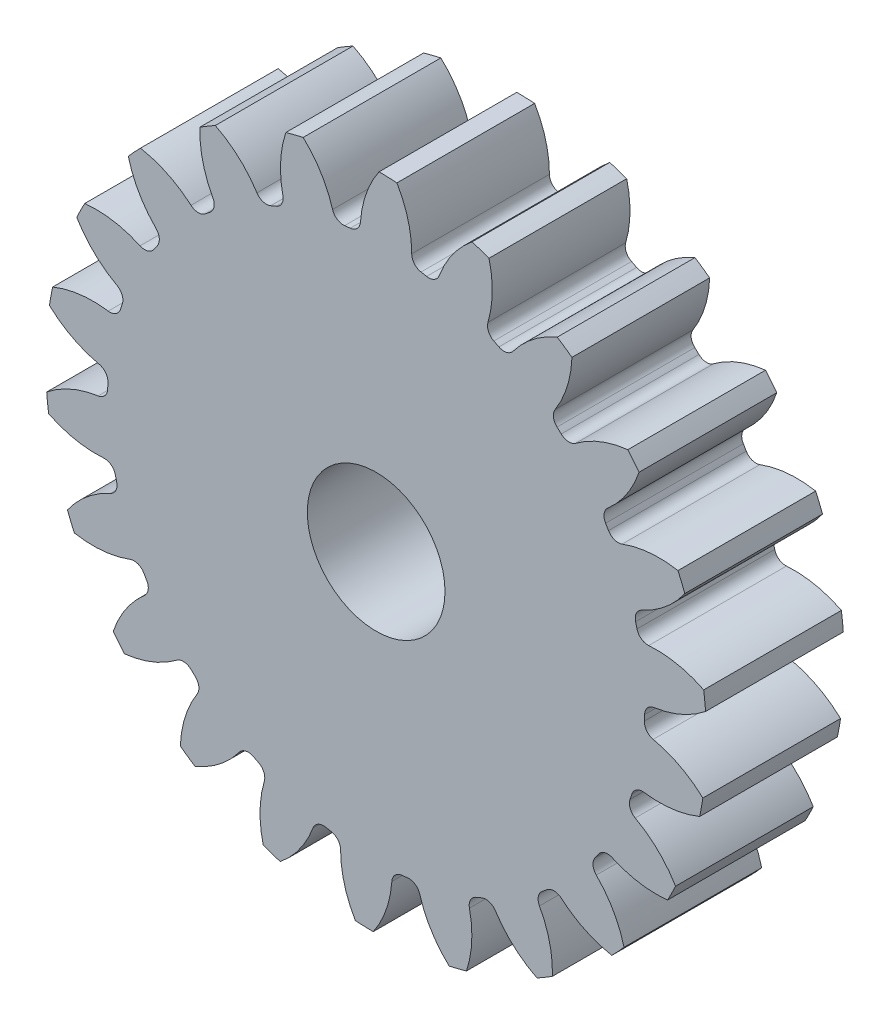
ISO-10303-21;
HEADER;
FILE_DESCRIPTION(('STEP AP214'),'2;1');
FILE_NAME('part.step','',(''),(''),'','','');
FILE_SCHEMA(('AUTOMOTIVE_DESIGN { 1 0 10303 214 1 1 1 1 }'));
ENDSEC;
DATA;
#1=APPLICATION_CONTEXT('core data for automotive mechanical design processes');
#2=APPLICATION_PROTOCOL_DEFINITION('international standard','automotive_design',2000,#1);
#3=PRODUCT_CONTEXT('',#1,'mechanical');
#4=PRODUCT('Part','Part','',(#3));
#5=PRODUCT_RELATED_PRODUCT_CATEGORY('part','',(#4));
#6=PRODUCT_DEFINITION_FORMATION('','',#4);
#7=PRODUCT_DEFINITION_CONTEXT('part definition',#1,'design');
#8=PRODUCT_DEFINITION('design','',#6,#7);
#9=PRODUCT_DEFINITION_SHAPE('','',#8);
#10=(LENGTH_UNIT() NAMED_UNIT(*) SI_UNIT(.MILLI.,.METRE.));
#11=(NAMED_UNIT(*) PLANE_ANGLE_UNIT() SI_UNIT($,.RADIAN.));
#12=(NAMED_UNIT(*) SI_UNIT($,.STERADIAN.) SOLID_ANGLE_UNIT());
#13=UNCERTAINTY_MEASURE_WITH_UNIT(LENGTH_MEASURE(1.E-05),#10,'distance_accuracy_value','');
#14=(GEOMETRIC_REPRESENTATION_CONTEXT(3) GLOBAL_UNCERTAINTY_ASSIGNED_CONTEXT((#13)) GLOBAL_UNIT_ASSIGNED_CONTEXT((#10,
#11,#12)) REPRESENTATION_CONTEXT('',''));
#15=CARTESIAN_POINT('',(0.,0.,0.));
#16=DIRECTION('',(0.,0.,1.));
#17=DIRECTION('',(1.,0.,0.));
#18=AXIS2_PLACEMENT_3D('',#15,#16,#17);
#19=CARTESIAN_POINT('',(0.,0.,101.6));
#20=DIRECTION('',(0.,0.,-1.));
#21=DIRECTION('',(-1.,0.,0.));
#22=AXIS2_PLACEMENT_3D('',#19,#20,#21);
#23=CYLINDRICAL_SURFACE('',#22,243.84);
#24=DIRECTION('',(0.,0.,-1.));
#25=VECTOR('',#24,1.);
#26=CARTESIAN_POINT('',(241.654152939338,32.5763099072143,50.8));
#27=LINE('',#26,#25);
#28=CARTESIAN_POINT('',(241.654152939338,32.5763099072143,101.6));
#29=VERTEX_POINT('',#28);
#30=CARTESIAN_POINT('',(241.654152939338,32.5763099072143,0.));
#31=VERTEX_POINT('',#30);
#32=EDGE_CURVE('E888',#29,#31,#27,.T.);
#33=ORIENTED_EDGE('',*,*,#32,.F.);
#34=CARTESIAN_POINT('',(0.,0.,101.6));
#35=DIRECTION('',(0.,0.,1.));
#36=DIRECTION('',(1.,0.,0.));
#37=AXIS2_PLACEMENT_3D('',#34,#35,#36);
#38=CIRCLE('',#37,243.84);
#39=CARTESIAN_POINT('',(243.062249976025,19.4599135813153,101.6));
#40=VERTEX_POINT('',#39);
#41=EDGE_CURVE('E1685',#40,#29,#38,.T.);
#42=ORIENTED_EDGE('',*,*,#41,.F.);
#43=DIRECTION('',(0.,0.,-1.));
#44=VECTOR('',#43,1.);
#45=CARTESIAN_POINT('',(243.062249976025,19.4599135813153,50.8));
#46=LINE('',#45,#44);
#47=CARTESIAN_POINT('',(243.062249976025,19.4599135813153,0.));
#48=VERTEX_POINT('',#47);
#49=EDGE_CURVE('E1679',#48,#40,#46,.F.);
#50=ORIENTED_EDGE('',*,*,#49,.F.);
#51=CARTESIAN_POINT('',(0.,0.,0.));
#52=DIRECTION('',(0.,0.,1.));
#53=DIRECTION('',(1.,0.,0.));
#54=AXIS2_PLACEMENT_3D('',#51,#52,#53);
#55=CIRCLE('',#54,243.84);
#56=EDGE_CURVE('E1690',#48,#31,#55,.T.);
#57=ORIENTED_EDGE('',*,*,#56,.T.);
#58=EDGE_LOOP('',(#33,#42,#50,#57));
#59=FACE_BOUND('',#58,.T.);
#60=ADVANCED_FACE('F33',(#59),#23,.T.);
#61=DIRECTION('',(0.,0.,-1.));
#62=VECTOR('',#61,1.);
#63=CARTESIAN_POINT('',(227.734029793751,87.1501995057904,50.8));
#64=LINE('',#63,#62);
#65=CARTESIAN_POINT('',(227.734029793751,87.1501995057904,0.));
#66=VERTEX_POINT('',#65);
#67=CARTESIAN_POINT('',(227.734029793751,87.1501995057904,101.6));
#68=VERTEX_POINT('',#67);
#69=EDGE_CURVE('E859',#66,#68,#64,.F.);
#70=ORIENTED_EDGE('',*,*,#69,.F.);
#71=CARTESIAN_POINT('',(222.68765470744,99.3385828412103,0.));
#72=VERTEX_POINT('',#71);
#73=EDGE_CURVE('E1693',#66,#72,#55,.T.);
#74=ORIENTED_EDGE('',*,*,#73,.T.);
#75=DIRECTION('',(0.,0.,-1.));
#76=VECTOR('',#75,1.);
#77=CARTESIAN_POINT('',(222.68765470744,99.3385828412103,50.8));
#78=LINE('',#77,#76);
#79=CARTESIAN_POINT('',(222.68765470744,99.3385828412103,101.6));
#80=VERTEX_POINT('',#79);
#81=EDGE_CURVE('E921',#80,#72,#78,.T.);
#82=ORIENTED_EDGE('',*,*,#81,.F.);
#83=EDGE_CURVE('E1688',#68,#80,#38,.T.);
#84=ORIENTED_EDGE('',*,*,#83,.F.);
#85=EDGE_LOOP('',(#70,#74,#82,#84));
#86=FACE_BOUND('',#85,.T.);
#87=ADVANCED_FACE('F1941',(#86),#23,.T.);
#88=CARTESIAN_POINT('',(0.,0.,101.6));
#89=DIRECTION('',(0.,0.,1.));
#90=DIRECTION('',(1.,0.,0.));
#91=AXIS2_PLACEMENT_3D('',#88,#89,#90);
#92=PLANE('',#91);
#93=CARTESIAN_POINT('',(0.,0.,101.599999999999));
#94=DIRECTION('',(0.,0.,1.));
#95=DIRECTION('',(1.,0.,0.));
#96=AXIS2_PLACEMENT_3D('',#93,#94,#95);
#97=CIRCLE('',#96,50.8);
#98=CARTESIAN_POINT('',(50.8,0.,101.599999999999));
#99=VERTEX_POINT('',#98);
#100=EDGE_CURVE('E876',#99,#99,#97,.T.);
#101=ORIENTED_EDGE('',*,*,#100,.F.);
#102=EDGE_LOOP('',(#101));
#103=FACE_BOUND('',#102,.T.);
#104=ORIENTED_EDGE('',*,*,#41,.T.);
#105=CARTESIAN_POINT('',(206.691211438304,-37.3575220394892,101.6));
#106=DIRECTION('',(0.,0.,-1.));
#107=DIRECTION('',(0.959492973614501,0.281732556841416,0.));
#108=AXIS2_PLACEMENT_3D('',#105,#106,#107);
#109=CIRCLE('',#108,78.1866237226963);
#110=CARTESIAN_POINT('',(201.109263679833,40.6295922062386,101.6));
#111=VERTEX_POINT('',#110);
#112=EDGE_CURVE('E868',#111,#29,#109,.T.);
#113=ORIENTED_EDGE('',*,*,#112,.F.);
#114=CARTESIAN_POINT('',(200.518829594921,48.8787289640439,101.6));
#115=DIRECTION('',(0.,0.,1.));
#116=DIRECTION('',(-0.959492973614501,-0.281732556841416,0.));
#117=AXIS2_PLACEMENT_3D('',#114,#115,#116);
#118=CIRCLE('',#117,8.27024000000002);
#119=CARTESIAN_POINT('',(192.483862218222,46.9201149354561,101.6));
#120=VERTEX_POINT('',#119);
#121=EDGE_CURVE('E866',#120,#111,#118,.T.);
#122=ORIENTED_EDGE('',*,*,#121,.F.);
#123=CARTESIAN_POINT('',(0.,0.,101.6));
#124=DIRECTION('',(0.,0.,-1.));
#125=DIRECTION('',(0.959492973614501,0.281732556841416,0.));
#126=AXIS2_PLACEMENT_3D('',#123,#124,#125);
#127=CIRCLE('',#126,198.12);
#128=CARTESIAN_POINT('',(191.441319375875,51.0074076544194,101.6));
#129=VERTEX_POINT('',#128);
#130=EDGE_CURVE('E851',#129,#120,#127,.T.);
#131=ORIENTED_EDGE('',*,*,#130,.F.);
#132=CARTESIAN_POINT('',(199.432767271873,53.1366399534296,101.6));
#133=DIRECTION('',(0.,0.,1.));
#134=DIRECTION('',(-0.959492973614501,-0.281732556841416,0.));
#135=AXIS2_PLACEMENT_3D('',#132,#133,#134);
#136=CIRCLE('',#135,8.27024000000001);
#137=CARTESIAN_POINT('',(195.999926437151,60.6607660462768,101.6));
#138=VERTEX_POINT('',#137);
#139=EDGE_CURVE('E843',#138,#129,#136,.T.);
#140=ORIENTED_EDGE('',*,*,#139,.F.);
#141=CARTESIAN_POINT('',(163.545942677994,131.79364921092,101.6));
#142=DIRECTION('',(0.,0.,-1.));
#143=DIRECTION('',(-0.959492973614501,-0.281732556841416,0.));
#144=AXIS2_PLACEMENT_3D('',#141,#142,#143);
#145=CIRCLE('',#144,78.1866237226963);
#146=EDGE_CURVE('E873',#68,#138,#145,.T.);
#147=ORIENTED_EDGE('',*,*,#146,.F.);
#148=ORIENTED_EDGE('',*,*,#83,.T.);
#149=CARTESIAN_POINT('',(208.843595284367,22.3873635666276,101.6));
#150=DIRECTION('',(0.,0.,-1.));
#151=DIRECTION('',(0.841253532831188,0.540640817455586,0.));
#152=AXIS2_PLACEMENT_3D('',#149,#150,#151);
#153=CIRCLE('',#152,78.1866237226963);
#154=CARTESIAN_POINT('',(181.516246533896,95.642835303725,101.6));
#155=VERTEX_POINT('',#154);
#156=EDGE_CURVE('E897',#155,#80,#153,.T.);
#157=ORIENTED_EDGE('',*,*,#156,.F.);
#158=CARTESIAN_POINT('',(178.62567878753,103.391479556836,101.6));
#159=DIRECTION('',(0.,0.,1.));
#160=DIRECTION('',(-0.841253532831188,-0.540640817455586,0.));
#161=AXIS2_PLACEMENT_3D('',#158,#159,#160);
#162=CIRCLE('',#161,8.27024000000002);
#163=CARTESIAN_POINT('',(171.467989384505,99.2484912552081,101.6));
#164=VERTEX_POINT('',#163);
#165=EDGE_CURVE('E895',#164,#155,#162,.T.);
#166=ORIENTED_EDGE('',*,*,#165,.F.);
#167=CARTESIAN_POINT('',(0.,0.,101.6));
#168=DIRECTION('',(0.,0.,-1.));
#169=DIRECTION('',(0.841253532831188,0.540640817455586,0.));
#170=AXIS2_PLACEMENT_3D('',#167,#168,#169);
#171=CIRCLE('',#170,198.12);
#172=CARTESIAN_POINT('',(169.316153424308,102.876501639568,101.6));
#173=VERTEX_POINT('',#172);
#174=EDGE_CURVE('E892',#173,#164,#171,.T.);
#175=ORIENTED_EDGE('',*,*,#174,.F.);
#176=CARTESIAN_POINT('',(176.384017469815,107.170936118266,101.6));
#177=DIRECTION('',(0.,0.,1.));
#178=DIRECTION('',(-0.841253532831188,-0.540640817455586,0.));
#179=AXIS2_PLACEMENT_3D('',#176,#177,#178);
#180=CIRCLE('',#179,8.27024000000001);
#181=CARTESIAN_POINT('',(170.970439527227,113.423139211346,101.6));
#182=VERTEX_POINT('',#181);
#183=EDGE_CURVE('E890',#182,#173,#180,.T.);
#184=ORIENTED_EDGE('',*,*,#183,.F.);
#185=CARTESIAN_POINT('',(119.790621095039,172.531296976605,101.6));
#186=DIRECTION('',(0.,0.,-1.));
#187=DIRECTION('',(-0.841253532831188,-0.540640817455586,0.));
#188=AXIS2_PLACEMENT_3D('',#185,#186,#187);
#189=CIRCLE('',#188,78.1866237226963);
#190=CARTESIAN_POINT('',(193.956152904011,147.780094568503,101.6));
#191=VERTEX_POINT('',#190);
#192=EDGE_CURVE('E900',#191,#182,#189,.T.);
#193=ORIENTED_EDGE('',*,*,#192,.F.);
#194=CARTESIAN_POINT('',(185.680327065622,158.053034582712,101.6));
#195=VERTEX_POINT('',#194);
#196=EDGE_CURVE('E1745',#191,#195,#38,.T.);
#197=ORIENTED_EDGE('',*,*,#196,.T.);
#198=CARTESIAN_POINT('',(194.076713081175,80.3185581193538,101.6));
#199=DIRECTION('',(0.,0.,-1.));
#200=DIRECTION('',(0.654860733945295,0.75574957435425,0.));
#201=AXIS2_PLACEMENT_3D('',#198,#199,#200);
#202=CIRCLE('',#201,78.1866237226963);
#203=CARTESIAN_POINT('',(147.217862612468,142.907664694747,101.6));
#204=VERTEX_POINT('',#203);
#205=EDGE_CURVE('E932',#204,#195,#202,.T.);
#206=ORIENTED_EDGE('',*,*,#205,.F.);
#207=CARTESIAN_POINT('',(142.26133781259,149.528067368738,101.6));
#208=DIRECTION('',(0.,0.,1.));
#209=DIRECTION('',(-0.654860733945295,-0.75574957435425,0.));
#210=AXIS2_PLACEMENT_3D('',#207,#208,#209);
#211=CIRCLE('',#210,8.27024000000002);
#212=CARTESIAN_POINT('',(136.560799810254,143.536345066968,101.6));
#213=VERTEX_POINT('',#212);
#214=EDGE_CURVE('E930',#213,#204,#211,.T.);
#215=ORIENTED_EDGE('',*,*,#214,.F.);
#216=CARTESIAN_POINT('',(0.,0.,101.6));
#217=DIRECTION('',(0.,0.,-1.));
#218=DIRECTION('',(0.654860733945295,0.75574957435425,0.));
#219=AXIS2_PLACEMENT_3D('',#216,#217,#218);
#220=CIRCLE('',#219,198.12);
#221=CARTESIAN_POINT('',(133.473999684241,146.411153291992,101.6));
#222=VERTEX_POINT('',#221);
#223=EDGE_CURVE('E927',#222,#213,#220,.T.);
#224=ORIENTED_EDGE('',*,*,#223,.F.);
#225=CARTESIAN_POINT('',(139.045683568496,152.522880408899,101.6));
#226=DIRECTION('',(0.,0.,1.));
#227=DIRECTION('',(-0.654860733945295,-0.75574957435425,0.));
#228=AXIS2_PLACEMENT_3D('',#225,#226,#227);
#229=CIRCLE('',#228,8.27024000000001);
#230=CARTESIAN_POINT('',(132.089944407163,156.996644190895,101.6));
#231=VERTEX_POINT('',#230);
#232=EDGE_CURVE('E925',#231,#222,#229,.T.);
#233=ORIENTED_EDGE('',*,*,#232,.F.);
#234=CARTESIAN_POINT('',(66.3305758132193,199.291485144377,101.6));
#235=DIRECTION('',(0.,0.,-1.));
#236=DIRECTION('',(-0.654860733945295,-0.75574957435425,0.));
#237=AXIS2_PLACEMENT_3D('',#234,#235,#236);
#238=CIRCLE('',#237,78.1866237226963);
#239=CARTESIAN_POINT('',(144.465102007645,196.437725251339,101.6));
#240=VERTEX_POINT('',#239);
#241=EDGE_CURVE('E935',#240,#231,#238,.T.);
#242=ORIENTED_EDGE('',*,*,#241,.F.);
#243=CARTESIAN_POINT('',(133.630283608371,203.962969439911,101.6));
#244=VERTEX_POINT('',#243);
#245=EDGE_CURVE('E1923',#240,#244,#38,.T.);
#246=ORIENTED_EDGE('',*,*,#245,.T.);
#247=CARTESIAN_POINT('',(163.586889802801,131.742820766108,101.6));
#248=DIRECTION('',(0.,0.,-1.));
#249=DIRECTION('',(0.415415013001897,0.909631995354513,0.));
#250=AXIS2_PLACEMENT_3D('',#247,#248,#249);
#251=CIRCLE('',#250,78.1866237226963);
#252=CARTESIAN_POINT('',(100.992763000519,178.594964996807,101.6));
#253=VERTEX_POINT('',#252);
#254=EDGE_CURVE('E970',#253,#244,#251,.T.);
#255=ORIENTED_EDGE('',*,*,#254,.F.);
#256=CARTESIAN_POINT('',(94.371829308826,183.550780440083,101.6));
#257=DIRECTION('',(0.,0.,1.));
#258=DIRECTION('',(-0.415415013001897,-0.909631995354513,0.));
#259=AXIS2_PLACEMENT_3D('',#256,#257,#258);
#260=CIRCLE('',#259,8.27024000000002);
#261=CARTESIAN_POINT('',(90.590266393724,176.195737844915,101.6));
#262=VERTEX_POINT('',#261);
#263=EDGE_CURVE('E968',#262,#253,#260,.T.);
#264=ORIENTED_EDGE('',*,*,#263,.F.);
#265=CARTESIAN_POINT('',(0.,0.,101.6));
#266=DIRECTION('',(0.,0.,-1.));
#267=DIRECTION('',(0.415415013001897,0.909631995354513,0.));
#268=AXIS2_PLACEMENT_3D('',#265,#266,#267);
#269=CIRCLE('',#268,198.12);
#270=CARTESIAN_POINT('',(86.8185762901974,178.084444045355,101.6));
#271=VERTEX_POINT('',#270);
#272=EDGE_CURVE('E965',#271,#262,#269,.T.);
#273=ORIENTED_EDGE('',*,*,#272,.F.);
#274=CARTESIAN_POINT('',(90.4426953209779,185.5183280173,101.6));
#275=DIRECTION('',(0.,0.,1.));
#276=DIRECTION('',(-0.415415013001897,-0.909631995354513,0.));
#277=AXIS2_PLACEMENT_3D('',#274,#275,#276);
#278=CIRCLE('',#277,8.27024000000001);
#279=CARTESIAN_POINT('',(82.5083075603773,187.851214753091,101.6));
#280=VERTEX_POINT('',#279);
#281=EDGE_CURVE('E963',#280,#271,#278,.T.);
#282=ORIENTED_EDGE('',*,*,#281,.F.);
#283=CARTESIAN_POINT('',(7.4968217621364,209.90626241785,101.6));
#284=DIRECTION('',(0.,0.,-1.));
#285=DIRECTION('',(-0.415415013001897,-0.909631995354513,0.));
#286=AXIS2_PLACEMENT_3D('',#283,#284,#285);
#287=CIRCLE('',#286,78.1866237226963);
#288=CARTESIAN_POINT('',(83.2703477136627,229.181139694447,101.6));
#289=VERTEX_POINT('',#288);
#290=EDGE_CURVE('E973',#289,#280,#287,.T.);
#291=ORIENTED_EDGE('',*,*,#290,.F.);
#292=CARTESIAN_POINT('',(70.7543093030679,233.349037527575,101.6));
#293=VERTEX_POINT('',#292);
#294=EDGE_CURVE('E1919',#289,#293,#38,.T.);
#295=ORIENTED_EDGE('',*,*,#294,.T.);
#296=CARTESIAN_POINT('',(119.844229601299,172.494063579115,101.6));
#297=DIRECTION('',(0.,0.,-1.));
#298=DIRECTION('',(0.142314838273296,0.989821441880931,0.));
#299=AXIS2_PLACEMENT_3D('',#296,#297,#298);
#300=CIRCLE('',#299,78.1866237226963);
#301=CARTESIAN_POINT('',(46.5858303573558,199.81356337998,101.6));
#302=VERTEX_POINT('',#301);
#303=EDGE_CURVE('E1008',#302,#293,#300,.T.);
#304=ORIENTED_EDGE('',*,*,#303,.F.);
#305=CARTESIAN_POINT('',(38.8368764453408,202.703300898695,101.6));
#306=DIRECTION('',(0.,0.,1.));
#307=DIRECTION('',(-0.142314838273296,-0.989821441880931,0.));
#308=AXIS2_PLACEMENT_3D('',#305,#306,#307);
#309=CIRCLE('',#308,8.27024000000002);
#310=CARTESIAN_POINT('',(37.2806483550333,194.580799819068,101.6));
#311=VERTEX_POINT('',#310);
#312=EDGE_CURVE('E1006',#311,#302,#309,.T.);
#313=ORIENTED_EDGE('',*,*,#312,.F.);
#314=CARTESIAN_POINT('',(0.,0.,101.6));
#315=DIRECTION('',(0.,0.,-1.));
#316=DIRECTION('',(0.142314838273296,0.989821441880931,0.));
#317=AXIS2_PLACEMENT_3D('',#314,#315,#316);
#318=CIRCLE('',#317,198.12);
#319=CARTESIAN_POINT('',(33.1296281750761,195.330392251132,101.6));
#320=VERTEX_POINT('',#319);
#321=EDGE_CURVE('E1003',#320,#311,#318,.T.);
#322=ORIENTED_EDGE('',*,*,#321,.F.);
#323=CARTESIAN_POINT('',(34.5125777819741,203.484184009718,101.6));
#324=DIRECTION('',(0.,0.,1.));
#325=DIRECTION('',(-0.142314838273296,-0.989821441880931,0.));
#326=AXIS2_PLACEMENT_3D('',#323,#324,#325);
#327=CIRCLE('',#326,8.27024000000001);
#328=CARTESIAN_POINT('',(26.242338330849,203.487197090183,101.6));
#329=VERTEX_POINT('',#328);
#330=EDGE_CURVE('E1001',#329,#320,#327,.T.);
#331=ORIENTED_EDGE('',*,*,#330,.F.);
#332=CARTESIAN_POINT('',(-51.9442802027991,203.515682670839,101.6));
#333=DIRECTION('',(0.,0.,-1.));
#334=DIRECTION('',(-0.142314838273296,-0.989821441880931,0.));
#335=AXIS2_PLACEMENT_3D('',#332,#333,#334);
#336=CIRCLE('',#335,78.1866237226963);
#337=CARTESIAN_POINT('',(15.3295250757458,243.35766119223,101.6));
#338=VERTEX_POINT('',#337);
#339=EDGE_CURVE('E1011',#338,#329,#336,.T.);
#340=ORIENTED_EDGE('',*,*,#339,.F.);
#341=CARTESIAN_POINT('',(2.14624165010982,243.830554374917,101.6));
#342=VERTEX_POINT('',#341);
#343=EDGE_CURVE('E1915',#338,#342,#38,.T.);
#344=ORIENTED_EDGE('',*,*,#343,.T.);
#345=CARTESIAN_POINT('',(66.3925026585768,199.270863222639,101.6));
#346=DIRECTION('',(0.,0.,-1.));
#347=DIRECTION('',(-0.142314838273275,0.989821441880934,0.));
#348=AXIS2_PLACEMENT_3D('',#345,#346,#347);
#349=CIRCLE('',#348,78.1866237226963);
#350=CARTESIAN_POINT('',(-11.5952092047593,204.844455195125,101.6));
#351=VERTEX_POINT('',#350);
#352=EDGE_CURVE('E1046',#351,#342,#349,.T.);
#353=ORIENTED_EDGE('',*,*,#352,.F.);
#354=CARTESIAN_POINT('',(-19.8444091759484,205.434005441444,101.6));
#355=DIRECTION('',(0.,0.,1.));
#356=DIRECTION('',(0.142314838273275,-0.989821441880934,0.));
#357=AXIS2_PLACEMENT_3D('',#354,#355,#356);
#358=CIRCLE('',#357,8.27024000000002);
#359=CARTESIAN_POINT('',(-19.0492260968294,197.202082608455,101.6));
#360=VERTEX_POINT('',#359);
#361=EDGE_CURVE('E1044',#360,#351,#358,.T.);
#362=ORIENTED_EDGE('',*,*,#361,.F.);
#363=CARTESIAN_POINT('',(0.,0.,101.6));
#364=DIRECTION('',(0.,0.,-1.));
#365=DIRECTION('',(-0.142314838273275,0.989821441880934,0.));
#366=AXIS2_PLACEMENT_3D('',#363,#364,#365);
#367=CIRCLE('',#366,198.12);
#368=CARTESIAN_POINT('',(-23.2432853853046,196.751833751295,101.6));
#369=VERTEX_POINT('',#368);
#370=EDGE_CURVE('E1041',#369,#360,#367,.T.);
#371=ORIENTED_EDGE('',*,*,#370,.F.);
#372=CARTESIAN_POINT('',(-24.213543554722,204.964961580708,101.6));
#373=DIRECTION('',(0.,0.,1.));
#374=DIRECTION('',(0.142314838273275,-0.989821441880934,0.));
#375=AXIS2_PLACEMENT_3D('',#372,#373,#374);
#376=CIRCLE('',#375,8.27024000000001);
#377=CARTESIAN_POINT('',(-32.1496290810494,202.637856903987,101.6));
#378=VERTEX_POINT('',#377);
#379=EDGE_CURVE('E1039',#378,#369,#376,.T.);
#380=ORIENTED_EDGE('',*,*,#379,.F.);
#381=CARTESIAN_POINT('',(-107.177165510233,180.637472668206,101.6));
#382=DIRECTION('',(0.,0.,-1.));
#383=DIRECTION('',(0.142314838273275,-0.989821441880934,0.));
#384=AXIS2_PLACEMENT_3D('',#381,#382,#383);
#385=CIRCLE('',#384,78.1866237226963);
#386=CARTESIAN_POINT('',(-53.8532045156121,237.818792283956,101.6));
#387=VERTEX_POINT('',#386);
#388=EDGE_CURVE('E1049',#387,#378,#385,.T.);
#389=ORIENTED_EDGE('',*,*,#388,.F.);
#390=CARTESIAN_POINT('',(-66.6357017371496,234.558369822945,101.6));
#391=VERTEX_POINT('',#390);
#392=EDGE_CURVE('E1911',#387,#391,#38,.T.);
#393=ORIENTED_EDGE('',*,*,#392,.T.);
#394=CARTESIAN_POINT('',(7.56205000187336,209.90392263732,101.6));
#395=DIRECTION('',(0.,0.,-1.));
#396=DIRECTION('',(-0.415415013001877,0.909631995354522,0.));
#397=AXIS2_PLACEMENT_3D('',#394,#395,#396);
#398=CIRCLE('',#397,78.1866237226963);
#399=CARTESIAN_POINT('',(-68.8368738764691,193.280067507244,101.6));
#400=VERTEX_POINT('',#399);
#401=EDGE_CURVE('E1084',#400,#391,#398,.T.);
#402=ORIENTED_EDGE('',*,*,#401,.F.);
#403=CARTESIAN_POINT('',(-76.9180187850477,191.5216686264,101.6));
#404=DIRECTION('',(0.,0.,1.));
#405=DIRECTION('',(0.415415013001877,-0.909631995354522,0.));
#406=AXIS2_PLACEMENT_3D('',#403,#404,#405);
#407=CIRCLE('',#406,8.27024000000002);
#408=CARTESIAN_POINT('',(-73.8358455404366,183.847225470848,101.6));
#409=VERTEX_POINT('',#408);
#410=EDGE_CURVE('E1082',#409,#400,#407,.T.);
#411=ORIENTED_EDGE('',*,*,#410,.F.);
#412=CARTESIAN_POINT('',(0.,0.,101.6));
#413=DIRECTION('',(0.,0.,-1.));
#414=DIRECTION('',(-0.415415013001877,0.909631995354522,0.));
#415=AXIS2_PLACEMENT_3D('',#412,#413,#414);
#416=CIRCLE('',#415,198.12);
#417=CARTESIAN_POINT('',(-77.7331661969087,182.233611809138,101.6));
#418=VERTEX_POINT('',#417);
#419=EDGE_CURVE('E1079',#418,#409,#416,.T.);
#420=ORIENTED_EDGE('',*,*,#419,.F.);
#421=CARTESIAN_POINT('',(-80.9780275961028,189.840696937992,101.6));
#422=DIRECTION('',(0.,0.,1.));
#423=DIRECTION('',(0.415415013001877,-0.909631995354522,0.));
#424=AXIS2_PLACEMENT_3D('',#421,#422,#423);
#425=CIRCLE('',#424,8.27024000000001);
#426=CARTESIAN_POINT('',(-87.9370247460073,185.372002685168,101.6));
#427=VERTEX_POINT('',#426);
#428=EDGE_CURVE('E1077',#427,#418,#425,.T.);
#429=ORIENTED_EDGE('',*,*,#428,.F.);
#430=CARTESIAN_POINT('',(-153.727194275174,143.125088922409,101.6));
#431=DIRECTION('',(0.,0.,-1.));
#432=DIRECTION('',(0.415415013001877,-0.909631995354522,0.));
#433=AXIS2_PLACEMENT_3D('',#430,#431,#432);
#434=CIRCLE('',#433,78.1866237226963);
#435=CARTESIAN_POINT('',(-118.673067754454,213.013259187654,101.6));
#436=VERTEX_POINT('',#435);
#437=EDGE_CURVE('E1087',#436,#427,#434,.T.);
#438=ORIENTED_EDGE('',*,*,#437,.F.);
#439=CARTESIAN_POINT('',(-130.019216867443,206.283661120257,101.6));
#440=VERTEX_POINT('',#439);
#441=EDGE_CURVE('E1907',#436,#440,#38,.T.);
#442=ORIENTED_EDGE('',*,*,#441,.T.);
#443=CARTESIAN_POINT('',(-51.8810349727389,203.53181458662,101.6));
#444=DIRECTION('',(0.,0.,-1.));
#445=DIRECTION('',(-0.654860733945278,0.755749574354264,0.));
#446=AXIS2_PLACEMENT_3D('',#443,#444,#445);
#447=CIRCLE('',#446,78.1866237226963);
#448=CARTESIAN_POINT('',(-120.50178441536,166.057278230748,101.6));
#449=VERTEX_POINT('',#448);
#450=EDGE_CURVE('E1122',#449,#440,#447,.T.);
#451=ORIENTED_EDGE('',*,*,#450,.F.);
#452=CARTESIAN_POINT('',(-127.760187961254,162.093385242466,101.6));
#453=DIRECTION('',(0.,0.,1.));
#454=DIRECTION('',(0.654860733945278,-0.755749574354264,0.));
#455=AXIS2_PLACEMENT_3D('',#452,#453,#454);
#456=CIRCLE('',#455,8.27024000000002);
#457=CARTESIAN_POINT('',(-122.640723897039,155.598159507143,101.6));
#458=VERTEX_POINT('',#457);
#459=EDGE_CURVE('E1120',#458,#449,#456,.T.);
#460=ORIENTED_EDGE('',*,*,#459,.F.);
#461=CARTESIAN_POINT('',(0.,0.,101.6));
#462=DIRECTION('',(0.,0.,-1.));
#463=DIRECTION('',(-0.654860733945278,0.755749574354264,0.));
#464=AXIS2_PLACEMENT_3D('',#461,#462,#463);
#465=CIRCLE('',#464,198.12);
#466=CARTESIAN_POINT('',(-125.925568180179,152.951906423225,101.6));
#467=VERTEX_POINT('',#466);
#468=EDGE_CURVE('E1117',#467,#458,#465,.T.);
#469=ORIENTED_EDGE('',*,*,#468,.F.);
#470=CARTESIAN_POINT('',(-131.182153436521,159.336668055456,101.6));
#471=DIRECTION('',(0.,0.,1.));
#472=DIRECTION('',(0.654860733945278,-0.755749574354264,0.));
#473=AXIS2_PLACEMENT_3D('',#470,#471,#472);
#474=CIRCLE('',#473,8.27024000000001);
#475=CARTESIAN_POINT('',(-136.600285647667,153.088411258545,101.6));
#476=VERTEX_POINT('',#475);
#477=EDGE_CURVE('E1115',#476,#467,#474,.T.);
#478=ORIENTED_EDGE('',*,*,#477,.F.);
#479=CARTESIAN_POINT('',(-187.823160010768,94.0175616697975,101.6));
#480=DIRECTION('',(0.,0.,-1.));
#481=DIRECTION('',(0.654860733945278,-0.755749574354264,0.));
#482=AXIS2_PLACEMENT_3D('',#479,#480,#481);
#483=CIRCLE('',#482,78.1866237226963);
#484=CARTESIAN_POINT('',(-173.87874481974,170.950658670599,101.6));
#485=VERTEX_POINT('',#484);
#486=EDGE_CURVE('E1125',#485,#476,#483,.T.);
#487=ORIENTED_EDGE('',*,*,#486,.F.);
#488=CARTESIAN_POINT('',(-182.869348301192,161.297077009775,101.6));
#489=VERTEX_POINT('',#488);
#490=EDGE_CURVE('E1903',#485,#489,#38,.T.);
#491=ORIENTED_EDGE('',*,*,#490,.T.);
#492=CARTESIAN_POINT('',(-107.121027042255,180.670769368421,101.6));
#493=DIRECTION('',(0.,0.,-1.));
#494=DIRECTION('',(-0.841253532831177,0.540640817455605,0.));
#495=AXIS2_PLACEMENT_3D('',#492,#493,#494);
#496=CIRCLE('',#495,78.1866237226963);
#497=CARTESIAN_POINT('',(-162.404357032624,125.381515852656,101.6));
#498=VERTEX_POINT('',#497);
#499=EDGE_CURVE('E1160',#498,#489,#496,.T.);
#500=ORIENTED_EDGE('',*,*,#499,.F.);
#501=CARTESIAN_POINT('',(-168.251986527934,119.533259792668,101.6));
#502=DIRECTION('',(0.,0.,1.));
#503=DIRECTION('',(0.841253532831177,-0.540640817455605,0.));
#504=AXIS2_PLACEMENT_3D('',#501,#502,#503);
#505=CIRCLE('',#504,8.27024000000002);
#506=CARTESIAN_POINT('',(-161.509980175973,114.743456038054,101.6));
#507=VERTEX_POINT('',#506);
#508=EDGE_CURVE('E1158',#507,#498,#505,.T.);
#509=ORIENTED_EDGE('',*,*,#508,.F.);
#510=CARTESIAN_POINT('',(0.,0.,101.6));
#511=DIRECTION('',(0.,0.,-1.));
#512=DIRECTION('',(-0.841253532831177,0.540640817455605,0.));
#513=AXIS2_PLACEMENT_3D('',#510,#511,#512);
#514=CIRCLE('',#513,198.12);
#515=CARTESIAN_POINT('',(-163.916229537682,111.278947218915,101.6));
#516=VERTEX_POINT('',#515);
#517=EDGE_CURVE('E1155',#516,#507,#514,.T.);
#518=ORIENTED_EDGE('',*,*,#517,.F.);
#519=CARTESIAN_POINT('',(-170.758681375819,115.92412993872,101.6));
#520=DIRECTION('',(0.,0.,1.));
#521=DIRECTION('',(0.841253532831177,-0.540640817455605,0.));
#522=AXIS2_PLACEMENT_3D('',#519,#520,#521);
#523=CIRCLE('',#522,8.27024000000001);
#524=CARTESIAN_POINT('',(-174.197003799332,108.402507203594,101.6));
#525=VERTEX_POINT('',#524);
#526=EDGE_CURVE('E1153',#525,#516,#523,.T.);
#527=ORIENTED_EDGE('',*,*,#526,.F.);
#528=CARTESIAN_POINT('',(-206.702810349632,37.2932907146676,101.6));
#529=DIRECTION('',(0.,0.,-1.));
#530=DIRECTION('',(0.841253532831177,-0.540640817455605,0.));
#531=AXIS2_PLACEMENT_3D('',#528,#529,#530);
#532=CIRCLE('',#531,78.1866237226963);
#533=CARTESIAN_POINT('',(-214.997800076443,115.038652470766,101.6));
#534=VERTEX_POINT('',#533);
#535=EDGE_CURVE('E1163',#534,#525,#532,.T.);
#536=ORIENTED_EDGE('',*,*,#535,.F.);
#537=CARTESIAN_POINT('',(-220.904492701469,103.243162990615,101.6));
#538=VERTEX_POINT('',#537);
#539=EDGE_CURVE('E1899',#534,#538,#38,.T.);
#540=ORIENTED_EDGE('',*,*,#539,.T.);
#541=CARTESIAN_POINT('',(-153.682710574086,143.172852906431,101.6));
#542=DIRECTION('',(0.,0.,-1.));
#543=DIRECTION('',(-0.959492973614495,0.281732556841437,0.));
#544=AXIS2_PLACEMENT_3D('',#541,#542,#543);
#545=CIRCLE('',#544,78.1866237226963);
#546=CARTESIAN_POINT('',(-191.149894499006,74.5480887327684,101.6));
#547=VERTEX_POINT('',#546);
#548=EDGE_CURVE('E1198',#547,#538,#545,.T.);
#549=ORIENTED_EDGE('',*,*,#548,.F.);
#550=CARTESIAN_POINT('',(-195.113009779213,67.289260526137,101.6));
#551=DIRECTION('',(0.,0.,1.));
#552=DIRECTION('',(0.959492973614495,-0.281732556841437,0.));
#553=AXIS2_PLACEMENT_3D('',#550,#551,#552);
#554=CIRCLE('',#553,8.27024000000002);
#555=CARTESIAN_POINT('',(-187.294658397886,64.5929201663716,101.6));
#556=VERTEX_POINT('',#555);
#557=EDGE_CURVE('E1196',#556,#547,#554,.T.);
#558=ORIENTED_EDGE('',*,*,#557,.F.);
#559=CARTESIAN_POINT('',(0.,0.,101.6));
#560=DIRECTION('',(0.,0.,-1.));
#561=DIRECTION('',(-0.959492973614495,0.281732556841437,0.));
#562=AXIS2_PLACEMENT_3D('',#559,#560,#561);
#563=CIRCLE('',#562,198.12);
#564=CARTESIAN_POINT('',(-188.627372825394,60.5908295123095,101.6));
#565=VERTEX_POINT('',#564);
#566=EDGE_CURVE('E1193',#565,#556,#563,.T.);
#567=ORIENTED_EDGE('',*,*,#566,.F.);
#568=CARTESIAN_POINT('',(-196.501356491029,63.1201082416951,101.6));
#569=DIRECTION('',(0.,0.,1.));
#570=DIRECTION('',(0.959492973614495,-0.281732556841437,0.));
#571=AXIS2_PLACEMENT_3D('',#568,#569,#570);
#572=CIRCLE('',#571,8.27024000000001);
#573=CARTESIAN_POINT('',(-197.681316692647,54.934476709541,101.6));
#574=VERTEX_POINT('',#573);
#575=EDGE_CURVE('E1191',#574,#565,#572,.T.);
#576=ORIENTED_EDGE('',*,*,#575,.F.);
#577=CARTESIAN_POINT('',(-208.836628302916,-22.4522608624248,101.6));
#578=DIRECTION('',(0.,0.,-1.));
#579=DIRECTION('',(0.959492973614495,-0.281732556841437,0.));
#580=AXIS2_PLACEMENT_3D('',#577,#578,#579);
#581=CIRCLE('',#580,78.1866237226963);
#582=CARTESIAN_POINT('',(-238.699012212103,49.8068988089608,101.6));
#583=VERTEX_POINT('',#582);
#584=EDGE_CURVE('E1201',#583,#574,#581,.T.);
#585=ORIENTED_EDGE('',*,*,#584,.F.);
#586=CARTESIAN_POINT('',(-241.043268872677,36.8251019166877,101.6));
#587=VERTEX_POINT('',#586);
#588=EDGE_CURVE('E1895',#583,#587,#38,.T.);
#589=ORIENTED_EDGE('',*,*,#588,.T.);
#590=CARTESIAN_POINT('',(-187.793934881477,94.0759233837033,101.6));
#591=DIRECTION('',(0.,0.,-1.));
#592=DIRECTION('',(-1.,0.,0.));
#593=AXIS2_PLACEMENT_3D('',#590,#591,#592);
#594=CIRCLE('',#593,78.1866237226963);
#595=CARTESIAN_POINT('',(-204.409604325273,17.6752188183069,101.6));
#596=VERTEX_POINT('',#595);
#597=EDGE_CURVE('E1236',#596,#587,#594,.T.);
#598=ORIENTED_EDGE('',*,*,#597,.F.);
#599=CARTESIAN_POINT('',(-206.167137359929,9.59388555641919,101.6));
#600=DIRECTION('',(0.,0.,1.));
#601=DIRECTION('',(1.,0.,0.));
#602=AXIS2_PLACEMENT_3D('',#599,#600,#601);
#603=CIRCLE('',#602,8.27024000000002);
#604=CARTESIAN_POINT('',(-197.905837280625,9.20945005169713,101.6));
#605=VERTEX_POINT('',#604);
#606=EDGE_CURVE('E1234',#605,#596,#603,.T.);
#607=ORIENTED_EDGE('',*,*,#606,.F.);
#608=CARTESIAN_POINT('',(0.,0.,101.6));
#609=DIRECTION('',(0.,0.,-1.));
#610=DIRECTION('',(-1.,0.,0.));
#611=AXIS2_PLACEMENT_3D('',#608,#609,#610);
#612=CIRCLE('',#611,198.12);
#613=CARTESIAN_POINT('',(-198.057048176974,4.99400314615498,101.6));
#614=VERTEX_POINT('',#613);
#615=EDGE_CURVE('E1231',#614,#605,#612,.T.);
#616=ORIENTED_EDGE('',*,*,#615,.F.);
#617=CARTESIAN_POINT('',(-206.3246603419,5.20247076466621,101.6));
#618=DIRECTION('',(0.,0.,1.));
#619=DIRECTION('',(1.,0.,0.));
#620=AXIS2_PLACEMENT_3D('',#617,#618,#619);
#621=CIRCLE('',#620,8.27024000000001);
#622=CARTESIAN_POINT('',(-205.150664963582,-2.9840183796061,101.6));
#623=VERTEX_POINT('',#622);
#624=EDGE_CURVE('E1229',#623,#614,#621,.T.);
#625=ORIENTED_EDGE('',*,*,#624,.F.);
#626=CARTESIAN_POINT('',(-194.051744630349,-80.3788637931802,101.6));
#627=DIRECTION('',(0.,0.,-1.));
#628=DIRECTION('',(1.,0.,0.));
#629=AXIS2_PLACEMENT_3D('',#626,#627,#628);
#630=CIRCLE('',#629,78.1866237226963);
#631=CARTESIAN_POINT('',(-243.062249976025,-19.4599135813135,101.6));
#632=VERTEX_POINT('',#631);
#633=EDGE_CURVE('E1239',#632,#623,#630,.T.);
#634=ORIENTED_EDGE('',*,*,#633,.F.);
#635=CARTESIAN_POINT('',(-241.654152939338,-32.5763099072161,101.6));
#636=VERTEX_POINT('',#635);
#637=EDGE_CURVE('E1891',#632,#636,#38,.T.);
#638=ORIENTED_EDGE('',*,*,#637,.T.);
#639=CARTESIAN_POINT('',(-206.691211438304,37.3575220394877,101.6));
#640=DIRECTION('',(0.,0.,-1.));
#641=DIRECTION('',(-0.959492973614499,-0.281732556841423,0.));
#642=AXIS2_PLACEMENT_3D('',#639,#640,#641);
#643=CIRCLE('',#642,78.1866237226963);
#644=CARTESIAN_POINT('',(-201.109263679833,-40.6295922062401,101.6));
#645=VERTEX_POINT('',#644);
#646=EDGE_CURVE('E1274',#645,#636,#643,.T.);
#647=ORIENTED_EDGE('',*,*,#646,.F.);
#648=CARTESIAN_POINT('',(-200.518829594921,-48.8787289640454,101.6));
#649=DIRECTION('',(0.,0.,1.));
#650=DIRECTION('',(0.959492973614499,0.281732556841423,0.));
#651=AXIS2_PLACEMENT_3D('',#648,#649,#650);
#652=CIRCLE('',#651,8.27024000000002);
#653=CARTESIAN_POINT('',(-192.483862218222,-46.9201149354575,101.6));
#654=VERTEX_POINT('',#653);
#655=EDGE_CURVE('E1272',#654,#645,#652,.T.);
#656=ORIENTED_EDGE('',*,*,#655,.F.);
#657=CARTESIAN_POINT('',(0.,0.,101.6));
#658=DIRECTION('',(0.,0.,-1.));
#659=DIRECTION('',(-0.959492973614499,-0.281732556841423,0.));
#660=AXIS2_PLACEMENT_3D('',#657,#658,#659);
#661=CIRCLE('',#660,198.12);
#662=CARTESIAN_POINT('',(-191.441319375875,-51.0074076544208,101.6));
#663=VERTEX_POINT('',#662);
#664=EDGE_CURVE('E1269',#663,#654,#661,.T.);
#665=ORIENTED_EDGE('',*,*,#664,.F.);
#666=CARTESIAN_POINT('',(-199.432767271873,-53.1366399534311,101.6));
#667=DIRECTION('',(0.,0.,1.));
#668=DIRECTION('',(0.959492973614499,0.281732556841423,0.));
#669=AXIS2_PLACEMENT_3D('',#666,#667,#668);
#670=CIRCLE('',#669,8.27024000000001);
#671=CARTESIAN_POINT('',(-195.999926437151,-60.6607660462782,101.6));
#672=VERTEX_POINT('',#671);
#673=EDGE_CURVE('E1267',#672,#663,#670,.T.);
#674=ORIENTED_EDGE('',*,*,#673,.F.);
#675=CARTESIAN_POINT('',(-163.545942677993,-131.793649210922,101.6));
#676=DIRECTION('',(0.,0.,-1.));
#677=DIRECTION('',(0.959492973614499,0.281732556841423,0.));
#678=AXIS2_PLACEMENT_3D('',#675,#676,#677);
#679=CIRCLE('',#678,78.1866237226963);
#680=CARTESIAN_POINT('',(-227.73402979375,-87.1501995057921,101.6));
#681=VERTEX_POINT('',#680);
#682=EDGE_CURVE('E1277',#681,#672,#679,.T.);
#683=ORIENTED_EDGE('',*,*,#682,.F.);
#684=CARTESIAN_POINT('',(-222.687654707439,-99.338582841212,101.6));
#685=VERTEX_POINT('',#684);
#686=EDGE_CURVE('E1887',#681,#685,#38,.T.);
#687=ORIENTED_EDGE('',*,*,#686,.T.);
#688=CARTESIAN_POINT('',(-208.843595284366,-22.3873635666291,101.6));
#689=DIRECTION('',(0.,0.,-1.));
#690=DIRECTION('',(-0.841253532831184,-0.540640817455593,0.));
#691=AXIS2_PLACEMENT_3D('',#688,#689,#690);
#692=CIRCLE('',#691,78.1866237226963);
#693=CARTESIAN_POINT('',(-181.516246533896,-95.6428353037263,101.6));
#694=VERTEX_POINT('',#693);
#695=EDGE_CURVE('E1312',#694,#685,#692,.T.);
#696=ORIENTED_EDGE('',*,*,#695,.F.);
#697=CARTESIAN_POINT('',(-178.62567878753,-103.391479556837,101.6));
#698=DIRECTION('',(0.,0.,1.));
#699=DIRECTION('',(0.841253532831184,0.540640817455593,0.));
#700=AXIS2_PLACEMENT_3D('',#697,#698,#699);
#701=CIRCLE('',#700,8.27024000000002);
#702=CARTESIAN_POINT('',(-171.467989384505,-99.2484912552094,101.6));
#703=VERTEX_POINT('',#702);
#704=EDGE_CURVE('E1310',#703,#694,#701,.T.);
#705=ORIENTED_EDGE('',*,*,#704,.F.);
#706=CARTESIAN_POINT('',(0.,0.,101.6));
#707=DIRECTION('',(0.,0.,-1.));
#708=DIRECTION('',(-0.841253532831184,-0.540640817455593,0.));
#709=AXIS2_PLACEMENT_3D('',#706,#707,#708);
#710=CIRCLE('',#709,198.12);
#711=CARTESIAN_POINT('',(-169.316153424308,-102.876501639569,101.6));
#712=VERTEX_POINT('',#711);
#713=EDGE_CURVE('E1307',#712,#703,#710,.T.);
#714=ORIENTED_EDGE('',*,*,#713,.F.);
#715=CARTESIAN_POINT('',(-176.384017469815,-107.170936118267,101.6));
#716=DIRECTION('',(0.,0.,1.));
#717=DIRECTION('',(0.841253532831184,0.540640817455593,0.));
#718=AXIS2_PLACEMENT_3D('',#715,#716,#717);
#719=CIRCLE('',#718,8.27024000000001);
#720=CARTESIAN_POINT('',(-170.970439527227,-113.423139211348,101.6));
#721=VERTEX_POINT('',#720);
#722=EDGE_CURVE('E1305',#721,#712,#719,.T.);
#723=ORIENTED_EDGE('',*,*,#722,.F.);
#724=CARTESIAN_POINT('',(-119.790621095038,-172.531296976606,101.6));
#725=DIRECTION('',(0.,0.,-1.));
#726=DIRECTION('',(0.841253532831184,0.540640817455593,0.));
#727=AXIS2_PLACEMENT_3D('',#724,#725,#726);
#728=CIRCLE('',#727,78.1866237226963);
#729=CARTESIAN_POINT('',(-193.95615290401,-147.780094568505,101.6));
#730=VERTEX_POINT('',#729);
#731=EDGE_CURVE('E1315',#730,#721,#728,.T.);
#732=ORIENTED_EDGE('',*,*,#731,.F.);
#733=CARTESIAN_POINT('',(-185.68032706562,-158.053034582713,101.6));
#734=VERTEX_POINT('',#733);
#735=EDGE_CURVE('E1883',#730,#734,#38,.T.);
#736=ORIENTED_EDGE('',*,*,#735,.T.);
#737=CARTESIAN_POINT('',(-194.076713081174,-80.3185581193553,101.6));
#738=DIRECTION('',(0.,0.,-1.));
#739=DIRECTION('',(-0.654860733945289,-0.755749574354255,0.));
#740=AXIS2_PLACEMENT_3D('',#737,#738,#739);
#741=CIRCLE('',#740,78.1866237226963);
#742=CARTESIAN_POINT('',(-147.217862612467,-142.907664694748,101.6));
#743=VERTEX_POINT('',#742);
#744=EDGE_CURVE('E1350',#743,#734,#741,.T.);
#745=ORIENTED_EDGE('',*,*,#744,.F.);
#746=CARTESIAN_POINT('',(-142.261337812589,-149.528067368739,101.6));
#747=DIRECTION('',(0.,0.,1.));
#748=DIRECTION('',(0.654860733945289,0.755749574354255,0.));
#749=AXIS2_PLACEMENT_3D('',#746,#747,#748);
#750=CIRCLE('',#749,8.27024000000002);
#751=CARTESIAN_POINT('',(-136.560799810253,-143.536345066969,101.6));
#752=VERTEX_POINT('',#751);
#753=EDGE_CURVE('E1348',#752,#743,#750,.T.);
#754=ORIENTED_EDGE('',*,*,#753,.F.);
#755=CARTESIAN_POINT('',(0.,0.,101.6));
#756=DIRECTION('',(0.,0.,-1.));
#757=DIRECTION('',(-0.654860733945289,-0.755749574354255,0.));
#758=AXIS2_PLACEMENT_3D('',#755,#756,#757);
#759=CIRCLE('',#758,198.12);
#760=CARTESIAN_POINT('',(-133.47399968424,-146.411153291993,101.6));
#761=VERTEX_POINT('',#760);
#762=EDGE_CURVE('E1345',#761,#752,#759,.T.);
#763=ORIENTED_EDGE('',*,*,#762,.F.);
#764=CARTESIAN_POINT('',(-139.045683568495,-152.5228804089,101.6));
#765=DIRECTION('',(0.,0.,1.));
#766=DIRECTION('',(0.654860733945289,0.755749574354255,0.));
#767=AXIS2_PLACEMENT_3D('',#764,#765,#766);
#768=CIRCLE('',#767,8.27024000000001);
#769=CARTESIAN_POINT('',(-132.089944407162,-156.996644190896,101.6));
#770=VERTEX_POINT('',#769);
#771=EDGE_CURVE('E1343',#770,#761,#768,.T.);
#772=ORIENTED_EDGE('',*,*,#771,.F.);
#773=CARTESIAN_POINT('',(-66.3305758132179,-199.291485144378,101.6));
#774=DIRECTION('',(0.,0.,-1.));
#775=DIRECTION('',(0.654860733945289,0.755749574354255,0.));
#776=AXIS2_PLACEMENT_3D('',#773,#774,#775);
#777=CIRCLE('',#776,78.1866237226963);
#778=CARTESIAN_POINT('',(-144.465102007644,-196.437725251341,101.6));
#779=VERTEX_POINT('',#778);
#780=EDGE_CURVE('E1353',#779,#770,#777,.T.);
#781=ORIENTED_EDGE('',*,*,#780,.F.);
#782=CARTESIAN_POINT('',(-133.63028360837,-203.962969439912,101.6));
#783=VERTEX_POINT('',#782);
#784=EDGE_CURVE('E1879',#779,#783,#38,.T.);
#785=ORIENTED_EDGE('',*,*,#784,.T.);
#786=CARTESIAN_POINT('',(-163.5868898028,-131.742820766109,101.6));
#787=DIRECTION('',(0.,0.,-1.));
#788=DIRECTION('',(-0.415415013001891,-0.909631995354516,0.));
#789=AXIS2_PLACEMENT_3D('',#786,#787,#788);
#790=CIRCLE('',#789,78.1866237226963);
#791=CARTESIAN_POINT('',(-100.992763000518,-178.594964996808,101.6));
#792=VERTEX_POINT('',#791);
#793=EDGE_CURVE('E1388',#792,#783,#790,.T.);
#794=ORIENTED_EDGE('',*,*,#793,.F.);
#795=CARTESIAN_POINT('',(-94.3718293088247,-183.550780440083,101.6));
#796=DIRECTION('',(0.,0.,1.));
#797=DIRECTION('',(0.415415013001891,0.909631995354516,0.));
#798=AXIS2_PLACEMENT_3D('',#795,#796,#797);
#799=CIRCLE('',#798,8.27024000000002);
#800=CARTESIAN_POINT('',(-90.5902663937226,-176.195737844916,101.6));
#801=VERTEX_POINT('',#800);
#802=EDGE_CURVE('E1386',#801,#792,#799,.T.);
#803=ORIENTED_EDGE('',*,*,#802,.F.);
#804=CARTESIAN_POINT('',(0.,0.,101.6));
#805=DIRECTION('',(0.,0.,-1.));
#806=DIRECTION('',(-0.415415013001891,-0.909631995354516,0.));
#807=AXIS2_PLACEMENT_3D('',#804,#805,#806);
#808=CIRCLE('',#807,198.12);
#809=CARTESIAN_POINT('',(-86.8185762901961,-178.084444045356,101.6));
#810=VERTEX_POINT('',#809);
#811=EDGE_CURVE('E1383',#810,#801,#808,.T.);
#812=ORIENTED_EDGE('',*,*,#811,.F.);
#813=CARTESIAN_POINT('',(-90.4426953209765,-185.5183280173,101.6));
#814=DIRECTION('',(0.,0.,1.));
#815=DIRECTION('',(0.415415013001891,0.909631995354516,0.));
#816=AXIS2_PLACEMENT_3D('',#813,#814,#815);
#817=CIRCLE('',#816,8.27024000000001);
#818=CARTESIAN_POINT('',(-82.5083075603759,-187.851214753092,101.6));
#819=VERTEX_POINT('',#818);
#820=EDGE_CURVE('E1381',#819,#810,#817,.T.);
#821=ORIENTED_EDGE('',*,*,#820,.F.);
#822=CARTESIAN_POINT('',(-7.49682176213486,-209.90626241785,101.6));
#823=DIRECTION('',(0.,0.,-1.));
#824=DIRECTION('',(0.415415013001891,0.909631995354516,0.));
#825=AXIS2_PLACEMENT_3D('',#822,#823,#824);
#826=CIRCLE('',#825,78.1866237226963);
#827=CARTESIAN_POINT('',(-83.270347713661,-229.181139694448,101.6));
#828=VERTEX_POINT('',#827);
#829=EDGE_CURVE('E1391',#828,#819,#826,.T.);
#830=ORIENTED_EDGE('',*,*,#829,.F.);
#831=CARTESIAN_POINT('',(-70.7543093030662,-233.349037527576,101.6));
#832=VERTEX_POINT('',#831);
#833=EDGE_CURVE('E1875',#828,#832,#38,.T.);
#834=ORIENTED_EDGE('',*,*,#833,.T.);
#835=CARTESIAN_POINT('',(-119.844229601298,-172.494063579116,101.6));
#836=DIRECTION('',(0.,0.,-1.));
#837=DIRECTION('',(-0.142314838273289,-0.989821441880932,0.));
#838=AXIS2_PLACEMENT_3D('',#835,#836,#837);
#839=CIRCLE('',#838,78.1866237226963);
#840=CARTESIAN_POINT('',(-46.5858303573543,-199.813563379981,101.6));
#841=VERTEX_POINT('',#840);
#842=EDGE_CURVE('E1426',#841,#832,#839,.T.);
#843=ORIENTED_EDGE('',*,*,#842,.F.);
#844=CARTESIAN_POINT('',(-38.8368764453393,-202.703300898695,101.6));
#845=DIRECTION('',(0.,0.,1.));
#846=DIRECTION('',(0.142314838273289,0.989821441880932,0.));
#847=AXIS2_PLACEMENT_3D('',#844,#845,#846);
#848=CIRCLE('',#847,8.27024000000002);
#849=CARTESIAN_POINT('',(-37.2806483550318,-194.580799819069,101.6));
#850=VERTEX_POINT('',#849);
#851=EDGE_CURVE('E1424',#850,#841,#848,.T.);
#852=ORIENTED_EDGE('',*,*,#851,.F.);
#853=CARTESIAN_POINT('',(0.,0.,101.6));
#854=DIRECTION('',(0.,0.,-1.));
#855=DIRECTION('',(-0.142314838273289,-0.989821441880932,0.));
#856=AXIS2_PLACEMENT_3D('',#853,#854,#855);
#857=CIRCLE('',#856,198.12);
#858=CARTESIAN_POINT('',(-33.1296281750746,-195.330392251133,101.6));
#859=VERTEX_POINT('',#858);
#860=EDGE_CURVE('E1421',#859,#850,#857,.T.);
#861=ORIENTED_EDGE('',*,*,#860,.F.);
#862=CARTESIAN_POINT('',(-34.5125777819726,-203.484184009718,101.6));
#863=DIRECTION('',(0.,0.,1.));
#864=DIRECTION('',(0.142314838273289,0.989821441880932,0.));
#865=AXIS2_PLACEMENT_3D('',#862,#863,#864);
#866=CIRCLE('',#865,8.27024000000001);
#867=CARTESIAN_POINT('',(-26.2423383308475,-203.487197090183,101.6));
#868=VERTEX_POINT('',#867);
#869=EDGE_CURVE('E1419',#868,#859,#866,.T.);
#870=ORIENTED_EDGE('',*,*,#869,.F.);
#871=CARTESIAN_POINT('',(51.9442802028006,-203.515682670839,101.6));
#872=DIRECTION('',(0.,0.,-1.));
#873=DIRECTION('',(0.142314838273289,0.989821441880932,0.));
#874=AXIS2_PLACEMENT_3D('',#871,#872,#873);
#875=CIRCLE('',#874,78.1866237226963);
#876=CARTESIAN_POINT('',(-15.329525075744,-243.35766119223,101.6));
#877=VERTEX_POINT('',#876);
#878=EDGE_CURVE('E1429',#877,#868,#875,.T.);
#879=ORIENTED_EDGE('',*,*,#878,.F.);
#880=CARTESIAN_POINT('',(-2.14624165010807,-243.830554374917,101.6));
#881=VERTEX_POINT('',#880);
#882=EDGE_CURVE('E1871',#877,#881,#38,.T.);
#883=ORIENTED_EDGE('',*,*,#882,.T.);
#884=CARTESIAN_POINT('',(-66.3925026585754,-199.270863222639,101.6));
#885=DIRECTION('',(0.,0.,-1.));
#886=DIRECTION('',(0.142314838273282,-0.989821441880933,0.));
#887=AXIS2_PLACEMENT_3D('',#884,#885,#886);
#888=CIRCLE('',#887,78.1866237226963);
#889=CARTESIAN_POINT('',(11.5952092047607,-204.844455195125,101.6));
#890=VERTEX_POINT('',#889);
#891=EDGE_CURVE('E1464',#890,#881,#888,.T.);
#892=ORIENTED_EDGE('',*,*,#891,.F.);
#893=CARTESIAN_POINT('',(19.8444091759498,-205.434005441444,101.6));
#894=DIRECTION('',(0.,0.,1.));
#895=DIRECTION('',(-0.142314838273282,0.989821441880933,0.));
#896=AXIS2_PLACEMENT_3D('',#893,#894,#895);
#897=CIRCLE('',#896,8.27024000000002);
#898=CARTESIAN_POINT('',(19.0492260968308,-197.202082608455,101.6));
#899=VERTEX_POINT('',#898);
#900=EDGE_CURVE('E1462',#899,#890,#897,.T.);
#901=ORIENTED_EDGE('',*,*,#900,.F.);
#902=CARTESIAN_POINT('',(0.,0.,101.6));
#903=DIRECTION('',(0.,0.,-1.));
#904=DIRECTION('',(0.142314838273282,-0.989821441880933,0.));
#905=AXIS2_PLACEMENT_3D('',#902,#903,#904);
#906=CIRCLE('',#905,198.12);
#907=CARTESIAN_POINT('',(23.2432853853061,-196.751833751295,101.6));
#908=VERTEX_POINT('',#907);
#909=EDGE_CURVE('E1459',#908,#899,#906,.T.);
#910=ORIENTED_EDGE('',*,*,#909,.F.);
#911=CARTESIAN_POINT('',(24.2135435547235,-204.964961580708,101.6));
#912=DIRECTION('',(0.,0.,1.));
#913=DIRECTION('',(-0.142314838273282,0.989821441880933,0.));
#914=AXIS2_PLACEMENT_3D('',#911,#912,#913);
#915=CIRCLE('',#914,8.27024000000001);
#916=CARTESIAN_POINT('',(32.1496290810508,-202.637856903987,101.6));
#917=VERTEX_POINT('',#916);
#918=EDGE_CURVE('E1457',#917,#908,#915,.T.);
#919=ORIENTED_EDGE('',*,*,#918,.F.);
#920=CARTESIAN_POINT('',(107.177165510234,-180.637472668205,101.6));
#921=DIRECTION('',(0.,0.,-1.));
#922=DIRECTION('',(-0.142314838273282,0.989821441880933,0.));
#923=AXIS2_PLACEMENT_3D('',#920,#921,#922);
#924=CIRCLE('',#923,78.1866237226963);
#925=CARTESIAN_POINT('',(53.8532045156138,-237.818792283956,101.6));
#926=VERTEX_POINT('',#925);
#927=EDGE_CURVE('E1467',#926,#917,#924,.T.);
#928=ORIENTED_EDGE('',*,*,#927,.F.);
#929=CARTESIAN_POINT('',(66.6357017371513,-234.558369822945,101.6));
#930=VERTEX_POINT('',#929);
#931=EDGE_CURVE('E1867',#926,#930,#38,.T.);
#932=ORIENTED_EDGE('',*,*,#931,.T.);
#933=CARTESIAN_POINT('',(-7.56205000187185,-209.90392263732,101.6));
#934=DIRECTION('',(0.,0.,-1.));
#935=DIRECTION('',(0.415415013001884,-0.909631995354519,0.));
#936=AXIS2_PLACEMENT_3D('',#933,#934,#935);
#937=CIRCLE('',#936,78.1866237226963);
#938=CARTESIAN_POINT('',(68.8368738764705,-193.280067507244,101.6));
#939=VERTEX_POINT('',#938);
#940=EDGE_CURVE('E1502',#939,#930,#937,.T.);
#941=ORIENTED_EDGE('',*,*,#940,.F.);
#942=CARTESIAN_POINT('',(76.9180187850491,-191.5216686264,101.6));
#943=DIRECTION('',(0.,0.,1.));
#944=DIRECTION('',(-0.415415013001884,0.909631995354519,0.));
#945=AXIS2_PLACEMENT_3D('',#942,#943,#944);
#946=CIRCLE('',#945,8.27024000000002);
#947=CARTESIAN_POINT('',(73.835845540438,-183.847225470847,101.6));
#948=VERTEX_POINT('',#947);
#949=EDGE_CURVE('E1500',#948,#939,#946,.T.);
#950=ORIENTED_EDGE('',*,*,#949,.F.);
#951=CARTESIAN_POINT('',(0.,0.,101.6));
#952=DIRECTION('',(0.,0.,-1.));
#953=DIRECTION('',(0.415415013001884,-0.909631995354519,0.));
#954=AXIS2_PLACEMENT_3D('',#951,#952,#953);
#955=CIRCLE('',#954,198.12);
#956=CARTESIAN_POINT('',(77.73316619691,-182.233611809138,101.6));
#957=VERTEX_POINT('',#956);
#958=EDGE_CURVE('E1497',#957,#948,#955,.T.);
#959=ORIENTED_EDGE('',*,*,#958,.F.);
#960=CARTESIAN_POINT('',(80.9780275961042,-189.840696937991,101.6));
#961=DIRECTION('',(0.,0.,1.));
#962=DIRECTION('',(-0.415415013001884,0.909631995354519,0.));
#963=AXIS2_PLACEMENT_3D('',#960,#961,#962);
#964=CIRCLE('',#963,8.27024000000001);
#965=CARTESIAN_POINT('',(87.9370247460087,-185.372002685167,101.6));
#966=VERTEX_POINT('',#965);
#967=EDGE_CURVE('E1495',#966,#957,#964,.T.);
#968=ORIENTED_EDGE('',*,*,#967,.F.);
#969=CARTESIAN_POINT('',(153.727194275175,-143.125088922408,101.6));
#970=DIRECTION('',(0.,0.,-1.));
#971=DIRECTION('',(-0.415415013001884,0.909631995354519,0.));
#972=AXIS2_PLACEMENT_3D('',#969,#970,#971);
#973=CIRCLE('',#972,78.1866237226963);
#974=CARTESIAN_POINT('',(118.673067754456,-213.013259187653,101.6));
#975=VERTEX_POINT('',#974);
#976=EDGE_CURVE('E1505',#975,#966,#973,.T.);
#977=ORIENTED_EDGE('',*,*,#976,.F.);
#978=CARTESIAN_POINT('',(130.019216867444,-206.283661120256,101.6));
#979=VERTEX_POINT('',#978);
#980=EDGE_CURVE('E1863',#975,#979,#38,.T.);
#981=ORIENTED_EDGE('',*,*,#980,.T.);
#982=CARTESIAN_POINT('',(51.8810349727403,-203.531814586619,101.6));
#983=DIRECTION('',(0.,0.,-1.));
#984=DIRECTION('',(0.654860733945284,-0.755749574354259,0.));
#985=AXIS2_PLACEMENT_3D('',#982,#983,#984);
#986=CIRCLE('',#985,78.1866237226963);
#987=CARTESIAN_POINT('',(120.501784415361,-166.057278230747,101.6));
#988=VERTEX_POINT('',#987);
#989=EDGE_CURVE('E1540',#988,#979,#986,.T.);
#990=ORIENTED_EDGE('',*,*,#989,.F.);
#991=CARTESIAN_POINT('',(127.760187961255,-162.093385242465,101.6));
#992=DIRECTION('',(0.,0.,1.));
#993=DIRECTION('',(-0.654860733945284,0.755749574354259,0.));
#994=AXIS2_PLACEMENT_3D('',#991,#992,#993);
#995=CIRCLE('',#994,8.27024000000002);
#996=CARTESIAN_POINT('',(122.64072389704,-155.598159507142,101.6));
#997=VERTEX_POINT('',#996);
#998=EDGE_CURVE('E1538',#997,#988,#995,.T.);
#999=ORIENTED_EDGE('',*,*,#998,.F.);
#1000=CARTESIAN_POINT('',(0.,0.,101.6));
#1001=DIRECTION('',(0.,0.,-1.));
#1002=DIRECTION('',(0.654860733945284,-0.755749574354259,0.));
#1003=AXIS2_PLACEMENT_3D('',#1000,#1001,#1002);
#1004=CIRCLE('',#1003,198.12);
#1005=CARTESIAN_POINT('',(125.92556818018,-152.951906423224,101.6));
#1006=VERTEX_POINT('',#1005);
#1007=EDGE_CURVE('E1535',#1006,#997,#1004,.T.);
#1008=ORIENTED_EDGE('',*,*,#1007,.F.);
#1009=CARTESIAN_POINT('',(131.182153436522,-159.336668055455,101.6));
#1010=DIRECTION('',(0.,0.,1.));
#1011=DIRECTION('',(-0.654860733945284,0.755749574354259,0.));
#1012=AXIS2_PLACEMENT_3D('',#1009,#1010,#1011);
#1013=CIRCLE('',#1012,8.27024000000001);
#1014=CARTESIAN_POINT('',(136.600285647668,-153.088411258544,101.6));
#1015=VERTEX_POINT('',#1014);
#1016=EDGE_CURVE('E1533',#1015,#1006,#1013,.T.);
#1017=ORIENTED_EDGE('',*,*,#1016,.F.);
#1018=CARTESIAN_POINT('',(187.823160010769,-94.0175616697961,101.6));
#1019=DIRECTION('',(0.,0.,-1.));
#1020=DIRECTION('',(-0.654860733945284,0.755749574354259,0.));
#1021=AXIS2_PLACEMENT_3D('',#1018,#1019,#1020);
#1022=CIRCLE('',#1021,78.1866237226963);
#1023=CARTESIAN_POINT('',(173.878744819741,-170.950658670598,101.6));
#1024=VERTEX_POINT('',#1023);
#1025=EDGE_CURVE('E1543',#1024,#1015,#1022,.T.);
#1026=ORIENTED_EDGE('',*,*,#1025,.F.);
#1027=CARTESIAN_POINT('',(182.869348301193,-161.297077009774,101.6));
#1028=VERTEX_POINT('',#1027);
#1029=EDGE_CURVE('E1859',#1024,#1028,#38,.T.);
#1030=ORIENTED_EDGE('',*,*,#1029,.T.);
#1031=CARTESIAN_POINT('',(107.121027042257,-180.67076936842,101.6));
#1032=DIRECTION('',(0.,0.,-1.));
#1033=DIRECTION('',(0.841253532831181,-0.540640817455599,0.));
#1034=AXIS2_PLACEMENT_3D('',#1031,#1032,#1033);
#1035=CIRCLE('',#1034,78.1866237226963);
#1036=CARTESIAN_POINT('',(162.404357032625,-125.381515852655,101.6));
#1037=VERTEX_POINT('',#1036);
#1038=EDGE_CURVE('E1578',#1037,#1028,#1035,.T.);
#1039=ORIENTED_EDGE('',*,*,#1038,.F.);
#1040=CARTESIAN_POINT('',(168.251986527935,-119.533259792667,101.6));
#1041=DIRECTION('',(0.,0.,1.));
#1042=DIRECTION('',(-0.841253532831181,0.540640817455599,0.));
#1043=AXIS2_PLACEMENT_3D('',#1040,#1041,#1042);
#1044=CIRCLE('',#1043,8.27024000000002);
#1045=CARTESIAN_POINT('',(161.509980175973,-114.743456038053,101.6));
#1046=VERTEX_POINT('',#1045);
#1047=EDGE_CURVE('E1576',#1046,#1037,#1044,.T.);
#1048=ORIENTED_EDGE('',*,*,#1047,.F.);
#1049=CARTESIAN_POINT('',(0.,0.,101.6));
#1050=DIRECTION('',(0.,0.,-1.));
#1051=DIRECTION('',(0.841253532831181,-0.540640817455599,0.));
#1052=AXIS2_PLACEMENT_3D('',#1049,#1050,#1051);
#1053=CIRCLE('',#1052,198.12);
#1054=CARTESIAN_POINT('',(163.916229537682,-111.278947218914,101.6));
#1055=VERTEX_POINT('',#1054);
#1056=EDGE_CURVE('E1573',#1055,#1046,#1053,.T.);
#1057=ORIENTED_EDGE('',*,*,#1056,.F.);
#1058=CARTESIAN_POINT('',(170.75868137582,-115.924129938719,101.6));
#1059=DIRECTION('',(0.,0.,1.));
#1060=DIRECTION('',(-0.841253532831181,0.540640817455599,0.));
#1061=AXIS2_PLACEMENT_3D('',#1058,#1059,#1060);
#1062=CIRCLE('',#1061,8.27024000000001);
#1063=CARTESIAN_POINT('',(174.197003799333,-108.402507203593,101.6));
#1064=VERTEX_POINT('',#1063);
#1065=EDGE_CURVE('E1571',#1064,#1055,#1062,.T.);
#1066=ORIENTED_EDGE('',*,*,#1065,.F.);
#1067=CARTESIAN_POINT('',(206.702810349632,-37.2932907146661,101.6));
#1068=DIRECTION('',(0.,0.,-1.));
#1069=DIRECTION('',(-0.841253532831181,0.540640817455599,0.));
#1070=AXIS2_PLACEMENT_3D('',#1067,#1068,#1069);
#1071=CIRCLE('',#1070,78.1866237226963);
#1072=CARTESIAN_POINT('',(214.997800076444,-115.038652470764,101.6));
#1073=VERTEX_POINT('',#1072);
#1074=EDGE_CURVE('E1581',#1073,#1064,#1071,.T.);
#1075=ORIENTED_EDGE('',*,*,#1074,.F.);
#1076=CARTESIAN_POINT('',(220.90449270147,-103.243162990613,101.6));
#1077=VERTEX_POINT('',#1076);
#1078=EDGE_CURVE('E1858',#1073,#1077,#38,.T.);
#1079=ORIENTED_EDGE('',*,*,#1078,.T.);
#1080=CARTESIAN_POINT('',(153.682710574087,-143.172852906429,101.6));
#1081=DIRECTION('',(0.,0.,-1.));
#1082=DIRECTION('',(0.959492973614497,-0.28173255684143,0.));
#1083=AXIS2_PLACEMENT_3D('',#1080,#1081,#1082);
#1084=CIRCLE('',#1083,78.1866237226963);
#1085=CARTESIAN_POINT('',(191.149894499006,-74.5480887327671,101.6));
#1086=VERTEX_POINT('',#1085);
#1087=EDGE_CURVE('E1616',#1086,#1077,#1084,.T.);
#1088=ORIENTED_EDGE('',*,*,#1087,.F.);
#1089=CARTESIAN_POINT('',(195.113009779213,-67.2892605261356,101.6));
#1090=DIRECTION('',(0.,0.,1.));
#1091=DIRECTION('',(-0.959492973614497,0.28173255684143,0.));
#1092=AXIS2_PLACEMENT_3D('',#1089,#1090,#1091);
#1093=CIRCLE('',#1092,8.27024000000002);
#1094=CARTESIAN_POINT('',(187.294658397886,-64.5929201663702,101.6));
#1095=VERTEX_POINT('',#1094);
#1096=EDGE_CURVE('E1614',#1095,#1086,#1093,.T.);
#1097=ORIENTED_EDGE('',*,*,#1096,.F.);
#1098=CARTESIAN_POINT('',(0.,0.,101.6));
#1099=DIRECTION('',(0.,0.,-1.));
#1100=DIRECTION('',(0.959492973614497,-0.28173255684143,0.));
#1101=AXIS2_PLACEMENT_3D('',#1098,#1099,#1100);
#1102=CIRCLE('',#1101,198.12);
#1103=CARTESIAN_POINT('',(188.627372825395,-60.5908295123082,101.6));
#1104=VERTEX_POINT('',#1103);
#1105=EDGE_CURVE('E1611',#1104,#1095,#1102,.T.);
#1106=ORIENTED_EDGE('',*,*,#1105,.F.);
#1107=CARTESIAN_POINT('',(196.501356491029,-63.1201082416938,101.6));
#1108=DIRECTION('',(0.,0.,1.));
#1109=DIRECTION('',(-0.959492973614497,0.28173255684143,0.));
#1110=AXIS2_PLACEMENT_3D('',#1107,#1108,#1109);
#1111=CIRCLE('',#1110,8.27024000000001);
#1112=CARTESIAN_POINT('',(197.681316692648,-54.9344767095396,101.6));
#1113=VERTEX_POINT('',#1112);
#1114=EDGE_CURVE('E1609',#1113,#1104,#1111,.T.);
#1115=ORIENTED_EDGE('',*,*,#1114,.F.);
#1116=CARTESIAN_POINT('',(208.836628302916,22.4522608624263,101.6));
#1117=DIRECTION('',(0.,0.,-1.));
#1118=DIRECTION('',(-0.959492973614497,0.28173255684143,0.));
#1119=AXIS2_PLACEMENT_3D('',#1116,#1117,#1118);
#1120=CIRCLE('',#1119,78.1866237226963);
#1121=CARTESIAN_POINT('',(238.699012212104,-49.8068988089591,101.6));
#1122=VERTEX_POINT('',#1121);
#1123=EDGE_CURVE('E1619',#1122,#1113,#1120,.T.);
#1124=ORIENTED_EDGE('',*,*,#1123,.F.);
#1125=CARTESIAN_POINT('',(241.043268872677,-36.8251019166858,101.6));
#1126=VERTEX_POINT('',#1125);
#1127=EDGE_CURVE('E1689',#1122,#1126,#38,.T.);
#1128=ORIENTED_EDGE('',*,*,#1127,.T.);
#1129=CARTESIAN_POINT('',(187.793934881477,-94.0759233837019,101.6));
#1130=DIRECTION('',(0.,0.,-1.));
#1131=DIRECTION('',(1.,0.,0.));
#1132=AXIS2_PLACEMENT_3D('',#1129,#1130,#1131);
#1133=CIRCLE('',#1132,78.1866237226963);
#1134=CARTESIAN_POINT('',(204.409604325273,-17.6752188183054,101.6));
#1135=VERTEX_POINT('',#1134);
#1136=EDGE_CURVE('E1654',#1135,#1126,#1133,.T.);
#1137=ORIENTED_EDGE('',*,*,#1136,.F.);
#1138=CARTESIAN_POINT('',(206.167137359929,-9.59388555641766,101.6));
#1139=DIRECTION('',(0.,0.,1.));
#1140=DIRECTION('',(-1.,0.,0.));
#1141=AXIS2_PLACEMENT_3D('',#1138,#1139,#1140);
#1142=CIRCLE('',#1141,8.27024000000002);
#1143=CARTESIAN_POINT('',(197.905837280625,-9.20945005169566,101.6));
#1144=VERTEX_POINT('',#1143);
#1145=EDGE_CURVE('E1652',#1144,#1135,#1142,.T.);
#1146=ORIENTED_EDGE('',*,*,#1145,.F.);
#1147=CARTESIAN_POINT('',(0.,0.,101.6));
#1148=DIRECTION('',(0.,0.,-1.));
#1149=DIRECTION('',(1.,0.,0.));
#1150=AXIS2_PLACEMENT_3D('',#1147,#1148,#1149);
#1151=CIRCLE('',#1150,198.12);
#1152=CARTESIAN_POINT('',(198.057048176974,-4.99400314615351,101.6));
#1153=VERTEX_POINT('',#1152);
#1154=EDGE_CURVE('E1649',#1153,#1144,#1151,.T.);
#1155=ORIENTED_EDGE('',*,*,#1154,.F.);
#1156=CARTESIAN_POINT('',(206.3246603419,-5.20247076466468,101.6));
#1157=DIRECTION('',(0.,0.,1.));
#1158=DIRECTION('',(-1.,0.,0.));
#1159=AXIS2_PLACEMENT_3D('',#1156,#1157,#1158);
#1160=CIRCLE('',#1159,8.27024000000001);
#1161=CARTESIAN_POINT('',(205.150664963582,2.98401837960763,101.6));
#1162=VERTEX_POINT('',#1161);
#1163=EDGE_CURVE('E1647',#1162,#1153,#1160,.T.);
#1164=ORIENTED_EDGE('',*,*,#1163,.F.);
#1165=CARTESIAN_POINT('',(194.051744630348,80.3788637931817,101.6));
#1166=DIRECTION('',(0.,0.,-1.));
#1167=DIRECTION('',(-1.,0.,0.));
#1168=AXIS2_PLACEMENT_3D('',#1165,#1166,#1167);
#1169=CIRCLE('',#1168,78.1866237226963);
#1170=EDGE_CURVE('E1657',#40,#1162,#1169,.T.);
#1171=ORIENTED_EDGE('',*,*,#1170,.F.);
#1172=EDGE_LOOP('',(#104,#113,#122,#131,#140,#147,#148,#157,#166,#175,#184,#193,#197,#206,#215,
#224,#233,#242,#246,#255,#264,#273,#282,#291,#295,#304,#313,#322,#331,#340,#344,#353,#362,#371,
#380,#389,#393,#402,#411,#420,#429,#438,#442,#451,#460,#469,#478,#487,#491,#500,#509,#518,#527,
#536,#540,#549,#558,#567,#576,#585,#589,#598,#607,#616,#625,#634,#638,#647,#656,#665,#674,#683,
#687,#696,#705,#714,#723,#732,#736,#745,#754,#763,#772,#781,#785,#794,#803,#812,#821,#830,#834,
#843,#852,#861,#870,#879,#883,#892,#901,#910,#919,#928,#932,#941,#950,#959,#968,#977,#981,#990,
#999,#1008,#1017,#1026,#1030,#1039,#1048,#1057,#1066,#1075,#1079,#1088,#1097,#1106,#1115,#1124,
#1128,#1137,#1146,#1155,#1164,#1171));
#1173=FACE_BOUND('',#1172,.T.);
#1174=ADVANCED_FACE('F864',(#103,#1173),#92,.T.);
#1175=CARTESIAN_POINT('',(0.,0.,0.));
#1176=DIRECTION('',(0.,0.,1.));
#1177=DIRECTION('',(1.,0.,0.));
#1178=AXIS2_PLACEMENT_3D('',#1175,#1176,#1177);
#1179=PLANE('',#1178);
#1180=CARTESIAN_POINT('',(0.,0.,0.));
#1181=DIRECTION('',(0.,0.,1.));
#1182=DIRECTION('',(1.,0.,0.));
#1183=AXIS2_PLACEMENT_3D('',#1180,#1181,#1182);
#1184=CIRCLE('',#1183,50.8);
#1185=CARTESIAN_POINT('',(50.8,0.,-1.77635683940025E-12));
#1186=VERTEX_POINT('',#1185);
#1187=EDGE_CURVE('E36',#1186,#1186,#1184,.T.);
#1188=ORIENTED_EDGE('',*,*,#1187,.T.);
#1189=EDGE_LOOP('',(#1188));
#1190=FACE_BOUND('',#1189,.T.);
#1191=CARTESIAN_POINT('',(206.691211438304,-37.3575220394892,0.));
#1192=DIRECTION('',(0.,0.,-1.));
#1193=DIRECTION('',(0.959492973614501,0.281732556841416,0.));
#1194=AXIS2_PLACEMENT_3D('',#1191,#1192,#1193);
#1195=CIRCLE('',#1194,78.1866237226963);
#1196=CARTESIAN_POINT('',(201.109263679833,40.6295922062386,0.));
#1197=VERTEX_POINT('',#1196);
#1198=EDGE_CURVE('E852',#1197,#31,#1195,.T.);
#1199=ORIENTED_EDGE('',*,*,#1198,.T.);
#1200=ORIENTED_EDGE('',*,*,#56,.F.);
#1201=CARTESIAN_POINT('',(194.051744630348,80.3788637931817,0.));
#1202=DIRECTION('',(0.,0.,1.));
#1203=DIRECTION('',(1.,0.,0.));
#1204=AXIS2_PLACEMENT_3D('',#1201,#1202,#1203);
#1205=CIRCLE('',#1204,78.1866237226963);
#1206=CARTESIAN_POINT('',(205.150664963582,2.98401837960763,0.));
#1207=VERTEX_POINT('',#1206);
#1208=EDGE_CURVE('E1687',#1207,#48,#1205,.T.);
#1209=ORIENTED_EDGE('',*,*,#1208,.F.);
#1210=CARTESIAN_POINT('',(206.3246603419,-5.20247076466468,0.));
#1211=DIRECTION('',(0.,0.,1.));
#1212=DIRECTION('',(-1.,0.,0.));
#1213=AXIS2_PLACEMENT_3D('',#1210,#1211,#1212);
#1214=CIRCLE('',#1213,8.27024000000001);
#1215=CARTESIAN_POINT('',(198.057048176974,-4.99400314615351,0.));
#1216=VERTEX_POINT('',#1215);
#1217=EDGE_CURVE('E1646',#1207,#1216,#1214,.T.);
#1218=ORIENTED_EDGE('',*,*,#1217,.T.);
#1219=CARTESIAN_POINT('',(0.,0.,0.));
#1220=DIRECTION('',(0.,0.,-1.));
#1221=DIRECTION('',(1.,0.,0.));
#1222=AXIS2_PLACEMENT_3D('',#1219,#1220,#1221);
#1223=CIRCLE('',#1222,198.12);
#1224=CARTESIAN_POINT('',(197.905837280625,-9.20945005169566,0.));
#1225=VERTEX_POINT('',#1224);
#1226=EDGE_CURVE('E1662',#1216,#1225,#1223,.T.);
#1227=ORIENTED_EDGE('',*,*,#1226,.T.);
#1228=CARTESIAN_POINT('',(206.167137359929,-9.59388555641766,0.));
#1229=DIRECTION('',(0.,0.,1.));
#1230=DIRECTION('',(-1.,0.,0.));
#1231=AXIS2_PLACEMENT_3D('',#1228,#1229,#1230);
#1232=CIRCLE('',#1231,8.27024000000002);
#1233=CARTESIAN_POINT('',(204.409604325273,-17.6752188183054,0.));
#1234=VERTEX_POINT('',#1233);
#1235=EDGE_CURVE('E1665',#1225,#1234,#1232,.T.);
#1236=ORIENTED_EDGE('',*,*,#1235,.T.);
#1237=CARTESIAN_POINT('',(187.793934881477,-94.0759233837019,0.));
#1238=DIRECTION('',(0.,0.,-1.));
#1239=DIRECTION('',(1.,0.,0.));
#1240=AXIS2_PLACEMENT_3D('',#1237,#1238,#1239);
#1241=CIRCLE('',#1240,78.1866237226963);
#1242=CARTESIAN_POINT('',(241.043268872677,-36.8251019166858,0.));
#1243=VERTEX_POINT('',#1242);
#1244=EDGE_CURVE('E1650',#1234,#1243,#1241,.T.);
#1245=ORIENTED_EDGE('',*,*,#1244,.T.);
#1246=CARTESIAN_POINT('',(238.699012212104,-49.8068988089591,0.));
#1247=VERTEX_POINT('',#1246);
#1248=EDGE_CURVE('E1684',#1247,#1243,#55,.T.);
#1249=ORIENTED_EDGE('',*,*,#1248,.F.);
#1250=CARTESIAN_POINT('',(208.836628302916,22.4522608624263,0.));
#1251=DIRECTION('',(0.,0.,1.));
#1252=DIRECTION('',(1.,0.,0.));
#1253=AXIS2_PLACEMENT_3D('',#1250,#1251,#1252);
#1254=CIRCLE('',#1253,78.1866237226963);
#1255=CARTESIAN_POINT('',(197.681316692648,-54.9344767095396,0.));
#1256=VERTEX_POINT('',#1255);
#1257=EDGE_CURVE('E1695',#1256,#1247,#1254,.T.);
#1258=ORIENTED_EDGE('',*,*,#1257,.F.);
#1259=CARTESIAN_POINT('',(196.501356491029,-63.1201082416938,0.));
#1260=DIRECTION('',(0.,0.,1.));
#1261=DIRECTION('',(-0.959492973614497,0.28173255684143,0.));
#1262=AXIS2_PLACEMENT_3D('',#1259,#1260,#1261);
#1263=CIRCLE('',#1262,8.27024000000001);
#1264=CARTESIAN_POINT('',(188.627372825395,-60.5908295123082,0.));
#1265=VERTEX_POINT('',#1264);
#1266=EDGE_CURVE('E1608',#1256,#1265,#1263,.T.);
#1267=ORIENTED_EDGE('',*,*,#1266,.T.);
#1268=CARTESIAN_POINT('',(0.,0.,0.));
#1269=DIRECTION('',(0.,0.,-1.));
#1270=DIRECTION('',(0.959492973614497,-0.28173255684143,0.));
#1271=AXIS2_PLACEMENT_3D('',#1268,#1269,#1270);
#1272=CIRCLE('',#1271,198.12);
#1273=CARTESIAN_POINT('',(187.294658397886,-64.5929201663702,0.));
#1274=VERTEX_POINT('',#1273);
#1275=EDGE_CURVE('E1624',#1265,#1274,#1272,.T.);
#1276=ORIENTED_EDGE('',*,*,#1275,.T.);
#1277=CARTESIAN_POINT('',(195.113009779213,-67.2892605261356,0.));
#1278=DIRECTION('',(0.,0.,1.));
#1279=DIRECTION('',(-0.959492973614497,0.28173255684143,0.));
#1280=AXIS2_PLACEMENT_3D('',#1277,#1278,#1279);
#1281=CIRCLE('',#1280,8.27024000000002);
#1282=CARTESIAN_POINT('',(191.149894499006,-74.5480887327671,0.));
#1283=VERTEX_POINT('',#1282);
#1284=EDGE_CURVE('E1627',#1274,#1283,#1281,.T.);
#1285=ORIENTED_EDGE('',*,*,#1284,.T.);
#1286=CARTESIAN_POINT('',(153.682710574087,-143.172852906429,0.));
#1287=DIRECTION('',(0.,0.,-1.));
#1288=DIRECTION('',(0.959492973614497,-0.28173255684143,0.));
#1289=AXIS2_PLACEMENT_3D('',#1286,#1287,#1288);
#1290=CIRCLE('',#1289,78.1866237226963);
#1291=CARTESIAN_POINT('',(220.90449270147,-103.243162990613,0.));
#1292=VERTEX_POINT('',#1291);
#1293=EDGE_CURVE('E1612',#1283,#1292,#1290,.T.);
#1294=ORIENTED_EDGE('',*,*,#1293,.T.);
#1295=CARTESIAN_POINT('',(214.997800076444,-115.038652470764,0.));
#1296=VERTEX_POINT('',#1295);
#1297=EDGE_CURVE('E1829',#1296,#1292,#55,.T.);
#1298=ORIENTED_EDGE('',*,*,#1297,.F.);
#1299=CARTESIAN_POINT('',(206.702810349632,-37.2932907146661,0.));
#1300=DIRECTION('',(0.,0.,1.));
#1301=DIRECTION('',(1.,0.,0.));
#1302=AXIS2_PLACEMENT_3D('',#1299,#1300,#1301);
#1303=CIRCLE('',#1302,78.1866237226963);
#1304=CARTESIAN_POINT('',(174.197003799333,-108.402507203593,0.));
#1305=VERTEX_POINT('',#1304);
#1306=EDGE_CURVE('E1697',#1305,#1296,#1303,.T.);
#1307=ORIENTED_EDGE('',*,*,#1306,.F.);
#1308=CARTESIAN_POINT('',(170.75868137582,-115.924129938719,0.));
#1309=DIRECTION('',(0.,0.,1.));
#1310=DIRECTION('',(-0.841253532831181,0.540640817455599,0.));
#1311=AXIS2_PLACEMENT_3D('',#1308,#1309,#1310);
#1312=CIRCLE('',#1311,8.27024000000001);
#1313=CARTESIAN_POINT('',(163.916229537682,-111.278947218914,0.));
#1314=VERTEX_POINT('',#1313);
#1315=EDGE_CURVE('E1570',#1305,#1314,#1312,.T.);
#1316=ORIENTED_EDGE('',*,*,#1315,.T.);
#1317=CARTESIAN_POINT('',(0.,0.,0.));
#1318=DIRECTION('',(0.,0.,-1.));
#1319=DIRECTION('',(0.841253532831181,-0.540640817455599,0.));
#1320=AXIS2_PLACEMENT_3D('',#1317,#1318,#1319);
#1321=CIRCLE('',#1320,198.12);
#1322=CARTESIAN_POINT('',(161.509980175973,-114.743456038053,0.));
#1323=VERTEX_POINT('',#1322);
#1324=EDGE_CURVE('E1586',#1314,#1323,#1321,.T.);
#1325=ORIENTED_EDGE('',*,*,#1324,.T.);
#1326=CARTESIAN_POINT('',(168.251986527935,-119.533259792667,0.));
#1327=DIRECTION('',(0.,0.,1.));
#1328=DIRECTION('',(-0.841253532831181,0.540640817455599,0.));
#1329=AXIS2_PLACEMENT_3D('',#1326,#1327,#1328);
#1330=CIRCLE('',#1329,8.27024000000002);
#1331=CARTESIAN_POINT('',(162.404357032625,-125.381515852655,0.));
#1332=VERTEX_POINT('',#1331);
#1333=EDGE_CURVE('E1589',#1323,#1332,#1330,.T.);
#1334=ORIENTED_EDGE('',*,*,#1333,.T.);
#1335=CARTESIAN_POINT('',(107.121027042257,-180.67076936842,0.));
#1336=DIRECTION('',(0.,0.,-1.));
#1337=DIRECTION('',(0.841253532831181,-0.540640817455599,0.));
#1338=AXIS2_PLACEMENT_3D('',#1335,#1336,#1337);
#1339=CIRCLE('',#1338,78.1866237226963);
#1340=CARTESIAN_POINT('',(182.869348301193,-161.297077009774,0.));
#1341=VERTEX_POINT('',#1340);
#1342=EDGE_CURVE('E1574',#1332,#1341,#1339,.T.);
#1343=ORIENTED_EDGE('',*,*,#1342,.T.);
#1344=CARTESIAN_POINT('',(173.878744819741,-170.950658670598,0.));
#1345=VERTEX_POINT('',#1344);
#1346=EDGE_CURVE('E1824',#1345,#1341,#55,.T.);
#1347=ORIENTED_EDGE('',*,*,#1346,.F.);
#1348=CARTESIAN_POINT('',(187.823160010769,-94.0175616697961,0.));
#1349=DIRECTION('',(0.,0.,1.));
#1350=DIRECTION('',(1.,0.,0.));
#1351=AXIS2_PLACEMENT_3D('',#1348,#1349,#1350);
#1352=CIRCLE('',#1351,78.1866237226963);
#1353=CARTESIAN_POINT('',(136.600285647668,-153.088411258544,0.));
#1354=VERTEX_POINT('',#1353);
#1355=EDGE_CURVE('E1699',#1354,#1345,#1352,.T.);
#1356=ORIENTED_EDGE('',*,*,#1355,.F.);
#1357=CARTESIAN_POINT('',(131.182153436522,-159.336668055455,0.));
#1358=DIRECTION('',(0.,0.,1.));
#1359=DIRECTION('',(-0.654860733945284,0.755749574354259,0.));
#1360=AXIS2_PLACEMENT_3D('',#1357,#1358,#1359);
#1361=CIRCLE('',#1360,8.27024000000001);
#1362=CARTESIAN_POINT('',(125.92556818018,-152.951906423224,0.));
#1363=VERTEX_POINT('',#1362);
#1364=EDGE_CURVE('E1532',#1354,#1363,#1361,.T.);
#1365=ORIENTED_EDGE('',*,*,#1364,.T.);
#1366=CARTESIAN_POINT('',(0.,0.,0.));
#1367=DIRECTION('',(0.,0.,-1.));
#1368=DIRECTION('',(0.654860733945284,-0.755749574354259,0.));
#1369=AXIS2_PLACEMENT_3D('',#1366,#1367,#1368);
#1370=CIRCLE('',#1369,198.12);
#1371=CARTESIAN_POINT('',(122.64072389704,-155.598159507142,0.));
#1372=VERTEX_POINT('',#1371);
#1373=EDGE_CURVE('E1548',#1363,#1372,#1370,.T.);
#1374=ORIENTED_EDGE('',*,*,#1373,.T.);
#1375=CARTESIAN_POINT('',(127.760187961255,-162.093385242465,0.));
#1376=DIRECTION('',(0.,0.,1.));
#1377=DIRECTION('',(-0.654860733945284,0.755749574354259,0.));
#1378=AXIS2_PLACEMENT_3D('',#1375,#1376,#1377);
#1379=CIRCLE('',#1378,8.27024000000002);
#1380=CARTESIAN_POINT('',(120.501784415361,-166.057278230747,0.));
#1381=VERTEX_POINT('',#1380);
#1382=EDGE_CURVE('E1551',#1372,#1381,#1379,.T.);
#1383=ORIENTED_EDGE('',*,*,#1382,.T.);
#1384=CARTESIAN_POINT('',(51.8810349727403,-203.531814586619,0.));
#1385=DIRECTION('',(0.,0.,-1.));
#1386=DIRECTION('',(0.654860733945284,-0.755749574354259,0.));
#1387=AXIS2_PLACEMENT_3D('',#1384,#1385,#1386);
#1388=CIRCLE('',#1387,78.1866237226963);
#1389=CARTESIAN_POINT('',(130.019216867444,-206.283661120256,0.));
#1390=VERTEX_POINT('',#1389);
#1391=EDGE_CURVE('E1536',#1381,#1390,#1388,.T.);
#1392=ORIENTED_EDGE('',*,*,#1391,.T.);
#1393=CARTESIAN_POINT('',(118.673067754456,-213.013259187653,0.));
#1394=VERTEX_POINT('',#1393);
#1395=EDGE_CURVE('E1819',#1394,#1390,#55,.T.);
#1396=ORIENTED_EDGE('',*,*,#1395,.F.);
#1397=CARTESIAN_POINT('',(153.727194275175,-143.125088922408,0.));
#1398=DIRECTION('',(0.,0.,1.));
#1399=DIRECTION('',(1.,0.,0.));
#1400=AXIS2_PLACEMENT_3D('',#1397,#1398,#1399);
#1401=CIRCLE('',#1400,78.1866237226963);
#1402=CARTESIAN_POINT('',(87.9370247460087,-185.372002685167,0.));
#1403=VERTEX_POINT('',#1402);
#1404=EDGE_CURVE('E1701',#1403,#1394,#1401,.T.);
#1405=ORIENTED_EDGE('',*,*,#1404,.F.);
#1406=CARTESIAN_POINT('',(80.9780275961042,-189.840696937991,0.));
#1407=DIRECTION('',(0.,0.,1.));
#1408=DIRECTION('',(-0.415415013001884,0.909631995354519,0.));
#1409=AXIS2_PLACEMENT_3D('',#1406,#1407,#1408);
#1410=CIRCLE('',#1409,8.27024000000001);
#1411=CARTESIAN_POINT('',(77.73316619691,-182.233611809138,0.));
#1412=VERTEX_POINT('',#1411);
#1413=EDGE_CURVE('E1494',#1403,#1412,#1410,.T.);
#1414=ORIENTED_EDGE('',*,*,#1413,.T.);
#1415=CARTESIAN_POINT('',(0.,0.,0.));
#1416=DIRECTION('',(0.,0.,-1.));
#1417=DIRECTION('',(0.415415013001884,-0.909631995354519,0.));
#1418=AXIS2_PLACEMENT_3D('',#1415,#1416,#1417);
#1419=CIRCLE('',#1418,198.12);
#1420=CARTESIAN_POINT('',(73.835845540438,-183.847225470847,0.));
#1421=VERTEX_POINT('',#1420);
#1422=EDGE_CURVE('E1510',#1412,#1421,#1419,.T.);
#1423=ORIENTED_EDGE('',*,*,#1422,.T.);
#1424=CARTESIAN_POINT('',(76.9180187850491,-191.5216686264,0.));
#1425=DIRECTION('',(0.,0.,1.));
#1426=DIRECTION('',(-0.415415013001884,0.909631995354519,0.));
#1427=AXIS2_PLACEMENT_3D('',#1424,#1425,#1426);
#1428=CIRCLE('',#1427,8.27024000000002);
#1429=CARTESIAN_POINT('',(68.8368738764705,-193.280067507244,0.));
#1430=VERTEX_POINT('',#1429);
#1431=EDGE_CURVE('E1513',#1421,#1430,#1428,.T.);
#1432=ORIENTED_EDGE('',*,*,#1431,.T.);
#1433=CARTESIAN_POINT('',(-7.56205000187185,-209.90392263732,0.));
#1434=DIRECTION('',(0.,0.,-1.));
#1435=DIRECTION('',(0.415415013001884,-0.909631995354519,0.));
#1436=AXIS2_PLACEMENT_3D('',#1433,#1434,#1435);
#1437=CIRCLE('',#1436,78.1866237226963);
#1438=CARTESIAN_POINT('',(66.6357017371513,-234.558369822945,0.));
#1439=VERTEX_POINT('',#1438);
#1440=EDGE_CURVE('E1498',#1430,#1439,#1437,.T.);
#1441=ORIENTED_EDGE('',*,*,#1440,.T.);
#1442=CARTESIAN_POINT('',(53.8532045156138,-237.818792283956,0.));
#1443=VERTEX_POINT('',#1442);
#1444=EDGE_CURVE('E1814',#1443,#1439,#55,.T.);
#1445=ORIENTED_EDGE('',*,*,#1444,.F.);
#1446=CARTESIAN_POINT('',(107.177165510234,-180.637472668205,0.));
#1447=DIRECTION('',(0.,0.,1.));
#1448=DIRECTION('',(1.,0.,0.));
#1449=AXIS2_PLACEMENT_3D('',#1446,#1447,#1448);
#1450=CIRCLE('',#1449,78.1866237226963);
#1451=CARTESIAN_POINT('',(32.1496290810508,-202.637856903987,0.));
#1452=VERTEX_POINT('',#1451);
#1453=EDGE_CURVE('E1703',#1452,#1443,#1450,.T.);
#1454=ORIENTED_EDGE('',*,*,#1453,.F.);
#1455=CARTESIAN_POINT('',(24.2135435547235,-204.964961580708,0.));
#1456=DIRECTION('',(0.,0.,1.));
#1457=DIRECTION('',(-0.142314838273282,0.989821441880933,0.));
#1458=AXIS2_PLACEMENT_3D('',#1455,#1456,#1457);
#1459=CIRCLE('',#1458,8.27024000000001);
#1460=CARTESIAN_POINT('',(23.2432853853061,-196.751833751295,0.));
#1461=VERTEX_POINT('',#1460);
#1462=EDGE_CURVE('E1456',#1452,#1461,#1459,.T.);
#1463=ORIENTED_EDGE('',*,*,#1462,.T.);
#1464=CARTESIAN_POINT('',(0.,0.,0.));
#1465=DIRECTION('',(0.,0.,-1.));
#1466=DIRECTION('',(0.142314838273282,-0.989821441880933,0.));
#1467=AXIS2_PLACEMENT_3D('',#1464,#1465,#1466);
#1468=CIRCLE('',#1467,198.12);
#1469=CARTESIAN_POINT('',(19.0492260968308,-197.202082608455,0.));
#1470=VERTEX_POINT('',#1469);
#1471=EDGE_CURVE('E1472',#1461,#1470,#1468,.T.);
#1472=ORIENTED_EDGE('',*,*,#1471,.T.);
#1473=CARTESIAN_POINT('',(19.8444091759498,-205.434005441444,0.));
#1474=DIRECTION('',(0.,0.,1.));
#1475=DIRECTION('',(-0.142314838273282,0.989821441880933,0.));
#1476=AXIS2_PLACEMENT_3D('',#1473,#1474,#1475);
#1477=CIRCLE('',#1476,8.27024000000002);
#1478=CARTESIAN_POINT('',(11.5952092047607,-204.844455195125,0.));
#1479=VERTEX_POINT('',#1478);
#1480=EDGE_CURVE('E1475',#1470,#1479,#1477,.T.);
#1481=ORIENTED_EDGE('',*,*,#1480,.T.);
#1482=CARTESIAN_POINT('',(-66.3925026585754,-199.270863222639,0.));
#1483=DIRECTION('',(0.,0.,-1.));
#1484=DIRECTION('',(0.142314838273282,-0.989821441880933,0.));
#1485=AXIS2_PLACEMENT_3D('',#1482,#1483,#1484);
#1486=CIRCLE('',#1485,78.1866237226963);
#1487=CARTESIAN_POINT('',(-2.14624165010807,-243.830554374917,0.));
#1488=VERTEX_POINT('',#1487);
#1489=EDGE_CURVE('E1460',#1479,#1488,#1486,.T.);
#1490=ORIENTED_EDGE('',*,*,#1489,.T.);
#1491=CARTESIAN_POINT('',(-15.329525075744,-243.35766119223,0.));
#1492=VERTEX_POINT('',#1491);
#1493=EDGE_CURVE('E1809',#1492,#1488,#55,.T.);
#1494=ORIENTED_EDGE('',*,*,#1493,.F.);
#1495=CARTESIAN_POINT('',(51.9442802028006,-203.515682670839,0.));
#1496=DIRECTION('',(0.,0.,1.));
#1497=DIRECTION('',(1.,0.,0.));
#1498=AXIS2_PLACEMENT_3D('',#1495,#1496,#1497);
#1499=CIRCLE('',#1498,78.1866237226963);
#1500=CARTESIAN_POINT('',(-26.2423383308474,-203.487197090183,0.));
#1501=VERTEX_POINT('',#1500);
#1502=EDGE_CURVE('E1705',#1501,#1492,#1499,.T.);
#1503=ORIENTED_EDGE('',*,*,#1502,.F.);
#1504=CARTESIAN_POINT('',(-34.5125777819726,-203.484184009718,0.));
#1505=DIRECTION('',(0.,0.,1.));
#1506=DIRECTION('',(0.142314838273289,0.989821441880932,0.));
#1507=AXIS2_PLACEMENT_3D('',#1504,#1505,#1506);
#1508=CIRCLE('',#1507,8.27024000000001);
#1509=CARTESIAN_POINT('',(-33.1296281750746,-195.330392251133,0.));
#1510=VERTEX_POINT('',#1509);
#1511=EDGE_CURVE('E1418',#1501,#1510,#1508,.T.);
#1512=ORIENTED_EDGE('',*,*,#1511,.T.);
#1513=CARTESIAN_POINT('',(0.,0.,0.));
#1514=DIRECTION('',(0.,0.,-1.));
#1515=DIRECTION('',(-0.142314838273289,-0.989821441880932,0.));
#1516=AXIS2_PLACEMENT_3D('',#1513,#1514,#1515);
#1517=CIRCLE('',#1516,198.12);
#1518=CARTESIAN_POINT('',(-37.2806483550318,-194.580799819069,0.));
#1519=VERTEX_POINT('',#1518);
#1520=EDGE_CURVE('E1434',#1510,#1519,#1517,.T.);
#1521=ORIENTED_EDGE('',*,*,#1520,.T.);
#1522=CARTESIAN_POINT('',(-38.8368764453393,-202.703300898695,0.));
#1523=DIRECTION('',(0.,0.,1.));
#1524=DIRECTION('',(0.142314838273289,0.989821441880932,0.));
#1525=AXIS2_PLACEMENT_3D('',#1522,#1523,#1524);
#1526=CIRCLE('',#1525,8.27024000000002);
#1527=CARTESIAN_POINT('',(-46.5858303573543,-199.813563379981,0.));
#1528=VERTEX_POINT('',#1527);
#1529=EDGE_CURVE('E1437',#1519,#1528,#1526,.T.);
#1530=ORIENTED_EDGE('',*,*,#1529,.T.);
#1531=CARTESIAN_POINT('',(-119.844229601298,-172.494063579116,0.));
#1532=DIRECTION('',(0.,0.,-1.));
#1533=DIRECTION('',(-0.142314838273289,-0.989821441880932,0.));
#1534=AXIS2_PLACEMENT_3D('',#1531,#1532,#1533);
#1535=CIRCLE('',#1534,78.1866237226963);
#1536=CARTESIAN_POINT('',(-70.7543093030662,-233.349037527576,0.));
#1537=VERTEX_POINT('',#1536);
#1538=EDGE_CURVE('E1422',#1528,#1537,#1535,.T.);
#1539=ORIENTED_EDGE('',*,*,#1538,.T.);
#1540=CARTESIAN_POINT('',(-83.270347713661,-229.181139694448,0.));
#1541=VERTEX_POINT('',#1540);
#1542=EDGE_CURVE('E1804',#1541,#1537,#55,.T.);
#1543=ORIENTED_EDGE('',*,*,#1542,.F.);
#1544=CARTESIAN_POINT('',(-7.49682176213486,-209.90626241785,0.));
#1545=DIRECTION('',(0.,0.,1.));
#1546=DIRECTION('',(1.,0.,0.));
#1547=AXIS2_PLACEMENT_3D('',#1544,#1545,#1546);
#1548=CIRCLE('',#1547,78.1866237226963);
#1549=CARTESIAN_POINT('',(-82.5083075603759,-187.851214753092,0.));
#1550=VERTEX_POINT('',#1549);
#1551=EDGE_CURVE('E1707',#1550,#1541,#1548,.T.);
#1552=ORIENTED_EDGE('',*,*,#1551,.F.);
#1553=CARTESIAN_POINT('',(-90.4426953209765,-185.5183280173,0.));
#1554=DIRECTION('',(0.,0.,1.));
#1555=DIRECTION('',(0.415415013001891,0.909631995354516,0.));
#1556=AXIS2_PLACEMENT_3D('',#1553,#1554,#1555);
#1557=CIRCLE('',#1556,8.27024000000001);
#1558=CARTESIAN_POINT('',(-86.8185762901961,-178.084444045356,0.));
#1559=VERTEX_POINT('',#1558);
#1560=EDGE_CURVE('E1380',#1550,#1559,#1557,.T.);
#1561=ORIENTED_EDGE('',*,*,#1560,.T.);
#1562=CARTESIAN_POINT('',(0.,0.,0.));
#1563=DIRECTION('',(0.,0.,-1.));
#1564=DIRECTION('',(-0.415415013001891,-0.909631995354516,0.));
#1565=AXIS2_PLACEMENT_3D('',#1562,#1563,#1564);
#1566=CIRCLE('',#1565,198.12);
#1567=CARTESIAN_POINT('',(-90.5902663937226,-176.195737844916,0.));
#1568=VERTEX_POINT('',#1567);
#1569=EDGE_CURVE('E1396',#1559,#1568,#1566,.T.);
#1570=ORIENTED_EDGE('',*,*,#1569,.T.);
#1571=CARTESIAN_POINT('',(-94.3718293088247,-183.550780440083,0.));
#1572=DIRECTION('',(0.,0.,1.));
#1573=DIRECTION('',(0.415415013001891,0.909631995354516,0.));
#1574=AXIS2_PLACEMENT_3D('',#1571,#1572,#1573);
#1575=CIRCLE('',#1574,8.27024000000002);
#1576=CARTESIAN_POINT('',(-100.992763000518,-178.594964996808,0.));
#1577=VERTEX_POINT('',#1576);
#1578=EDGE_CURVE('E1399',#1568,#1577,#1575,.T.);
#1579=ORIENTED_EDGE('',*,*,#1578,.T.);
#1580=CARTESIAN_POINT('',(-163.5868898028,-131.742820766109,0.));
#1581=DIRECTION('',(0.,0.,-1.));
#1582=DIRECTION('',(-0.415415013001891,-0.909631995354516,0.));
#1583=AXIS2_PLACEMENT_3D('',#1580,#1581,#1582);
#1584=CIRCLE('',#1583,78.1866237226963);
#1585=CARTESIAN_POINT('',(-133.63028360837,-203.962969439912,0.));
#1586=VERTEX_POINT('',#1585);
#1587=EDGE_CURVE('E1384',#1577,#1586,#1584,.T.);
#1588=ORIENTED_EDGE('',*,*,#1587,.T.);
#1589=CARTESIAN_POINT('',(-144.465102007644,-196.437725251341,0.));
#1590=VERTEX_POINT('',#1589);
#1591=EDGE_CURVE('E1799',#1590,#1586,#55,.T.);
#1592=ORIENTED_EDGE('',*,*,#1591,.F.);
#1593=CARTESIAN_POINT('',(-66.3305758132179,-199.291485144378,0.));
#1594=DIRECTION('',(0.,0.,1.));
#1595=DIRECTION('',(1.,0.,0.));
#1596=AXIS2_PLACEMENT_3D('',#1593,#1594,#1595);
#1597=CIRCLE('',#1596,78.1866237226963);
#1598=CARTESIAN_POINT('',(-132.089944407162,-156.996644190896,0.));
#1599=VERTEX_POINT('',#1598);
#1600=EDGE_CURVE('E1709',#1599,#1590,#1597,.T.);
#1601=ORIENTED_EDGE('',*,*,#1600,.F.);
#1602=CARTESIAN_POINT('',(-139.045683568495,-152.5228804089,0.));
#1603=DIRECTION('',(0.,0.,1.));
#1604=DIRECTION('',(0.654860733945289,0.755749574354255,0.));
#1605=AXIS2_PLACEMENT_3D('',#1602,#1603,#1604);
#1606=CIRCLE('',#1605,8.27024000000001);
#1607=CARTESIAN_POINT('',(-133.47399968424,-146.411153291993,0.));
#1608=VERTEX_POINT('',#1607);
#1609=EDGE_CURVE('E1342',#1599,#1608,#1606,.T.);
#1610=ORIENTED_EDGE('',*,*,#1609,.T.);
#1611=CARTESIAN_POINT('',(0.,0.,0.));
#1612=DIRECTION('',(0.,0.,-1.));
#1613=DIRECTION('',(-0.654860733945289,-0.755749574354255,0.));
#1614=AXIS2_PLACEMENT_3D('',#1611,#1612,#1613);
#1615=CIRCLE('',#1614,198.12);
#1616=CARTESIAN_POINT('',(-136.560799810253,-143.536345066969,0.));
#1617=VERTEX_POINT('',#1616);
#1618=EDGE_CURVE('E1358',#1608,#1617,#1615,.T.);
#1619=ORIENTED_EDGE('',*,*,#1618,.T.);
#1620=CARTESIAN_POINT('',(-142.261337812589,-149.528067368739,0.));
#1621=DIRECTION('',(0.,0.,1.));
#1622=DIRECTION('',(0.654860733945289,0.755749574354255,0.));
#1623=AXIS2_PLACEMENT_3D('',#1620,#1621,#1622);
#1624=CIRCLE('',#1623,8.27024000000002);
#1625=CARTESIAN_POINT('',(-147.217862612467,-142.907664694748,0.));
#1626=VERTEX_POINT('',#1625);
#1627=EDGE_CURVE('E1361',#1617,#1626,#1624,.T.);
#1628=ORIENTED_EDGE('',*,*,#1627,.T.);
#1629=CARTESIAN_POINT('',(-194.076713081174,-80.3185581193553,0.));
#1630=DIRECTION('',(0.,0.,-1.));
#1631=DIRECTION('',(-0.654860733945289,-0.755749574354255,0.));
#1632=AXIS2_PLACEMENT_3D('',#1629,#1630,#1631);
#1633=CIRCLE('',#1632,78.1866237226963);
#1634=CARTESIAN_POINT('',(-185.68032706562,-158.053034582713,0.));
#1635=VERTEX_POINT('',#1634);
#1636=EDGE_CURVE('E1346',#1626,#1635,#1633,.T.);
#1637=ORIENTED_EDGE('',*,*,#1636,.T.);
#1638=CARTESIAN_POINT('',(-193.95615290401,-147.780094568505,0.));
#1639=VERTEX_POINT('',#1638);
#1640=EDGE_CURVE('E1794',#1639,#1635,#55,.T.);
#1641=ORIENTED_EDGE('',*,*,#1640,.F.);
#1642=CARTESIAN_POINT('',(-119.790621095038,-172.531296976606,0.));
#1643=DIRECTION('',(0.,0.,1.));
#1644=DIRECTION('',(1.,0.,0.));
#1645=AXIS2_PLACEMENT_3D('',#1642,#1643,#1644);
#1646=CIRCLE('',#1645,78.1866237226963);
#1647=CARTESIAN_POINT('',(-170.970439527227,-113.423139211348,0.));
#1648=VERTEX_POINT('',#1647);
#1649=EDGE_CURVE('E1711',#1648,#1639,#1646,.T.);
#1650=ORIENTED_EDGE('',*,*,#1649,.F.);
#1651=CARTESIAN_POINT('',(-176.384017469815,-107.170936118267,0.));
#1652=DIRECTION('',(0.,0.,1.));
#1653=DIRECTION('',(0.841253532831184,0.540640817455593,0.));
#1654=AXIS2_PLACEMENT_3D('',#1651,#1652,#1653);
#1655=CIRCLE('',#1654,8.27024000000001);
#1656=CARTESIAN_POINT('',(-169.316153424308,-102.876501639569,0.));
#1657=VERTEX_POINT('',#1656);
#1658=EDGE_CURVE('E1304',#1648,#1657,#1655,.T.);
#1659=ORIENTED_EDGE('',*,*,#1658,.T.);
#1660=CARTESIAN_POINT('',(0.,0.,0.));
#1661=DIRECTION('',(0.,0.,-1.));
#1662=DIRECTION('',(-0.841253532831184,-0.540640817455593,0.));
#1663=AXIS2_PLACEMENT_3D('',#1660,#1661,#1662);
#1664=CIRCLE('',#1663,198.12);
#1665=CARTESIAN_POINT('',(-171.467989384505,-99.2484912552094,0.));
#1666=VERTEX_POINT('',#1665);
#1667=EDGE_CURVE('E1320',#1657,#1666,#1664,.T.);
#1668=ORIENTED_EDGE('',*,*,#1667,.T.);
#1669=CARTESIAN_POINT('',(-178.62567878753,-103.391479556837,0.));
#1670=DIRECTION('',(0.,0.,1.));
#1671=DIRECTION('',(0.841253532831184,0.540640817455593,0.));
#1672=AXIS2_PLACEMENT_3D('',#1669,#1670,#1671);
#1673=CIRCLE('',#1672,8.27024000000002);
#1674=CARTESIAN_POINT('',(-181.516246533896,-95.6428353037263,0.));
#1675=VERTEX_POINT('',#1674);
#1676=EDGE_CURVE('E1323',#1666,#1675,#1673,.T.);
#1677=ORIENTED_EDGE('',*,*,#1676,.T.);
#1678=CARTESIAN_POINT('',(-208.843595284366,-22.3873635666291,0.));
#1679=DIRECTION('',(0.,0.,-1.));
#1680=DIRECTION('',(-0.841253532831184,-0.540640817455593,0.));
#1681=AXIS2_PLACEMENT_3D('',#1678,#1679,#1680);
#1682=CIRCLE('',#1681,78.1866237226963);
#1683=CARTESIAN_POINT('',(-222.687654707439,-99.338582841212,0.));
#1684=VERTEX_POINT('',#1683);
#1685=EDGE_CURVE('E1308',#1675,#1684,#1682,.T.);
#1686=ORIENTED_EDGE('',*,*,#1685,.T.);
#1687=CARTESIAN_POINT('',(-227.73402979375,-87.1501995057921,0.));
#1688=VERTEX_POINT('',#1687);
#1689=EDGE_CURVE('E1789',#1688,#1684,#55,.T.);
#1690=ORIENTED_EDGE('',*,*,#1689,.F.);
#1691=CARTESIAN_POINT('',(-163.545942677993,-131.793649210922,0.));
#1692=DIRECTION('',(0.,0.,1.));
#1693=DIRECTION('',(1.,0.,0.));
#1694=AXIS2_PLACEMENT_3D('',#1691,#1692,#1693);
#1695=CIRCLE('',#1694,78.1866237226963);
#1696=CARTESIAN_POINT('',(-195.999926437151,-60.6607660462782,0.));
#1697=VERTEX_POINT('',#1696);
#1698=EDGE_CURVE('E1713',#1697,#1688,#1695,.T.);
#1699=ORIENTED_EDGE('',*,*,#1698,.F.);
#1700=CARTESIAN_POINT('',(-199.432767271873,-53.1366399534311,0.));
#1701=DIRECTION('',(0.,0.,1.));
#1702=DIRECTION('',(0.959492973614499,0.281732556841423,0.));
#1703=AXIS2_PLACEMENT_3D('',#1700,#1701,#1702);
#1704=CIRCLE('',#1703,8.27024000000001);
#1705=CARTESIAN_POINT('',(-191.441319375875,-51.0074076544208,0.));
#1706=VERTEX_POINT('',#1705);
#1707=EDGE_CURVE('E1266',#1697,#1706,#1704,.T.);
#1708=ORIENTED_EDGE('',*,*,#1707,.T.);
#1709=CARTESIAN_POINT('',(0.,0.,0.));
#1710=DIRECTION('',(0.,0.,-1.));
#1711=DIRECTION('',(-0.959492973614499,-0.281732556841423,0.));
#1712=AXIS2_PLACEMENT_3D('',#1709,#1710,#1711);
#1713=CIRCLE('',#1712,198.12);
#1714=CARTESIAN_POINT('',(-192.483862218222,-46.9201149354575,0.));
#1715=VERTEX_POINT('',#1714);
#1716=EDGE_CURVE('E1282',#1706,#1715,#1713,.T.);
#1717=ORIENTED_EDGE('',*,*,#1716,.T.);
#1718=CARTESIAN_POINT('',(-200.518829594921,-48.8787289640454,0.));
#1719=DIRECTION('',(0.,0.,1.));
#1720=DIRECTION('',(0.959492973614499,0.281732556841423,0.));
#1721=AXIS2_PLACEMENT_3D('',#1718,#1719,#1720);
#1722=CIRCLE('',#1721,8.27024000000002);
#1723=CARTESIAN_POINT('',(-201.109263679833,-40.6295922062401,0.));
#1724=VERTEX_POINT('',#1723);
#1725=EDGE_CURVE('E1285',#1715,#1724,#1722,.T.);
#1726=ORIENTED_EDGE('',*,*,#1725,.T.);
#1727=CARTESIAN_POINT('',(-206.691211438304,37.3575220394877,0.));
#1728=DIRECTION('',(0.,0.,-1.));
#1729=DIRECTION('',(-0.959492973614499,-0.281732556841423,0.));
#1730=AXIS2_PLACEMENT_3D('',#1727,#1728,#1729);
#1731=CIRCLE('',#1730,78.1866237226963);
#1732=CARTESIAN_POINT('',(-241.654152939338,-32.5763099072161,0.));
#1733=VERTEX_POINT('',#1732);
#1734=EDGE_CURVE('E1270',#1724,#1733,#1731,.T.);
#1735=ORIENTED_EDGE('',*,*,#1734,.T.);
#1736=CARTESIAN_POINT('',(-243.062249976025,-19.4599135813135,0.));
#1737=VERTEX_POINT('',#1736);
#1738=EDGE_CURVE('E1784',#1737,#1733,#55,.T.);
#1739=ORIENTED_EDGE('',*,*,#1738,.F.);
#1740=CARTESIAN_POINT('',(-194.051744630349,-80.3788637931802,0.));
#1741=DIRECTION('',(0.,0.,1.));
#1742=DIRECTION('',(1.,0.,0.));
#1743=AXIS2_PLACEMENT_3D('',#1740,#1741,#1742);
#1744=CIRCLE('',#1743,78.1866237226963);
#1745=CARTESIAN_POINT('',(-205.150664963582,-2.9840183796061,0.));
#1746=VERTEX_POINT('',#1745);
#1747=EDGE_CURVE('E1715',#1746,#1737,#1744,.T.);
#1748=ORIENTED_EDGE('',*,*,#1747,.F.);
#1749=CARTESIAN_POINT('',(-206.3246603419,5.20247076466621,0.));
#1750=DIRECTION('',(0.,0.,1.));
#1751=DIRECTION('',(1.,0.,0.));
#1752=AXIS2_PLACEMENT_3D('',#1749,#1750,#1751);
#1753=CIRCLE('',#1752,8.27024000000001);
#1754=CARTESIAN_POINT('',(-198.057048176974,4.99400314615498,0.));
#1755=VERTEX_POINT('',#1754);
#1756=EDGE_CURVE('E1228',#1746,#1755,#1753,.T.);
#1757=ORIENTED_EDGE('',*,*,#1756,.T.);
#1758=CARTESIAN_POINT('',(0.,0.,0.));
#1759=DIRECTION('',(0.,0.,-1.));
#1760=DIRECTION('',(-1.,0.,0.));
#1761=AXIS2_PLACEMENT_3D('',#1758,#1759,#1760);
#1762=CIRCLE('',#1761,198.12);
#1763=CARTESIAN_POINT('',(-197.905837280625,9.20945005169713,0.));
#1764=VERTEX_POINT('',#1763);
#1765=EDGE_CURVE('E1244',#1755,#1764,#1762,.T.);
#1766=ORIENTED_EDGE('',*,*,#1765,.T.);
#1767=CARTESIAN_POINT('',(-206.167137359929,9.59388555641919,0.));
#1768=DIRECTION('',(0.,0.,1.));
#1769=DIRECTION('',(1.,0.,0.));
#1770=AXIS2_PLACEMENT_3D('',#1767,#1768,#1769);
#1771=CIRCLE('',#1770,8.27024000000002);
#1772=CARTESIAN_POINT('',(-204.409604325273,17.6752188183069,0.));
#1773=VERTEX_POINT('',#1772);
#1774=EDGE_CURVE('E1247',#1764,#1773,#1771,.T.);
#1775=ORIENTED_EDGE('',*,*,#1774,.T.);
#1776=CARTESIAN_POINT('',(-187.793934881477,94.0759233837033,0.));
#1777=DIRECTION('',(0.,0.,-1.));
#1778=DIRECTION('',(-1.,0.,0.));
#1779=AXIS2_PLACEMENT_3D('',#1776,#1777,#1778);
#1780=CIRCLE('',#1779,78.1866237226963);
#1781=CARTESIAN_POINT('',(-241.043268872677,36.8251019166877,0.));
#1782=VERTEX_POINT('',#1781);
#1783=EDGE_CURVE('E1232',#1773,#1782,#1780,.T.);
#1784=ORIENTED_EDGE('',*,*,#1783,.T.);
#1785=CARTESIAN_POINT('',(-238.699012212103,49.8068988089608,0.));
#1786=VERTEX_POINT('',#1785);
#1787=EDGE_CURVE('E1779',#1786,#1782,#55,.T.);
#1788=ORIENTED_EDGE('',*,*,#1787,.F.);
#1789=CARTESIAN_POINT('',(-208.836628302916,-22.4522608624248,0.));
#1790=DIRECTION('',(0.,0.,1.));
#1791=DIRECTION('',(1.,0.,0.));
#1792=AXIS2_PLACEMENT_3D('',#1789,#1790,#1791);
#1793=CIRCLE('',#1792,78.1866237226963);
#1794=CARTESIAN_POINT('',(-197.681316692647,54.934476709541,0.));
#1795=VERTEX_POINT('',#1794);
#1796=EDGE_CURVE('E1717',#1795,#1786,#1793,.T.);
#1797=ORIENTED_EDGE('',*,*,#1796,.F.);
#1798=CARTESIAN_POINT('',(-196.501356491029,63.1201082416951,0.));
#1799=DIRECTION('',(0.,0.,1.));
#1800=DIRECTION('',(0.959492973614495,-0.281732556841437,0.));
#1801=AXIS2_PLACEMENT_3D('',#1798,#1799,#1800);
#1802=CIRCLE('',#1801,8.27024000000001);
#1803=CARTESIAN_POINT('',(-188.627372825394,60.5908295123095,0.));
#1804=VERTEX_POINT('',#1803);
#1805=EDGE_CURVE('E1190',#1795,#1804,#1802,.T.);
#1806=ORIENTED_EDGE('',*,*,#1805,.T.);
#1807=CARTESIAN_POINT('',(0.,0.,0.));
#1808=DIRECTION('',(0.,0.,-1.));
#1809=DIRECTION('',(-0.959492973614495,0.281732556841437,0.));
#1810=AXIS2_PLACEMENT_3D('',#1807,#1808,#1809);
#1811=CIRCLE('',#1810,198.12);
#1812=CARTESIAN_POINT('',(-187.294658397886,64.5929201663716,0.));
#1813=VERTEX_POINT('',#1812);
#1814=EDGE_CURVE('E1206',#1804,#1813,#1811,.T.);
#1815=ORIENTED_EDGE('',*,*,#1814,.T.);
#1816=CARTESIAN_POINT('',(-195.113009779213,67.289260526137,0.));
#1817=DIRECTION('',(0.,0.,1.));
#1818=DIRECTION('',(0.959492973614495,-0.281732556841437,0.));
#1819=AXIS2_PLACEMENT_3D('',#1816,#1817,#1818);
#1820=CIRCLE('',#1819,8.27024000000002);
#1821=CARTESIAN_POINT('',(-191.149894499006,74.5480887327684,0.));
#1822=VERTEX_POINT('',#1821);
#1823=EDGE_CURVE('E1209',#1813,#1822,#1820,.T.);
#1824=ORIENTED_EDGE('',*,*,#1823,.T.);
#1825=CARTESIAN_POINT('',(-153.682710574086,143.172852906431,0.));
#1826=DIRECTION('',(0.,0.,-1.));
#1827=DIRECTION('',(-0.959492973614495,0.281732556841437,0.));
#1828=AXIS2_PLACEMENT_3D('',#1825,#1826,#1827);
#1829=CIRCLE('',#1828,78.1866237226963);
#1830=CARTESIAN_POINT('',(-220.904492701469,103.243162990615,0.));
#1831=VERTEX_POINT('',#1830);
#1832=EDGE_CURVE('E1194',#1822,#1831,#1829,.T.);
#1833=ORIENTED_EDGE('',*,*,#1832,.T.);
#1834=CARTESIAN_POINT('',(-214.997800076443,115.038652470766,0.));
#1835=VERTEX_POINT('',#1834);
#1836=EDGE_CURVE('E1774',#1835,#1831,#55,.T.);
#1837=ORIENTED_EDGE('',*,*,#1836,.F.);
#1838=CARTESIAN_POINT('',(-206.702810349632,37.2932907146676,0.));
#1839=DIRECTION('',(0.,0.,1.));
#1840=DIRECTION('',(1.,0.,0.));
#1841=AXIS2_PLACEMENT_3D('',#1838,#1839,#1840);
#1842=CIRCLE('',#1841,78.1866237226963);
#1843=CARTESIAN_POINT('',(-174.197003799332,108.402507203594,0.));
#1844=VERTEX_POINT('',#1843);
#1845=EDGE_CURVE('E1719',#1844,#1835,#1842,.T.);
#1846=ORIENTED_EDGE('',*,*,#1845,.F.);
#1847=CARTESIAN_POINT('',(-170.758681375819,115.92412993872,0.));
#1848=DIRECTION('',(0.,0.,1.));
#1849=DIRECTION('',(0.841253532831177,-0.540640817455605,0.));
#1850=AXIS2_PLACEMENT_3D('',#1847,#1848,#1849);
#1851=CIRCLE('',#1850,8.27024000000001);
#1852=CARTESIAN_POINT('',(-163.916229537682,111.278947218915,0.));
#1853=VERTEX_POINT('',#1852);
#1854=EDGE_CURVE('E1152',#1844,#1853,#1851,.T.);
#1855=ORIENTED_EDGE('',*,*,#1854,.T.);
#1856=CARTESIAN_POINT('',(0.,0.,0.));
#1857=DIRECTION('',(0.,0.,-1.));
#1858=DIRECTION('',(-0.841253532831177,0.540640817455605,0.));
#1859=AXIS2_PLACEMENT_3D('',#1856,#1857,#1858);
#1860=CIRCLE('',#1859,198.12);
#1861=CARTESIAN_POINT('',(-161.509980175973,114.743456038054,0.));
#1862=VERTEX_POINT('',#1861);
#1863=EDGE_CURVE('E1168',#1853,#1862,#1860,.T.);
#1864=ORIENTED_EDGE('',*,*,#1863,.T.);
#1865=CARTESIAN_POINT('',(-168.251986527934,119.533259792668,0.));
#1866=DIRECTION('',(0.,0.,1.));
#1867=DIRECTION('',(0.841253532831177,-0.540640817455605,0.));
#1868=AXIS2_PLACEMENT_3D('',#1865,#1866,#1867);
#1869=CIRCLE('',#1868,8.27024000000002);
#1870=CARTESIAN_POINT('',(-162.404357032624,125.381515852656,0.));
#1871=VERTEX_POINT('',#1870);
#1872=EDGE_CURVE('E1171',#1862,#1871,#1869,.T.);
#1873=ORIENTED_EDGE('',*,*,#1872,.T.);
#1874=CARTESIAN_POINT('',(-107.121027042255,180.670769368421,0.));
#1875=DIRECTION('',(0.,0.,-1.));
#1876=DIRECTION('',(-0.841253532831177,0.540640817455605,0.));
#1877=AXIS2_PLACEMENT_3D('',#1874,#1875,#1876);
#1878=CIRCLE('',#1877,78.1866237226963);
#1879=CARTESIAN_POINT('',(-182.869348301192,161.297077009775,0.));
#1880=VERTEX_POINT('',#1879);
#1881=EDGE_CURVE('E1156',#1871,#1880,#1878,.T.);
#1882=ORIENTED_EDGE('',*,*,#1881,.T.);
#1883=CARTESIAN_POINT('',(-173.87874481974,170.950658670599,0.));
#1884=VERTEX_POINT('',#1883);
#1885=EDGE_CURVE('E1769',#1884,#1880,#55,.T.);
#1886=ORIENTED_EDGE('',*,*,#1885,.F.);
#1887=CARTESIAN_POINT('',(-187.823160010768,94.0175616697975,0.));
#1888=DIRECTION('',(0.,0.,1.));
#1889=DIRECTION('',(1.,0.,0.));
#1890=AXIS2_PLACEMENT_3D('',#1887,#1888,#1889);
#1891=CIRCLE('',#1890,78.1866237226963);
#1892=CARTESIAN_POINT('',(-136.600285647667,153.088411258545,0.));
#1893=VERTEX_POINT('',#1892);
#1894=EDGE_CURVE('E1721',#1893,#1884,#1891,.T.);
#1895=ORIENTED_EDGE('',*,*,#1894,.F.);
#1896=CARTESIAN_POINT('',(-131.182153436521,159.336668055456,0.));
#1897=DIRECTION('',(0.,0.,1.));
#1898=DIRECTION('',(0.654860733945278,-0.755749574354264,0.));
#1899=AXIS2_PLACEMENT_3D('',#1896,#1897,#1898);
#1900=CIRCLE('',#1899,8.27024000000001);
#1901=CARTESIAN_POINT('',(-125.925568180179,152.951906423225,0.));
#1902=VERTEX_POINT('',#1901);
#1903=EDGE_CURVE('E1114',#1893,#1902,#1900,.T.);
#1904=ORIENTED_EDGE('',*,*,#1903,.T.);
#1905=CARTESIAN_POINT('',(0.,0.,0.));
#1906=DIRECTION('',(0.,0.,-1.));
#1907=DIRECTION('',(-0.654860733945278,0.755749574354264,0.));
#1908=AXIS2_PLACEMENT_3D('',#1905,#1906,#1907);
#1909=CIRCLE('',#1908,198.12);
#1910=CARTESIAN_POINT('',(-122.640723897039,155.598159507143,0.));
#1911=VERTEX_POINT('',#1910);
#1912=EDGE_CURVE('E1130',#1902,#1911,#1909,.T.);
#1913=ORIENTED_EDGE('',*,*,#1912,.T.);
#1914=CARTESIAN_POINT('',(-127.760187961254,162.093385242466,0.));
#1915=DIRECTION('',(0.,0.,1.));
#1916=DIRECTION('',(0.654860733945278,-0.755749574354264,0.));
#1917=AXIS2_PLACEMENT_3D('',#1914,#1915,#1916);
#1918=CIRCLE('',#1917,8.27024000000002);
#1919=CARTESIAN_POINT('',(-120.50178441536,166.057278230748,0.));
#1920=VERTEX_POINT('',#1919);
#1921=EDGE_CURVE('E1133',#1911,#1920,#1918,.T.);
#1922=ORIENTED_EDGE('',*,*,#1921,.T.);
#1923=CARTESIAN_POINT('',(-51.8810349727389,203.53181458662,0.));
#1924=DIRECTION('',(0.,0.,-1.));
#1925=DIRECTION('',(-0.654860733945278,0.755749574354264,0.));
#1926=AXIS2_PLACEMENT_3D('',#1923,#1924,#1925);
#1927=CIRCLE('',#1926,78.1866237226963);
#1928=CARTESIAN_POINT('',(-130.019216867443,206.283661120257,0.));
#1929=VERTEX_POINT('',#1928);
#1930=EDGE_CURVE('E1118',#1920,#1929,#1927,.T.);
#1931=ORIENTED_EDGE('',*,*,#1930,.T.);
#1932=CARTESIAN_POINT('',(-118.673067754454,213.013259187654,0.));
#1933=VERTEX_POINT('',#1932);
#1934=EDGE_CURVE('E1764',#1933,#1929,#55,.T.);
#1935=ORIENTED_EDGE('',*,*,#1934,.F.);
#1936=CARTESIAN_POINT('',(-153.727194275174,143.125088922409,0.));
#1937=DIRECTION('',(0.,0.,1.));
#1938=DIRECTION('',(1.,0.,0.));
#1939=AXIS2_PLACEMENT_3D('',#1936,#1937,#1938);
#1940=CIRCLE('',#1939,78.1866237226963);
#1941=CARTESIAN_POINT('',(-87.9370247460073,185.372002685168,0.));
#1942=VERTEX_POINT('',#1941);
#1943=EDGE_CURVE('E1723',#1942,#1933,#1940,.T.);
#1944=ORIENTED_EDGE('',*,*,#1943,.F.);
#1945=CARTESIAN_POINT('',(-80.9780275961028,189.840696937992,0.));
#1946=DIRECTION('',(0.,0.,1.));
#1947=DIRECTION('',(0.415415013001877,-0.909631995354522,0.));
#1948=AXIS2_PLACEMENT_3D('',#1945,#1946,#1947);
#1949=CIRCLE('',#1948,8.27024000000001);
#1950=CARTESIAN_POINT('',(-77.7331661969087,182.233611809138,0.));
#1951=VERTEX_POINT('',#1950);
#1952=EDGE_CURVE('E1076',#1942,#1951,#1949,.T.);
#1953=ORIENTED_EDGE('',*,*,#1952,.T.);
#1954=CARTESIAN_POINT('',(0.,0.,0.));
#1955=DIRECTION('',(0.,0.,-1.));
#1956=DIRECTION('',(-0.415415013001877,0.909631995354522,0.));
#1957=AXIS2_PLACEMENT_3D('',#1954,#1955,#1956);
#1958=CIRCLE('',#1957,198.12);
#1959=CARTESIAN_POINT('',(-73.8358455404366,183.847225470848,0.));
#1960=VERTEX_POINT('',#1959);
#1961=EDGE_CURVE('E1092',#1951,#1960,#1958,.T.);
#1962=ORIENTED_EDGE('',*,*,#1961,.T.);
#1963=CARTESIAN_POINT('',(-76.9180187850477,191.5216686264,0.));
#1964=DIRECTION('',(0.,0.,1.));
#1965=DIRECTION('',(0.415415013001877,-0.909631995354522,0.));
#1966=AXIS2_PLACEMENT_3D('',#1963,#1964,#1965);
#1967=CIRCLE('',#1966,8.27024000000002);
#1968=CARTESIAN_POINT('',(-68.8368738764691,193.280067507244,0.));
#1969=VERTEX_POINT('',#1968);
#1970=EDGE_CURVE('E1095',#1960,#1969,#1967,.T.);
#1971=ORIENTED_EDGE('',*,*,#1970,.T.);
#1972=CARTESIAN_POINT('',(7.56205000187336,209.90392263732,0.));
#1973=DIRECTION('',(0.,0.,-1.));
#1974=DIRECTION('',(-0.415415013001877,0.909631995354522,0.));
#1975=AXIS2_PLACEMENT_3D('',#1972,#1973,#1974);
#1976=CIRCLE('',#1975,78.1866237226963);
#1977=CARTESIAN_POINT('',(-66.6357017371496,234.558369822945,0.));
#1978=VERTEX_POINT('',#1977);
#1979=EDGE_CURVE('E1080',#1969,#1978,#1976,.T.);
#1980=ORIENTED_EDGE('',*,*,#1979,.T.);
#1981=CARTESIAN_POINT('',(-53.8532045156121,237.818792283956,0.));
#1982=VERTEX_POINT('',#1981);
#1983=EDGE_CURVE('E1759',#1982,#1978,#55,.T.);
#1984=ORIENTED_EDGE('',*,*,#1983,.F.);
#1985=CARTESIAN_POINT('',(-107.177165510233,180.637472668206,0.));
#1986=DIRECTION('',(0.,0.,1.));
#1987=DIRECTION('',(1.,0.,0.));
#1988=AXIS2_PLACEMENT_3D('',#1985,#1986,#1987);
#1989=CIRCLE('',#1988,78.1866237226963);
#1990=CARTESIAN_POINT('',(-32.1496290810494,202.637856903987,0.));
#1991=VERTEX_POINT('',#1990);
#1992=EDGE_CURVE('E1725',#1991,#1982,#1989,.T.);
#1993=ORIENTED_EDGE('',*,*,#1992,.F.);
#1994=CARTESIAN_POINT('',(-24.213543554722,204.964961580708,0.));
#1995=DIRECTION('',(0.,0.,1.));
#1996=DIRECTION('',(0.142314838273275,-0.989821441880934,0.));
#1997=AXIS2_PLACEMENT_3D('',#1994,#1995,#1996);
#1998=CIRCLE('',#1997,8.27024000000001);
#1999=CARTESIAN_POINT('',(-23.2432853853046,196.751833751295,0.));
#2000=VERTEX_POINT('',#1999);
#2001=EDGE_CURVE('E1038',#1991,#2000,#1998,.T.);
#2002=ORIENTED_EDGE('',*,*,#2001,.T.);
#2003=CARTESIAN_POINT('',(0.,0.,0.));
#2004=DIRECTION('',(0.,0.,-1.));
#2005=DIRECTION('',(-0.142314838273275,0.989821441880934,0.));
#2006=AXIS2_PLACEMENT_3D('',#2003,#2004,#2005);
#2007=CIRCLE('',#2006,198.12);
#2008=CARTESIAN_POINT('',(-19.0492260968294,197.202082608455,0.));
#2009=VERTEX_POINT('',#2008);
#2010=EDGE_CURVE('E1054',#2000,#2009,#2007,.T.);
#2011=ORIENTED_EDGE('',*,*,#2010,.T.);
#2012=CARTESIAN_POINT('',(-19.8444091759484,205.434005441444,0.));
#2013=DIRECTION('',(0.,0.,1.));
#2014=DIRECTION('',(0.142314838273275,-0.989821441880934,0.));
#2015=AXIS2_PLACEMENT_3D('',#2012,#2013,#2014);
#2016=CIRCLE('',#2015,8.27024000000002);
#2017=CARTESIAN_POINT('',(-11.5952092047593,204.844455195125,0.));
#2018=VERTEX_POINT('',#2017);
#2019=EDGE_CURVE('E1057',#2009,#2018,#2016,.T.);
#2020=ORIENTED_EDGE('',*,*,#2019,.T.);
#2021=CARTESIAN_POINT('',(66.3925026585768,199.270863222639,0.));
#2022=DIRECTION('',(0.,0.,-1.));
#2023=DIRECTION('',(-0.142314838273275,0.989821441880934,0.));
#2024=AXIS2_PLACEMENT_3D('',#2021,#2022,#2023);
#2025=CIRCLE('',#2024,78.1866237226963);
#2026=CARTESIAN_POINT('',(2.14624165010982,243.830554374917,0.));
#2027=VERTEX_POINT('',#2026);
#2028=EDGE_CURVE('E1042',#2018,#2027,#2025,.T.);
#2029=ORIENTED_EDGE('',*,*,#2028,.T.);
#2030=CARTESIAN_POINT('',(15.3295250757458,243.35766119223,0.));
#2031=VERTEX_POINT('',#2030);
#2032=EDGE_CURVE('E1754',#2031,#2027,#55,.T.);
#2033=ORIENTED_EDGE('',*,*,#2032,.F.);
#2034=CARTESIAN_POINT('',(-51.9442802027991,203.515682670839,0.));
#2035=DIRECTION('',(0.,0.,1.));
#2036=DIRECTION('',(1.,0.,0.));
#2037=AXIS2_PLACEMENT_3D('',#2034,#2035,#2036);
#2038=CIRCLE('',#2037,78.1866237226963);
#2039=CARTESIAN_POINT('',(26.242338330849,203.487197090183,0.));
#2040=VERTEX_POINT('',#2039);
#2041=EDGE_CURVE('E1727',#2040,#2031,#2038,.T.);
#2042=ORIENTED_EDGE('',*,*,#2041,.F.);
#2043=CARTESIAN_POINT('',(34.5125777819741,203.484184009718,0.));
#2044=DIRECTION('',(0.,0.,1.));
#2045=DIRECTION('',(-0.142314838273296,-0.989821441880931,0.));
#2046=AXIS2_PLACEMENT_3D('',#2043,#2044,#2045);
#2047=CIRCLE('',#2046,8.27024000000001);
#2048=CARTESIAN_POINT('',(33.1296281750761,195.330392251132,0.));
#2049=VERTEX_POINT('',#2048);
#2050=EDGE_CURVE('E1000',#2040,#2049,#2047,.T.);
#2051=ORIENTED_EDGE('',*,*,#2050,.T.);
#2052=CARTESIAN_POINT('',(0.,0.,0.));
#2053=DIRECTION('',(0.,0.,-1.));
#2054=DIRECTION('',(0.142314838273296,0.989821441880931,0.));
#2055=AXIS2_PLACEMENT_3D('',#2052,#2053,#2054);
#2056=CIRCLE('',#2055,198.12);
#2057=CARTESIAN_POINT('',(37.2806483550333,194.580799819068,0.));
#2058=VERTEX_POINT('',#2057);
#2059=EDGE_CURVE('E1016',#2049,#2058,#2056,.T.);
#2060=ORIENTED_EDGE('',*,*,#2059,.T.);
#2061=CARTESIAN_POINT('',(38.8368764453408,202.703300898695,0.));
#2062=DIRECTION('',(0.,0.,1.));
#2063=DIRECTION('',(-0.142314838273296,-0.989821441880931,0.));
#2064=AXIS2_PLACEMENT_3D('',#2061,#2062,#2063);
#2065=CIRCLE('',#2064,8.27024000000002);
#2066=CARTESIAN_POINT('',(46.5858303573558,199.81356337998,0.));
#2067=VERTEX_POINT('',#2066);
#2068=EDGE_CURVE('E1019',#2058,#2067,#2065,.T.);
#2069=ORIENTED_EDGE('',*,*,#2068,.T.);
#2070=CARTESIAN_POINT('',(119.844229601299,172.494063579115,0.));
#2071=DIRECTION('',(0.,0.,-1.));
#2072=DIRECTION('',(0.142314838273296,0.989821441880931,0.));
#2073=AXIS2_PLACEMENT_3D('',#2070,#2071,#2072);
#2074=CIRCLE('',#2073,78.1866237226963);
#2075=CARTESIAN_POINT('',(70.7543093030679,233.349037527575,0.));
#2076=VERTEX_POINT('',#2075);
#2077=EDGE_CURVE('E1004',#2067,#2076,#2074,.T.);
#2078=ORIENTED_EDGE('',*,*,#2077,.T.);
#2079=CARTESIAN_POINT('',(83.2703477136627,229.181139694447,0.));
#2080=VERTEX_POINT('',#2079);
#2081=EDGE_CURVE('E1749',#2080,#2076,#55,.T.);
#2082=ORIENTED_EDGE('',*,*,#2081,.F.);
#2083=CARTESIAN_POINT('',(7.4968217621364,209.90626241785,0.));
#2084=DIRECTION('',(0.,0.,1.));
#2085=DIRECTION('',(1.,0.,0.));
#2086=AXIS2_PLACEMENT_3D('',#2083,#2084,#2085);
#2087=CIRCLE('',#2086,78.1866237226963);
#2088=CARTESIAN_POINT('',(82.5083075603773,187.851214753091,0.));
#2089=VERTEX_POINT('',#2088);
#2090=EDGE_CURVE('E1729',#2089,#2080,#2087,.T.);
#2091=ORIENTED_EDGE('',*,*,#2090,.F.);
#2092=CARTESIAN_POINT('',(90.4426953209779,185.5183280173,0.));
#2093=DIRECTION('',(0.,0.,1.));
#2094=DIRECTION('',(-0.415415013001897,-0.909631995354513,0.));
#2095=AXIS2_PLACEMENT_3D('',#2092,#2093,#2094);
#2096=CIRCLE('',#2095,8.27024000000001);
#2097=CARTESIAN_POINT('',(86.8185762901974,178.084444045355,0.));
#2098=VERTEX_POINT('',#2097);
#2099=EDGE_CURVE('E962',#2089,#2098,#2096,.T.);
#2100=ORIENTED_EDGE('',*,*,#2099,.T.);
#2101=CARTESIAN_POINT('',(0.,0.,0.));
#2102=DIRECTION('',(0.,0.,-1.));
#2103=DIRECTION('',(0.415415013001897,0.909631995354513,0.));
#2104=AXIS2_PLACEMENT_3D('',#2101,#2102,#2103);
#2105=CIRCLE('',#2104,198.12);
#2106=CARTESIAN_POINT('',(90.590266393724,176.195737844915,0.));
#2107=VERTEX_POINT('',#2106);
#2108=EDGE_CURVE('E978',#2098,#2107,#2105,.T.);
#2109=ORIENTED_EDGE('',*,*,#2108,.T.);
#2110=CARTESIAN_POINT('',(94.371829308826,183.550780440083,0.));
#2111=DIRECTION('',(0.,0.,1.));
#2112=DIRECTION('',(-0.415415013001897,-0.909631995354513,0.));
#2113=AXIS2_PLACEMENT_3D('',#2110,#2111,#2112);
#2114=CIRCLE('',#2113,8.27024000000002);
#2115=CARTESIAN_POINT('',(100.992763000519,178.594964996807,0.));
#2116=VERTEX_POINT('',#2115);
#2117=EDGE_CURVE('E981',#2107,#2116,#2114,.T.);
#2118=ORIENTED_EDGE('',*,*,#2117,.T.);
#2119=CARTESIAN_POINT('',(163.586889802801,131.742820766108,0.));
#2120=DIRECTION('',(0.,0.,-1.));
#2121=DIRECTION('',(0.415415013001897,0.909631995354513,0.));
#2122=AXIS2_PLACEMENT_3D('',#2119,#2120,#2121);
#2123=CIRCLE('',#2122,78.1866237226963);
#2124=CARTESIAN_POINT('',(133.630283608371,203.962969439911,0.));
#2125=VERTEX_POINT('',#2124);
#2126=EDGE_CURVE('E966',#2116,#2125,#2123,.T.);
#2127=ORIENTED_EDGE('',*,*,#2126,.T.);
#2128=CARTESIAN_POINT('',(144.465102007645,196.437725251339,0.));
#2129=VERTEX_POINT('',#2128);
#2130=EDGE_CURVE('E1748',#2129,#2125,#55,.T.);
#2131=ORIENTED_EDGE('',*,*,#2130,.F.);
#2132=CARTESIAN_POINT('',(66.3305758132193,199.291485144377,0.));
#2133=DIRECTION('',(0.,0.,1.));
#2134=DIRECTION('',(1.,0.,0.));
#2135=AXIS2_PLACEMENT_3D('',#2132,#2133,#2134);
#2136=CIRCLE('',#2135,78.1866237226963);
#2137=CARTESIAN_POINT('',(132.089944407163,156.996644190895,0.));
#2138=VERTEX_POINT('',#2137);
#2139=EDGE_CURVE('E1731',#2138,#2129,#2136,.T.);
#2140=ORIENTED_EDGE('',*,*,#2139,.F.);
#2141=CARTESIAN_POINT('',(139.045683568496,152.522880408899,0.));
#2142=DIRECTION('',(0.,0.,1.));
#2143=DIRECTION('',(-0.654860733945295,-0.75574957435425,0.));
#2144=AXIS2_PLACEMENT_3D('',#2141,#2142,#2143);
#2145=CIRCLE('',#2144,8.27024000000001);
#2146=CARTESIAN_POINT('',(133.473999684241,146.411153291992,0.));
#2147=VERTEX_POINT('',#2146);
#2148=EDGE_CURVE('E924',#2138,#2147,#2145,.T.);
#2149=ORIENTED_EDGE('',*,*,#2148,.T.);
#2150=CARTESIAN_POINT('',(0.,0.,0.));
#2151=DIRECTION('',(0.,0.,-1.));
#2152=DIRECTION('',(0.654860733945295,0.75574957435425,0.));
#2153=AXIS2_PLACEMENT_3D('',#2150,#2151,#2152);
#2154=CIRCLE('',#2153,198.12);
#2155=CARTESIAN_POINT('',(136.560799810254,143.536345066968,0.));
#2156=VERTEX_POINT('',#2155);
#2157=EDGE_CURVE('E940',#2147,#2156,#2154,.T.);
#2158=ORIENTED_EDGE('',*,*,#2157,.T.);
#2159=CARTESIAN_POINT('',(142.26133781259,149.528067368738,0.));
#2160=DIRECTION('',(0.,0.,1.));
#2161=DIRECTION('',(-0.654860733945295,-0.75574957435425,0.));
#2162=AXIS2_PLACEMENT_3D('',#2159,#2160,#2161);
#2163=CIRCLE('',#2162,8.27024000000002);
#2164=CARTESIAN_POINT('',(147.217862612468,142.907664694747,0.));
#2165=VERTEX_POINT('',#2164);
#2166=EDGE_CURVE('E943',#2156,#2165,#2163,.T.);
#2167=ORIENTED_EDGE('',*,*,#2166,.T.);
#2168=CARTESIAN_POINT('',(194.076713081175,80.3185581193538,0.));
#2169=DIRECTION('',(0.,0.,-1.));
#2170=DIRECTION('',(0.654860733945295,0.75574957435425,0.));
#2171=AXIS2_PLACEMENT_3D('',#2168,#2169,#2170);
#2172=CIRCLE('',#2171,78.1866237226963);
#2173=CARTESIAN_POINT('',(185.680327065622,158.053034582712,0.));
#2174=VERTEX_POINT('',#2173);
#2175=EDGE_CURVE('E928',#2165,#2174,#2172,.T.);
#2176=ORIENTED_EDGE('',*,*,#2175,.T.);
#2177=CARTESIAN_POINT('',(193.956152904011,147.780094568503,0.));
#2178=VERTEX_POINT('',#2177);
#2179=EDGE_CURVE('E1744',#2178,#2174,#55,.T.);
#2180=ORIENTED_EDGE('',*,*,#2179,.F.);
#2181=CARTESIAN_POINT('',(119.790621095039,172.531296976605,0.));
#2182=DIRECTION('',(0.,0.,1.));
#2183=DIRECTION('',(1.,0.,0.));
#2184=AXIS2_PLACEMENT_3D('',#2181,#2182,#2183);
#2185=CIRCLE('',#2184,78.1866237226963);
#2186=CARTESIAN_POINT('',(170.970439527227,113.423139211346,0.));
#2187=VERTEX_POINT('',#2186);
#2188=EDGE_CURVE('E41',#2187,#2178,#2185,.T.);
#2189=ORIENTED_EDGE('',*,*,#2188,.F.);
#2190=CARTESIAN_POINT('',(176.384017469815,107.170936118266,0.));
#2191=DIRECTION('',(0.,0.,1.));
#2192=DIRECTION('',(-0.841253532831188,-0.540640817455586,0.));
#2193=AXIS2_PLACEMENT_3D('',#2190,#2191,#2192);
#2194=CIRCLE('',#2193,8.27024000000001);
#2195=CARTESIAN_POINT('',(169.316153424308,102.876501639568,0.));
#2196=VERTEX_POINT('',#2195);
#2197=EDGE_CURVE('E56',#2187,#2196,#2194,.T.);
#2198=ORIENTED_EDGE('',*,*,#2197,.T.);
#2199=CARTESIAN_POINT('',(0.,0.,0.));
#2200=DIRECTION('',(0.,0.,-1.));
#2201=DIRECTION('',(0.841253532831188,0.540640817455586,0.));
#2202=AXIS2_PLACEMENT_3D('',#2199,#2200,#2201);
#2203=CIRCLE('',#2202,198.12);
#2204=CARTESIAN_POINT('',(171.467989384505,99.2484912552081,0.));
#2205=VERTEX_POINT('',#2204);
#2206=EDGE_CURVE('E904',#2196,#2205,#2203,.T.);
#2207=ORIENTED_EDGE('',*,*,#2206,.T.);
#2208=CARTESIAN_POINT('',(178.62567878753,103.391479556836,0.));
#2209=DIRECTION('',(0.,0.,1.));
#2210=DIRECTION('',(-0.841253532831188,-0.540640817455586,0.));
#2211=AXIS2_PLACEMENT_3D('',#2208,#2209,#2210);
#2212=CIRCLE('',#2211,8.27024000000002);
#2213=CARTESIAN_POINT('',(181.516246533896,95.642835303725,0.));
#2214=VERTEX_POINT('',#2213);
#2215=EDGE_CURVE('E907',#2205,#2214,#2212,.T.);
#2216=ORIENTED_EDGE('',*,*,#2215,.T.);
#2217=CARTESIAN_POINT('',(208.843595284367,22.3873635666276,0.));
#2218=DIRECTION('',(0.,0.,-1.));
#2219=DIRECTION('',(0.841253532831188,0.540640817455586,0.));
#2220=AXIS2_PLACEMENT_3D('',#2217,#2218,#2219);
#2221=CIRCLE('',#2220,78.1866237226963);
#2222=EDGE_CURVE('E893',#2214,#72,#2221,.T.);
#2223=ORIENTED_EDGE('',*,*,#2222,.T.);
#2224=ORIENTED_EDGE('',*,*,#73,.F.);
#2225=CARTESIAN_POINT('',(163.545942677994,131.79364921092,0.));
#2226=DIRECTION('',(0.,0.,1.));
#2227=DIRECTION('',(1.,0.,0.));
#2228=AXIS2_PLACEMENT_3D('',#2225,#2226,#2227);
#2229=CIRCLE('',#2228,78.1866237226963);
#2230=CARTESIAN_POINT('',(195.999926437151,60.6607660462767,0.));
#2231=VERTEX_POINT('',#2230);
#2232=EDGE_CURVE('E11',#2231,#66,#2229,.T.);
#2233=ORIENTED_EDGE('',*,*,#2232,.F.);
#2234=CARTESIAN_POINT('',(199.432767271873,53.1366399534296,0.));
#2235=DIRECTION('',(0.,0.,1.));
#2236=DIRECTION('',(-0.959492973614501,-0.281732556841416,0.));
#2237=AXIS2_PLACEMENT_3D('',#2234,#2235,#2236);
#2238=CIRCLE('',#2237,8.27024000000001);
#2239=CARTESIAN_POINT('',(191.441319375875,51.0074076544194,0.));
#2240=VERTEX_POINT('',#2239);
#2241=EDGE_CURVE('E48',#2231,#2240,#2238,.T.);
#2242=ORIENTED_EDGE('',*,*,#2241,.T.);
#2243=CARTESIAN_POINT('',(0.,0.,0.));
#2244=DIRECTION('',(0.,0.,-1.));
#2245=DIRECTION('',(0.959492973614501,0.281732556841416,0.));
#2246=AXIS2_PLACEMENT_3D('',#2243,#2244,#2245);
#2247=CIRCLE('',#2246,198.12);
#2248=CARTESIAN_POINT('',(192.483862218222,46.9201149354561,0.));
#2249=VERTEX_POINT('',#2248);
#2250=EDGE_CURVE('E858',#2240,#2249,#2247,.T.);
#2251=ORIENTED_EDGE('',*,*,#2250,.T.);
#2252=CARTESIAN_POINT('',(200.518829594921,48.8787289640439,0.));
#2253=DIRECTION('',(0.,0.,1.));
#2254=DIRECTION('',(-0.959492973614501,-0.281732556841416,0.));
#2255=AXIS2_PLACEMENT_3D('',#2252,#2253,#2254);
#2256=CIRCLE('',#2255,8.27024000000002);
#2257=EDGE_CURVE('E878',#2249,#1197,#2256,.T.);
#2258=ORIENTED_EDGE('',*,*,#2257,.T.);
#2259=EDGE_LOOP('',(#1199,#1200,#1209,#1218,#1227,#1236,#1245,#1249,#1258,#1267,#1276,#1285,
#1294,#1298,#1307,#1316,#1325,#1334,#1343,#1347,#1356,#1365,#1374,#1383,#1392,#1396,#1405,#1414,
#1423,#1432,#1441,#1445,#1454,#1463,#1472,#1481,#1490,#1494,#1503,#1512,#1521,#1530,#1539,#1543,
#1552,#1561,#1570,#1579,#1588,#1592,#1601,#1610,#1619,#1628,#1637,#1641,#1650,#1659,#1668,#1677,
#1686,#1690,#1699,#1708,#1717,#1726,#1735,#1739,#1748,#1757,#1766,#1775,#1784,#1788,#1797,#1806,
#1815,#1824,#1833,#1837,#1846,#1855,#1864,#1873,#1882,#1886,#1895,#1904,#1913,#1922,#1931,#1935,
#1944,#1953,#1962,#1971,#1980,#1984,#1993,#2002,#2011,#2020,#2029,#2033,#2042,#2051,#2060,#2069,
#2078,#2082,#2091,#2100,#2109,#2118,#2127,#2131,#2140,#2149,#2158,#2167,#2176,#2180,#2189,#2198,
#2207,#2216,#2223,#2224,#2233,#2242,#2251,#2258));
#2260=FACE_BOUND('',#2259,.T.);
#2261=ADVANCED_FACE('F1746',(#1190,#2260),#1179,.F.);
#2262=DIRECTION('',(0.,0.,-1.));
#2263=VECTOR('',#2262,1.);
#2264=CARTESIAN_POINT('',(193.956152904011,147.780094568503,50.8));
#2265=LINE('',#2264,#2263);
#2266=EDGE_CURVE('E919',#2178,#191,#2265,.F.);
#2267=ORIENTED_EDGE('',*,*,#2266,.F.);
#2268=ORIENTED_EDGE('',*,*,#2179,.T.);
#2269=DIRECTION('',(0.,0.,-1.));
#2270=VECTOR('',#2269,1.);
#2271=CARTESIAN_POINT('',(185.680327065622,158.053034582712,50.8));
#2272=LINE('',#2271,#2270);
#2273=EDGE_CURVE('E959',#195,#2174,#2272,.T.);
#2274=ORIENTED_EDGE('',*,*,#2273,.F.);
#2275=ORIENTED_EDGE('',*,*,#196,.F.);
#2276=EDGE_LOOP('',(#2267,#2268,#2274,#2275));
#2277=FACE_BOUND('',#2276,.T.);
#2278=ADVANCED_FACE('F1742',(#2277),#23,.T.);
#2279=DIRECTION('',(0.,0.,-1.));
#2280=VECTOR('',#2279,1.);
#2281=CARTESIAN_POINT('',(144.465102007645,196.437725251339,50.8));
#2282=LINE('',#2281,#2280);
#2283=EDGE_CURVE('E957',#2129,#240,#2282,.F.);
#2284=ORIENTED_EDGE('',*,*,#2283,.F.);
#2285=ORIENTED_EDGE('',*,*,#2130,.T.);
#2286=DIRECTION('',(0.,0.,-1.));
#2287=VECTOR('',#2286,1.);
#2288=CARTESIAN_POINT('',(133.630283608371,203.962969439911,50.8));
#2289=LINE('',#2288,#2287);
#2290=EDGE_CURVE('E997',#244,#2125,#2289,.T.);
#2291=ORIENTED_EDGE('',*,*,#2290,.F.);
#2292=ORIENTED_EDGE('',*,*,#245,.F.);
#2293=EDGE_LOOP('',(#2284,#2285,#2291,#2292));
#2294=FACE_BOUND('',#2293,.T.);
#2295=ADVANCED_FACE('F2039',(#2294),#23,.T.);
#2296=DIRECTION('',(0.,0.,-1.));
#2297=VECTOR('',#2296,1.);
#2298=CARTESIAN_POINT('',(83.2703477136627,229.181139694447,50.8));
#2299=LINE('',#2298,#2297);
#2300=EDGE_CURVE('E995',#2080,#289,#2299,.F.);
#2301=ORIENTED_EDGE('',*,*,#2300,.F.);
#2302=ORIENTED_EDGE('',*,*,#2081,.T.);
#2303=DIRECTION('',(0.,0.,-1.));
#2304=VECTOR('',#2303,1.);
#2305=CARTESIAN_POINT('',(70.7543093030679,233.349037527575,50.8));
#2306=LINE('',#2305,#2304);
#2307=EDGE_CURVE('E1035',#293,#2076,#2306,.T.);
#2308=ORIENTED_EDGE('',*,*,#2307,.F.);
#2309=ORIENTED_EDGE('',*,*,#294,.F.);
#2310=EDGE_LOOP('',(#2301,#2302,#2308,#2309));
#2311=FACE_BOUND('',#2310,.T.);
#2312=ADVANCED_FACE('F2127',(#2311),#23,.T.);
#2313=DIRECTION('',(0.,0.,-1.));
#2314=VECTOR('',#2313,1.);
#2315=CARTESIAN_POINT('',(15.3295250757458,243.35766119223,50.8));
#2316=LINE('',#2315,#2314);
#2317=EDGE_CURVE('E1033',#2031,#338,#2316,.F.);
#2318=ORIENTED_EDGE('',*,*,#2317,.F.);
#2319=ORIENTED_EDGE('',*,*,#2032,.T.);
#2320=DIRECTION('',(0.,0.,-1.));
#2321=VECTOR('',#2320,1.);
#2322=CARTESIAN_POINT('',(2.14624165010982,243.830554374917,50.8));
#2323=LINE('',#2322,#2321);
#2324=EDGE_CURVE('E1073',#342,#2027,#2323,.T.);
#2325=ORIENTED_EDGE('',*,*,#2324,.F.);
#2326=ORIENTED_EDGE('',*,*,#343,.F.);
#2327=EDGE_LOOP('',(#2318,#2319,#2325,#2326));
#2328=FACE_BOUND('',#2327,.T.);
#2329=ADVANCED_FACE('F2134',(#2328),#23,.T.);
#2330=DIRECTION('',(0.,0.,-1.));
#2331=VECTOR('',#2330,1.);
#2332=CARTESIAN_POINT('',(-53.8532045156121,237.818792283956,50.8));
#2333=LINE('',#2332,#2331);
#2334=EDGE_CURVE('E1071',#1982,#387,#2333,.F.);
#2335=ORIENTED_EDGE('',*,*,#2334,.F.);
#2336=ORIENTED_EDGE('',*,*,#1983,.T.);
#2337=DIRECTION('',(0.,0.,-1.));
#2338=VECTOR('',#2337,1.);
#2339=CARTESIAN_POINT('',(-66.6357017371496,234.558369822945,50.8));
#2340=LINE('',#2339,#2338);
#2341=EDGE_CURVE('E1111',#391,#1978,#2340,.T.);
#2342=ORIENTED_EDGE('',*,*,#2341,.F.);
#2343=ORIENTED_EDGE('',*,*,#392,.F.);
#2344=EDGE_LOOP('',(#2335,#2336,#2342,#2343));
#2345=FACE_BOUND('',#2344,.T.);
#2346=ADVANCED_FACE('F2141',(#2345),#23,.T.);
#2347=DIRECTION('',(0.,0.,-1.));
#2348=VECTOR('',#2347,1.);
#2349=CARTESIAN_POINT('',(-118.673067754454,213.013259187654,50.8));
#2350=LINE('',#2349,#2348);
#2351=EDGE_CURVE('E1109',#1933,#436,#2350,.F.);
#2352=ORIENTED_EDGE('',*,*,#2351,.F.);
#2353=ORIENTED_EDGE('',*,*,#1934,.T.);
#2354=DIRECTION('',(0.,0.,-1.));
#2355=VECTOR('',#2354,1.);
#2356=CARTESIAN_POINT('',(-130.019216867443,206.283661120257,50.8));
#2357=LINE('',#2356,#2355);
#2358=EDGE_CURVE('E1149',#440,#1929,#2357,.T.);
#2359=ORIENTED_EDGE('',*,*,#2358,.F.);
#2360=ORIENTED_EDGE('',*,*,#441,.F.);
#2361=EDGE_LOOP('',(#2352,#2353,#2359,#2360));
#2362=FACE_BOUND('',#2361,.T.);
#2363=ADVANCED_FACE('F2148',(#2362),#23,.T.);
#2364=DIRECTION('',(0.,0.,-1.));
#2365=VECTOR('',#2364,1.);
#2366=CARTESIAN_POINT('',(-173.87874481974,170.950658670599,50.8));
#2367=LINE('',#2366,#2365);
#2368=EDGE_CURVE('E1147',#1884,#485,#2367,.F.);
#2369=ORIENTED_EDGE('',*,*,#2368,.F.);
#2370=ORIENTED_EDGE('',*,*,#1885,.T.);
#2371=DIRECTION('',(0.,0.,-1.));
#2372=VECTOR('',#2371,1.);
#2373=CARTESIAN_POINT('',(-182.869348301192,161.297077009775,50.8));
#2374=LINE('',#2373,#2372);
#2375=EDGE_CURVE('E1187',#489,#1880,#2374,.T.);
#2376=ORIENTED_EDGE('',*,*,#2375,.F.);
#2377=ORIENTED_EDGE('',*,*,#490,.F.);
#2378=EDGE_LOOP('',(#2369,#2370,#2376,#2377));
#2379=FACE_BOUND('',#2378,.T.);
#2380=ADVANCED_FACE('F2155',(#2379),#23,.T.);
#2381=DIRECTION('',(0.,0.,-1.));
#2382=VECTOR('',#2381,1.);
#2383=CARTESIAN_POINT('',(-214.997800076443,115.038652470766,50.8));
#2384=LINE('',#2383,#2382);
#2385=EDGE_CURVE('E1185',#1835,#534,#2384,.F.);
#2386=ORIENTED_EDGE('',*,*,#2385,.F.);
#2387=ORIENTED_EDGE('',*,*,#1836,.T.);
#2388=DIRECTION('',(0.,0.,-1.));
#2389=VECTOR('',#2388,1.);
#2390=CARTESIAN_POINT('',(-220.904492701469,103.243162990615,50.8));
#2391=LINE('',#2390,#2389);
#2392=EDGE_CURVE('E1225',#538,#1831,#2391,.T.);
#2393=ORIENTED_EDGE('',*,*,#2392,.F.);
#2394=ORIENTED_EDGE('',*,*,#539,.F.);
#2395=EDGE_LOOP('',(#2386,#2387,#2393,#2394));
#2396=FACE_BOUND('',#2395,.T.);
#2397=ADVANCED_FACE('F2162',(#2396),#23,.T.);
#2398=DIRECTION('',(0.,0.,-1.));
#2399=VECTOR('',#2398,1.);
#2400=CARTESIAN_POINT('',(-238.699012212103,49.8068988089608,50.8));
#2401=LINE('',#2400,#2399);
#2402=EDGE_CURVE('E1223',#1786,#583,#2401,.F.);
#2403=ORIENTED_EDGE('',*,*,#2402,.F.);
#2404=ORIENTED_EDGE('',*,*,#1787,.T.);
#2405=DIRECTION('',(0.,0.,-1.));
#2406=VECTOR('',#2405,1.);
#2407=CARTESIAN_POINT('',(-241.043268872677,36.8251019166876,50.8));
#2408=LINE('',#2407,#2406);
#2409=EDGE_CURVE('E1263',#587,#1782,#2408,.T.);
#2410=ORIENTED_EDGE('',*,*,#2409,.F.);
#2411=ORIENTED_EDGE('',*,*,#588,.F.);
#2412=EDGE_LOOP('',(#2403,#2404,#2410,#2411));
#2413=FACE_BOUND('',#2412,.T.);
#2414=ADVANCED_FACE('F2169',(#2413),#23,.T.);
#2415=DIRECTION('',(0.,0.,-1.));
#2416=VECTOR('',#2415,1.);
#2417=CARTESIAN_POINT('',(-243.062249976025,-19.4599135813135,50.8));
#2418=LINE('',#2417,#2416);
#2419=EDGE_CURVE('E1261',#1737,#632,#2418,.F.);
#2420=ORIENTED_EDGE('',*,*,#2419,.F.);
#2421=ORIENTED_EDGE('',*,*,#1738,.T.);
#2422=DIRECTION('',(0.,0.,-1.));
#2423=VECTOR('',#2422,1.);
#2424=CARTESIAN_POINT('',(-241.654152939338,-32.5763099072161,50.8));
#2425=LINE('',#2424,#2423);
#2426=EDGE_CURVE('E1301',#636,#1733,#2425,.T.);
#2427=ORIENTED_EDGE('',*,*,#2426,.F.);
#2428=ORIENTED_EDGE('',*,*,#637,.F.);
#2429=EDGE_LOOP('',(#2420,#2421,#2427,#2428));
#2430=FACE_BOUND('',#2429,.T.);
#2431=ADVANCED_FACE('F2176',(#2430),#23,.T.);
#2432=DIRECTION('',(0.,0.,-1.));
#2433=VECTOR('',#2432,1.);
#2434=CARTESIAN_POINT('',(-227.73402979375,-87.1501995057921,50.8));
#2435=LINE('',#2434,#2433);
#2436=EDGE_CURVE('E1299',#1688,#681,#2435,.F.);
#2437=ORIENTED_EDGE('',*,*,#2436,.F.);
#2438=ORIENTED_EDGE('',*,*,#1689,.T.);
#2439=DIRECTION('',(0.,0.,-1.));
#2440=VECTOR('',#2439,1.);
#2441=CARTESIAN_POINT('',(-222.687654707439,-99.338582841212,50.8));
#2442=LINE('',#2441,#2440);
#2443=EDGE_CURVE('E1339',#685,#1684,#2442,.T.);
#2444=ORIENTED_EDGE('',*,*,#2443,.F.);
#2445=ORIENTED_EDGE('',*,*,#686,.F.);
#2446=EDGE_LOOP('',(#2437,#2438,#2444,#2445));
#2447=FACE_BOUND('',#2446,.T.);
#2448=ADVANCED_FACE('F2183',(#2447),#23,.T.);
#2449=DIRECTION('',(0.,0.,-1.));
#2450=VECTOR('',#2449,1.);
#2451=CARTESIAN_POINT('',(-193.95615290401,-147.780094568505,50.8));
#2452=LINE('',#2451,#2450);
#2453=EDGE_CURVE('E1337',#1639,#730,#2452,.F.);
#2454=ORIENTED_EDGE('',*,*,#2453,.F.);
#2455=ORIENTED_EDGE('',*,*,#1640,.T.);
#2456=DIRECTION('',(0.,0.,-1.));
#2457=VECTOR('',#2456,1.);
#2458=CARTESIAN_POINT('',(-185.68032706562,-158.053034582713,50.8));
#2459=LINE('',#2458,#2457);
#2460=EDGE_CURVE('E1377',#734,#1635,#2459,.T.);
#2461=ORIENTED_EDGE('',*,*,#2460,.F.);
#2462=ORIENTED_EDGE('',*,*,#735,.F.);
#2463=EDGE_LOOP('',(#2454,#2455,#2461,#2462));
#2464=FACE_BOUND('',#2463,.T.);
#2465=ADVANCED_FACE('F2190',(#2464),#23,.T.);
#2466=DIRECTION('',(0.,0.,-1.));
#2467=VECTOR('',#2466,1.);
#2468=CARTESIAN_POINT('',(-144.465102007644,-196.437725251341,50.8));
#2469=LINE('',#2468,#2467);
#2470=EDGE_CURVE('E1375',#1590,#779,#2469,.F.);
#2471=ORIENTED_EDGE('',*,*,#2470,.F.);
#2472=ORIENTED_EDGE('',*,*,#1591,.T.);
#2473=DIRECTION('',(0.,0.,-1.));
#2474=VECTOR('',#2473,1.);
#2475=CARTESIAN_POINT('',(-133.63028360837,-203.962969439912,50.8));
#2476=LINE('',#2475,#2474);
#2477=EDGE_CURVE('E1415',#783,#1586,#2476,.T.);
#2478=ORIENTED_EDGE('',*,*,#2477,.F.);
#2479=ORIENTED_EDGE('',*,*,#784,.F.);
#2480=EDGE_LOOP('',(#2471,#2472,#2478,#2479));
#2481=FACE_BOUND('',#2480,.T.);
#2482=ADVANCED_FACE('F2197',(#2481),#23,.T.);
#2483=DIRECTION('',(0.,0.,-1.));
#2484=VECTOR('',#2483,1.);
#2485=CARTESIAN_POINT('',(-83.270347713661,-229.181139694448,50.8));
#2486=LINE('',#2485,#2484);
#2487=EDGE_CURVE('E1413',#1541,#828,#2486,.F.);
#2488=ORIENTED_EDGE('',*,*,#2487,.F.);
#2489=ORIENTED_EDGE('',*,*,#1542,.T.);
#2490=DIRECTION('',(0.,0.,-1.));
#2491=VECTOR('',#2490,1.);
#2492=CARTESIAN_POINT('',(-70.7543093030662,-233.349037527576,50.8));
#2493=LINE('',#2492,#2491);
#2494=EDGE_CURVE('E1453',#832,#1537,#2493,.T.);
#2495=ORIENTED_EDGE('',*,*,#2494,.F.);
#2496=ORIENTED_EDGE('',*,*,#833,.F.);
#2497=EDGE_LOOP('',(#2488,#2489,#2495,#2496));
#2498=FACE_BOUND('',#2497,.T.);
#2499=ADVANCED_FACE('F2204',(#2498),#23,.T.);
#2500=DIRECTION('',(0.,0.,-1.));
#2501=VECTOR('',#2500,1.);
#2502=CARTESIAN_POINT('',(-15.3295250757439,-243.35766119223,50.8));
#2503=LINE('',#2502,#2501);
#2504=EDGE_CURVE('E1451',#1492,#877,#2503,.F.);
#2505=ORIENTED_EDGE('',*,*,#2504,.F.);
#2506=ORIENTED_EDGE('',*,*,#1493,.T.);
#2507=DIRECTION('',(0.,0.,-1.));
#2508=VECTOR('',#2507,1.);
#2509=CARTESIAN_POINT('',(-2.14624165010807,-243.830554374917,50.8));
#2510=LINE('',#2509,#2508);
#2511=EDGE_CURVE('E1491',#881,#1488,#2510,.T.);
#2512=ORIENTED_EDGE('',*,*,#2511,.F.);
#2513=ORIENTED_EDGE('',*,*,#882,.F.);
#2514=EDGE_LOOP('',(#2505,#2506,#2512,#2513));
#2515=FACE_BOUND('',#2514,.T.);
#2516=ADVANCED_FACE('F2211',(#2515),#23,.T.);
#2517=DIRECTION('',(0.,0.,-1.));
#2518=VECTOR('',#2517,1.);
#2519=CARTESIAN_POINT('',(53.8532045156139,-237.818792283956,50.8));
#2520=LINE('',#2519,#2518);
#2521=EDGE_CURVE('E1489',#1443,#926,#2520,.F.);
#2522=ORIENTED_EDGE('',*,*,#2521,.F.);
#2523=ORIENTED_EDGE('',*,*,#1444,.T.);
#2524=DIRECTION('',(0.,0.,-1.));
#2525=VECTOR('',#2524,1.);
#2526=CARTESIAN_POINT('',(66.6357017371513,-234.558369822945,50.8));
#2527=LINE('',#2526,#2525);
#2528=EDGE_CURVE('E1529',#930,#1439,#2527,.T.);
#2529=ORIENTED_EDGE('',*,*,#2528,.F.);
#2530=ORIENTED_EDGE('',*,*,#931,.F.);
#2531=EDGE_LOOP('',(#2522,#2523,#2529,#2530));
#2532=FACE_BOUND('',#2531,.T.);
#2533=ADVANCED_FACE('F2218',(#2532),#23,.T.);
#2534=DIRECTION('',(0.,0.,-1.));
#2535=VECTOR('',#2534,1.);
#2536=CARTESIAN_POINT('',(118.673067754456,-213.013259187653,50.8));
#2537=LINE('',#2536,#2535);
#2538=EDGE_CURVE('E1527',#1394,#975,#2537,.F.);
#2539=ORIENTED_EDGE('',*,*,#2538,.F.);
#2540=ORIENTED_EDGE('',*,*,#1395,.T.);
#2541=DIRECTION('',(0.,0.,-1.));
#2542=VECTOR('',#2541,1.);
#2543=CARTESIAN_POINT('',(130.019216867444,-206.283661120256,50.8));
#2544=LINE('',#2543,#2542);
#2545=EDGE_CURVE('E1567',#979,#1390,#2544,.T.);
#2546=ORIENTED_EDGE('',*,*,#2545,.F.);
#2547=ORIENTED_EDGE('',*,*,#980,.F.);
#2548=EDGE_LOOP('',(#2539,#2540,#2546,#2547));
#2549=FACE_BOUND('',#2548,.T.);
#2550=ADVANCED_FACE('F1981',(#2549),#23,.T.);
#2551=DIRECTION('',(0.,0.,-1.));
#2552=VECTOR('',#2551,1.);
#2553=CARTESIAN_POINT('',(173.878744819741,-170.950658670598,50.8));
#2554=LINE('',#2553,#2552);
#2555=EDGE_CURVE('E1565',#1345,#1024,#2554,.F.);
#2556=ORIENTED_EDGE('',*,*,#2555,.F.);
#2557=ORIENTED_EDGE('',*,*,#1346,.T.);
#2558=DIRECTION('',(0.,0.,-1.));
#2559=VECTOR('',#2558,1.);
#2560=CARTESIAN_POINT('',(182.869348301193,-161.297077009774,50.8));
#2561=LINE('',#2560,#2559);
#2562=EDGE_CURVE('E1605',#1028,#1341,#2561,.T.);
#2563=ORIENTED_EDGE('',*,*,#2562,.F.);
#2564=ORIENTED_EDGE('',*,*,#1029,.F.);
#2565=EDGE_LOOP('',(#2556,#2557,#2563,#2564));
#2566=FACE_BOUND('',#2565,.T.);
#2567=ADVANCED_FACE('F1977',(#2566),#23,.T.);
#2568=DIRECTION('',(0.,0.,-1.));
#2569=VECTOR('',#2568,1.);
#2570=CARTESIAN_POINT('',(214.997800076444,-115.038652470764,50.8));
#2571=LINE('',#2570,#2569);
#2572=EDGE_CURVE('E1603',#1296,#1073,#2571,.F.);
#2573=ORIENTED_EDGE('',*,*,#2572,.F.);
#2574=ORIENTED_EDGE('',*,*,#1297,.T.);
#2575=DIRECTION('',(0.,0.,-1.));
#2576=VECTOR('',#2575,1.);
#2577=CARTESIAN_POINT('',(220.90449270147,-103.243162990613,50.8));
#2578=LINE('',#2577,#2576);
#2579=EDGE_CURVE('E1643',#1077,#1292,#2578,.T.);
#2580=ORIENTED_EDGE('',*,*,#2579,.F.);
#2581=ORIENTED_EDGE('',*,*,#1078,.F.);
#2582=EDGE_LOOP('',(#2573,#2574,#2580,#2581));
#2583=FACE_BOUND('',#2582,.T.);
#2584=ADVANCED_FACE('F1970',(#2583),#23,.T.);
#2585=DIRECTION('',(0.,0.,-1.));
#2586=VECTOR('',#2585,1.);
#2587=CARTESIAN_POINT('',(238.699012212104,-49.8068988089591,50.8));
#2588=LINE('',#2587,#2586);
#2589=EDGE_CURVE('E1641',#1247,#1122,#2588,.F.);
#2590=ORIENTED_EDGE('',*,*,#2589,.F.);
#2591=ORIENTED_EDGE('',*,*,#1248,.T.);
#2592=DIRECTION('',(0.,0.,-1.));
#2593=VECTOR('',#2592,1.);
#2594=CARTESIAN_POINT('',(241.043268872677,-36.8251019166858,50.8));
#2595=LINE('',#2594,#2593);
#2596=EDGE_CURVE('E1681',#1126,#1243,#2595,.T.);
#2597=ORIENTED_EDGE('',*,*,#2596,.F.);
#2598=ORIENTED_EDGE('',*,*,#1127,.F.);
#2599=EDGE_LOOP('',(#2590,#2591,#2597,#2598));
#2600=FACE_BOUND('',#2599,.T.);
#2601=ADVANCED_FACE('F1842',(#2600),#23,.T.);
#2602=CARTESIAN_POINT('',(187.793934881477,-94.0759233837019,101.6));
#2603=DIRECTION('',(0.,0.,-1.));
#2604=DIRECTION('',(-1.,0.,0.));
#2605=AXIS2_PLACEMENT_3D('',#2602,#2603,#2604);
#2606=CYLINDRICAL_SURFACE('',#2605,78.1866237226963);
#2607=ORIENTED_EDGE('',*,*,#2596,.T.);
#2608=ORIENTED_EDGE('',*,*,#1244,.F.);
#2609=DIRECTION('',(0.,0.,-1.));
#2610=VECTOR('',#2609,1.);
#2611=CARTESIAN_POINT('',(204.409604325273,-17.6752188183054,101.6));
#2612=LINE('',#2611,#2610);
#2613=EDGE_CURVE('E1672',#1135,#1234,#2612,.T.);
#2614=ORIENTED_EDGE('',*,*,#2613,.F.);
#2615=ORIENTED_EDGE('',*,*,#1136,.T.);
#2616=EDGE_LOOP('',(#2607,#2608,#2614,#2615));
#2617=FACE_BOUND('',#2616,.T.);
#2618=ADVANCED_FACE('F1847',(#2617),#2606,.T.);
#2619=CARTESIAN_POINT('',(194.051744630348,80.3788637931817,101.6));
#2620=DIRECTION('',(0.,0.,-1.));
#2621=DIRECTION('',(-1.,0.,0.));
#2622=AXIS2_PLACEMENT_3D('',#2619,#2620,#2621);
#2623=CYLINDRICAL_SURFACE('',#2622,78.1866237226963);
#2624=ORIENTED_EDGE('',*,*,#49,.T.);
#2625=ORIENTED_EDGE('',*,*,#1170,.T.);
#2626=DIRECTION('',(0.,0.,-1.));
#2627=VECTOR('',#2626,1.);
#2628=CARTESIAN_POINT('',(205.150664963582,2.98401837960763,101.6));
#2629=LINE('',#2628,#2627);
#2630=EDGE_CURVE('E1659',#1162,#1207,#2629,.T.);
#2631=ORIENTED_EDGE('',*,*,#2630,.T.);
#2632=ORIENTED_EDGE('',*,*,#1208,.T.);
#2633=EDGE_LOOP('',(#2624,#2625,#2631,#2632));
#2634=FACE_BOUND('',#2633,.T.);
#2635=ADVANCED_FACE('F1975',(#2634),#2623,.T.);
#2636=CARTESIAN_POINT('',(206.3246603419,-5.20247076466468,101.6));
#2637=DIRECTION('',(0.,0.,-1.));
#2638=DIRECTION('',(-1.,0.,0.));
#2639=AXIS2_PLACEMENT_3D('',#2636,#2637,#2638);
#2640=CYLINDRICAL_SURFACE('',#2639,8.27024000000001);
#2641=ORIENTED_EDGE('',*,*,#1217,.F.);
#2642=ORIENTED_EDGE('',*,*,#2630,.F.);
#2643=ORIENTED_EDGE('',*,*,#1163,.T.);
#2644=DIRECTION('',(0.,0.,-1.));
#2645=VECTOR('',#2644,1.);
#2646=CARTESIAN_POINT('',(198.057048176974,-4.99400314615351,101.6));
#2647=LINE('',#2646,#2645);
#2648=EDGE_CURVE('E1676',#1153,#1216,#2647,.T.);
#2649=ORIENTED_EDGE('',*,*,#2648,.T.);
#2650=EDGE_LOOP('',(#2641,#2642,#2643,#2649));
#2651=FACE_BOUND('',#2650,.T.);
#2652=ADVANCED_FACE('F2020',(#2651),#2640,.F.);
#2653=CARTESIAN_POINT('',(0.,0.,101.6));
#2654=DIRECTION('',(0.,0.,-1.));
#2655=DIRECTION('',(-1.,0.,0.));
#2656=AXIS2_PLACEMENT_3D('',#2653,#2654,#2655);
#2657=CYLINDRICAL_SURFACE('',#2656,198.12);
#2658=ORIENTED_EDGE('',*,*,#1226,.F.);
#2659=ORIENTED_EDGE('',*,*,#2648,.F.);
#2660=ORIENTED_EDGE('',*,*,#1154,.T.);
#2661=DIRECTION('',(0.,0.,-1.));
#2662=VECTOR('',#2661,1.);
#2663=CARTESIAN_POINT('',(197.905837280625,-9.20945005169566,101.6));
#2664=LINE('',#2663,#2662);
#2665=EDGE_CURVE('E1674',#1144,#1225,#2664,.T.);
#2666=ORIENTED_EDGE('',*,*,#2665,.T.);
#2667=EDGE_LOOP('',(#2658,#2659,#2660,#2666));
#2668=FACE_BOUND('',#2667,.T.);
#2669=ADVANCED_FACE('F2025',(#2668),#2657,.T.);
#2670=CARTESIAN_POINT('',(206.167137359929,-9.59388555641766,101.6));
#2671=DIRECTION('',(0.,0.,-1.));
#2672=DIRECTION('',(-1.,0.,0.));
#2673=AXIS2_PLACEMENT_3D('',#2670,#2671,#2672);
#2674=CYLINDRICAL_SURFACE('',#2673,8.27024000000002);
#2675=ORIENTED_EDGE('',*,*,#1235,.F.);
#2676=ORIENTED_EDGE('',*,*,#2665,.F.);
#2677=ORIENTED_EDGE('',*,*,#1145,.T.);
#2678=ORIENTED_EDGE('',*,*,#2613,.T.);
#2679=EDGE_LOOP('',(#2675,#2676,#2677,#2678));
#2680=FACE_BOUND('',#2679,.T.);
#2681=ADVANCED_FACE('F1853',(#2680),#2674,.F.);
#2682=CARTESIAN_POINT('',(153.682710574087,-143.172852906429,101.6));
#2683=DIRECTION('',(0.,0.,-1.));
#2684=DIRECTION('',(-1.,0.,0.));
#2685=AXIS2_PLACEMENT_3D('',#2682,#2683,#2684);
#2686=CYLINDRICAL_SURFACE('',#2685,78.1866237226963);
#2687=ORIENTED_EDGE('',*,*,#2579,.T.);
#2688=ORIENTED_EDGE('',*,*,#1293,.F.);
#2689=DIRECTION('',(0.,0.,-1.));
#2690=VECTOR('',#2689,1.);
#2691=CARTESIAN_POINT('',(191.149894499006,-74.5480887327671,101.6));
#2692=LINE('',#2691,#2690);
#2693=EDGE_CURVE('E1634',#1086,#1283,#2692,.T.);
#2694=ORIENTED_EDGE('',*,*,#2693,.F.);
#2695=ORIENTED_EDGE('',*,*,#1087,.T.);
#2696=EDGE_LOOP('',(#2687,#2688,#2694,#2695));
#2697=FACE_BOUND('',#2696,.T.);
#2698=ADVANCED_FACE('F1988',(#2697),#2686,.T.);
#2699=CARTESIAN_POINT('',(208.836628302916,22.4522608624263,101.6));
#2700=DIRECTION('',(0.,0.,-1.));
#2701=DIRECTION('',(-1.,0.,0.));
#2702=AXIS2_PLACEMENT_3D('',#2699,#2700,#2701);
#2703=CYLINDRICAL_SURFACE('',#2702,78.1866237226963);
#2704=ORIENTED_EDGE('',*,*,#2589,.T.);
#2705=ORIENTED_EDGE('',*,*,#1123,.T.);
#2706=DIRECTION('',(0.,0.,-1.));
#2707=VECTOR('',#2706,1.);
#2708=CARTESIAN_POINT('',(197.681316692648,-54.9344767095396,101.6));
#2709=LINE('',#2708,#2707);
#2710=EDGE_CURVE('E1621',#1113,#1256,#2709,.T.);
#2711=ORIENTED_EDGE('',*,*,#2710,.T.);
#2712=ORIENTED_EDGE('',*,*,#1257,.T.);
#2713=EDGE_LOOP('',(#2704,#2705,#2711,#2712));
#2714=FACE_BOUND('',#2713,.T.);
#2715=ADVANCED_FACE('F2001',(#2714),#2703,.T.);
#2716=CARTESIAN_POINT('',(196.501356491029,-63.1201082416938,101.6));
#2717=DIRECTION('',(0.,0.,-1.));
#2718=DIRECTION('',(-1.,0.,0.));
#2719=AXIS2_PLACEMENT_3D('',#2716,#2717,#2718);
#2720=CYLINDRICAL_SURFACE('',#2719,8.27024000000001);
#2721=ORIENTED_EDGE('',*,*,#1266,.F.);
#2722=ORIENTED_EDGE('',*,*,#2710,.F.);
#2723=ORIENTED_EDGE('',*,*,#1114,.T.);
#2724=DIRECTION('',(0.,0.,-1.));
#2725=VECTOR('',#2724,1.);
#2726=CARTESIAN_POINT('',(188.627372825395,-60.5908295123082,101.6));
#2727=LINE('',#2726,#2725);
#2728=EDGE_CURVE('E1638',#1104,#1265,#2727,.T.);
#2729=ORIENTED_EDGE('',*,*,#2728,.T.);
#2730=EDGE_LOOP('',(#2721,#2722,#2723,#2729));
#2731=FACE_BOUND('',#2730,.T.);
#2732=ADVANCED_FACE('F1998',(#2731),#2720,.F.);
#2733=CARTESIAN_POINT('',(0.,0.,101.6));
#2734=DIRECTION('',(0.,0.,-1.));
#2735=DIRECTION('',(-1.,0.,0.));
#2736=AXIS2_PLACEMENT_3D('',#2733,#2734,#2735);
#2737=CYLINDRICAL_SURFACE('',#2736,198.12);
#2738=ORIENTED_EDGE('',*,*,#1275,.F.);
#2739=ORIENTED_EDGE('',*,*,#2728,.F.);
#2740=ORIENTED_EDGE('',*,*,#1105,.T.);
#2741=DIRECTION('',(0.,0.,-1.));
#2742=VECTOR('',#2741,1.);
#2743=CARTESIAN_POINT('',(187.294658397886,-64.5929201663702,101.6));
#2744=LINE('',#2743,#2742);
#2745=EDGE_CURVE('E1636',#1095,#1274,#2744,.T.);
#2746=ORIENTED_EDGE('',*,*,#2745,.T.);
#2747=EDGE_LOOP('',(#2738,#2739,#2740,#2746));
#2748=FACE_BOUND('',#2747,.T.);
#2749=ADVANCED_FACE('F1995',(#2748),#2737,.T.);
#2750=CARTESIAN_POINT('',(195.113009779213,-67.2892605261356,101.6));
#2751=DIRECTION('',(0.,0.,-1.));
#2752=DIRECTION('',(-1.,0.,0.));
#2753=AXIS2_PLACEMENT_3D('',#2750,#2751,#2752);
#2754=CYLINDRICAL_SURFACE('',#2753,8.27024000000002);
#2755=ORIENTED_EDGE('',*,*,#1284,.F.);
#2756=ORIENTED_EDGE('',*,*,#2745,.F.);
#2757=ORIENTED_EDGE('',*,*,#1096,.T.);
#2758=ORIENTED_EDGE('',*,*,#2693,.T.);
#2759=EDGE_LOOP('',(#2755,#2756,#2757,#2758));
#2760=FACE_BOUND('',#2759,.T.);
#2761=ADVANCED_FACE('F1993',(#2760),#2754,.F.);
#2762=CARTESIAN_POINT('',(107.121027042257,-180.67076936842,101.6));
#2763=DIRECTION('',(0.,0.,-1.));
#2764=DIRECTION('',(-1.,0.,0.));
#2765=AXIS2_PLACEMENT_3D('',#2762,#2763,#2764);
#2766=CYLINDRICAL_SURFACE('',#2765,78.1866237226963);
#2767=ORIENTED_EDGE('',*,*,#2562,.T.);
#2768=ORIENTED_EDGE('',*,*,#1342,.F.);
#2769=DIRECTION('',(0.,0.,-1.));
#2770=VECTOR('',#2769,1.);
#2771=CARTESIAN_POINT('',(162.404357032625,-125.381515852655,101.6));
#2772=LINE('',#2771,#2770);
#2773=EDGE_CURVE('E1596',#1037,#1332,#2772,.T.);
#2774=ORIENTED_EDGE('',*,*,#2773,.F.);
#2775=ORIENTED_EDGE('',*,*,#1038,.T.);
#2776=EDGE_LOOP('',(#2767,#2768,#2774,#2775));
#2777=FACE_BOUND('',#2776,.T.);
#2778=ADVANCED_FACE('F2016',(#2777),#2766,.T.);
#2779=CARTESIAN_POINT('',(206.702810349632,-37.2932907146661,101.6));
#2780=DIRECTION('',(0.,0.,-1.));
#2781=DIRECTION('',(-1.,0.,0.));
#2782=AXIS2_PLACEMENT_3D('',#2779,#2780,#2781);
#2783=CYLINDRICAL_SURFACE('',#2782,78.1866237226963);
#2784=ORIENTED_EDGE('',*,*,#2572,.T.);
#2785=ORIENTED_EDGE('',*,*,#1074,.T.);
#2786=DIRECTION('',(0.,0.,-1.));
#2787=VECTOR('',#2786,1.);
#2788=CARTESIAN_POINT('',(174.197003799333,-108.402507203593,101.6));
#2789=LINE('',#2788,#2787);
#2790=EDGE_CURVE('E1583',#1064,#1305,#2789,.T.);
#2791=ORIENTED_EDGE('',*,*,#2790,.T.);
#2792=ORIENTED_EDGE('',*,*,#1306,.T.);
#2793=EDGE_LOOP('',(#2784,#2785,#2791,#2792));
#2794=FACE_BOUND('',#2793,.T.);
#2795=ADVANCED_FACE('F2308',(#2794),#2783,.T.);
#2796=CARTESIAN_POINT('',(170.75868137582,-115.924129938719,101.6));
#2797=DIRECTION('',(0.,0.,-1.));
#2798=DIRECTION('',(-1.,0.,0.));
#2799=AXIS2_PLACEMENT_3D('',#2796,#2797,#2798);
#2800=CYLINDRICAL_SURFACE('',#2799,8.27024000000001);
#2801=ORIENTED_EDGE('',*,*,#1315,.F.);
#2802=ORIENTED_EDGE('',*,*,#2790,.F.);
#2803=ORIENTED_EDGE('',*,*,#1065,.T.);
#2804=DIRECTION('',(0.,0.,-1.));
#2805=VECTOR('',#2804,1.);
#2806=CARTESIAN_POINT('',(163.916229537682,-111.278947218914,101.6));
#2807=LINE('',#2806,#2805);
#2808=EDGE_CURVE('E1600',#1055,#1314,#2807,.T.);
#2809=ORIENTED_EDGE('',*,*,#2808,.T.);
#2810=EDGE_LOOP('',(#2801,#2802,#2803,#2809));
#2811=FACE_BOUND('',#2810,.T.);
#2812=ADVANCED_FACE('F2011',(#2811),#2800,.F.);
#2813=CARTESIAN_POINT('',(0.,0.,101.6));
#2814=DIRECTION('',(0.,0.,-1.));
#2815=DIRECTION('',(-1.,0.,0.));
#2816=AXIS2_PLACEMENT_3D('',#2813,#2814,#2815);
#2817=CYLINDRICAL_SURFACE('',#2816,198.12);
#2818=ORIENTED_EDGE('',*,*,#1324,.F.);
#2819=ORIENTED_EDGE('',*,*,#2808,.F.);
#2820=ORIENTED_EDGE('',*,*,#1056,.T.);
#2821=DIRECTION('',(0.,0.,-1.));
#2822=VECTOR('',#2821,1.);
#2823=CARTESIAN_POINT('',(161.509980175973,-114.743456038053,101.6));
#2824=LINE('',#2823,#2822);
#2825=EDGE_CURVE('E1598',#1046,#1323,#2824,.T.);
#2826=ORIENTED_EDGE('',*,*,#2825,.T.);
#2827=EDGE_LOOP('',(#2818,#2819,#2820,#2826));
#2828=FACE_BOUND('',#2827,.T.);
#2829=ADVANCED_FACE('F2326',(#2828),#2817,.T.);
#2830=CARTESIAN_POINT('',(168.251986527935,-119.533259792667,101.6));
#2831=DIRECTION('',(0.,0.,-1.));
#2832=DIRECTION('',(-1.,0.,0.));
#2833=AXIS2_PLACEMENT_3D('',#2830,#2831,#2832);
#2834=CYLINDRICAL_SURFACE('',#2833,8.27024000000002);
#2835=ORIENTED_EDGE('',*,*,#1333,.F.);
#2836=ORIENTED_EDGE('',*,*,#2825,.F.);
#2837=ORIENTED_EDGE('',*,*,#1047,.T.);
#2838=ORIENTED_EDGE('',*,*,#2773,.T.);
#2839=EDGE_LOOP('',(#2835,#2836,#2837,#2838));
#2840=FACE_BOUND('',#2839,.T.);
#2841=ADVANCED_FACE('F2335',(#2840),#2834,.F.);
#2842=CARTESIAN_POINT('',(51.8810349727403,-203.531814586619,101.6));
#2843=DIRECTION('',(0.,0.,-1.));
#2844=DIRECTION('',(-1.,0.,0.));
#2845=AXIS2_PLACEMENT_3D('',#2842,#2843,#2844);
#2846=CYLINDRICAL_SURFACE('',#2845,78.1866237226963);
#2847=ORIENTED_EDGE('',*,*,#2545,.T.);
#2848=ORIENTED_EDGE('',*,*,#1391,.F.);
#2849=DIRECTION('',(0.,0.,-1.));
#2850=VECTOR('',#2849,1.);
#2851=CARTESIAN_POINT('',(120.501784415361,-166.057278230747,101.6));
#2852=LINE('',#2851,#2850);
#2853=EDGE_CURVE('E1558',#988,#1381,#2852,.T.);
#2854=ORIENTED_EDGE('',*,*,#2853,.F.);
#2855=ORIENTED_EDGE('',*,*,#989,.T.);
#2856=EDGE_LOOP('',(#2847,#2848,#2854,#2855));
#2857=FACE_BOUND('',#2856,.T.);
#2858=ADVANCED_FACE('F2344',(#2857),#2846,.T.);
#2859=CARTESIAN_POINT('',(187.823160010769,-94.0175616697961,101.6));
#2860=DIRECTION('',(0.,0.,-1.));
#2861=DIRECTION('',(-1.,0.,0.));
#2862=AXIS2_PLACEMENT_3D('',#2859,#2860,#2861);
#2863=CYLINDRICAL_SURFACE('',#2862,78.1866237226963);
#2864=ORIENTED_EDGE('',*,*,#2555,.T.);
#2865=ORIENTED_EDGE('',*,*,#1025,.T.);
#2866=DIRECTION('',(0.,0.,-1.));
#2867=VECTOR('',#2866,1.);
#2868=CARTESIAN_POINT('',(136.600285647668,-153.088411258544,101.6));
#2869=LINE('',#2868,#2867);
#2870=EDGE_CURVE('E1545',#1015,#1354,#2869,.T.);
#2871=ORIENTED_EDGE('',*,*,#2870,.T.);
#2872=ORIENTED_EDGE('',*,*,#1355,.T.);
#2873=EDGE_LOOP('',(#2864,#2865,#2871,#2872));
#2874=FACE_BOUND('',#2873,.T.);
#2875=ADVANCED_FACE('F2354',(#2874),#2863,.T.);
#2876=CARTESIAN_POINT('',(131.182153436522,-159.336668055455,101.6));
#2877=DIRECTION('',(0.,0.,-1.));
#2878=DIRECTION('',(-1.,0.,0.));
#2879=AXIS2_PLACEMENT_3D('',#2876,#2877,#2878);
#2880=CYLINDRICAL_SURFACE('',#2879,8.27024000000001);
#2881=ORIENTED_EDGE('',*,*,#1364,.F.);
#2882=ORIENTED_EDGE('',*,*,#2870,.F.);
#2883=ORIENTED_EDGE('',*,*,#1016,.T.);
#2884=DIRECTION('',(0.,0.,-1.));
#2885=VECTOR('',#2884,1.);
#2886=CARTESIAN_POINT('',(125.92556818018,-152.951906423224,101.6));
#2887=LINE('',#2886,#2885);
#2888=EDGE_CURVE('E1562',#1006,#1363,#2887,.T.);
#2889=ORIENTED_EDGE('',*,*,#2888,.T.);
#2890=EDGE_LOOP('',(#2881,#2882,#2883,#2889));
#2891=FACE_BOUND('',#2890,.T.);
#2892=ADVANCED_FACE('F2364',(#2891),#2880,.F.);
#2893=CARTESIAN_POINT('',(0.,0.,101.6));
#2894=DIRECTION('',(0.,0.,-1.));
#2895=DIRECTION('',(-1.,0.,0.));
#2896=AXIS2_PLACEMENT_3D('',#2893,#2894,#2895);
#2897=CYLINDRICAL_SURFACE('',#2896,198.12);
#2898=ORIENTED_EDGE('',*,*,#1373,.F.);
#2899=ORIENTED_EDGE('',*,*,#2888,.F.);
#2900=ORIENTED_EDGE('',*,*,#1007,.T.);
#2901=DIRECTION('',(0.,0.,-1.));
#2902=VECTOR('',#2901,1.);
#2903=CARTESIAN_POINT('',(122.64072389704,-155.598159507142,101.6));
#2904=LINE('',#2903,#2902);
#2905=EDGE_CURVE('E1560',#997,#1372,#2904,.T.);
#2906=ORIENTED_EDGE('',*,*,#2905,.T.);
#2907=EDGE_LOOP('',(#2898,#2899,#2900,#2906));
#2908=FACE_BOUND('',#2907,.T.);
#2909=ADVANCED_FACE('F2374',(#2908),#2897,.T.);
#2910=CARTESIAN_POINT('',(127.760187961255,-162.093385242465,101.6));
#2911=DIRECTION('',(0.,0.,-1.));
#2912=DIRECTION('',(-1.,0.,0.));
#2913=AXIS2_PLACEMENT_3D('',#2910,#2911,#2912);
#2914=CYLINDRICAL_SURFACE('',#2913,8.27024000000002);
#2915=ORIENTED_EDGE('',*,*,#1382,.F.);
#2916=ORIENTED_EDGE('',*,*,#2905,.F.);
#2917=ORIENTED_EDGE('',*,*,#998,.T.);
#2918=ORIENTED_EDGE('',*,*,#2853,.T.);
#2919=EDGE_LOOP('',(#2915,#2916,#2917,#2918));
#2920=FACE_BOUND('',#2919,.T.);
#2921=ADVANCED_FACE('F2384',(#2920),#2914,.F.);
#2922=CARTESIAN_POINT('',(-7.56205000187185,-209.90392263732,101.6));
#2923=DIRECTION('',(0.,0.,-1.));
#2924=DIRECTION('',(-1.,0.,0.));
#2925=AXIS2_PLACEMENT_3D('',#2922,#2923,#2924);
#2926=CYLINDRICAL_SURFACE('',#2925,78.1866237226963);
#2927=ORIENTED_EDGE('',*,*,#2528,.T.);
#2928=ORIENTED_EDGE('',*,*,#1440,.F.);
#2929=DIRECTION('',(0.,0.,-1.));
#2930=VECTOR('',#2929,1.);
#2931=CARTESIAN_POINT('',(68.8368738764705,-193.280067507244,101.6));
#2932=LINE('',#2931,#2930);
#2933=EDGE_CURVE('E1520',#939,#1430,#2932,.T.);
#2934=ORIENTED_EDGE('',*,*,#2933,.F.);
#2935=ORIENTED_EDGE('',*,*,#940,.T.);
#2936=EDGE_LOOP('',(#2927,#2928,#2934,#2935));
#2937=FACE_BOUND('',#2936,.T.);
#2938=ADVANCED_FACE('F2394',(#2937),#2926,.T.);
#2939=CARTESIAN_POINT('',(153.727194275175,-143.125088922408,101.6));
#2940=DIRECTION('',(0.,0.,-1.));
#2941=DIRECTION('',(-1.,0.,0.));
#2942=AXIS2_PLACEMENT_3D('',#2939,#2940,#2941);
#2943=CYLINDRICAL_SURFACE('',#2942,78.1866237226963);
#2944=ORIENTED_EDGE('',*,*,#2538,.T.);
#2945=ORIENTED_EDGE('',*,*,#976,.T.);
#2946=DIRECTION('',(0.,0.,-1.));
#2947=VECTOR('',#2946,1.);
#2948=CARTESIAN_POINT('',(87.9370247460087,-185.372002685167,101.6));
#2949=LINE('',#2948,#2947);
#2950=EDGE_CURVE('E1507',#966,#1403,#2949,.T.);
#2951=ORIENTED_EDGE('',*,*,#2950,.T.);
#2952=ORIENTED_EDGE('',*,*,#1404,.T.);
#2953=EDGE_LOOP('',(#2944,#2945,#2951,#2952));
#2954=FACE_BOUND('',#2953,.T.);
#2955=ADVANCED_FACE('F2404',(#2954),#2943,.T.);
#2956=CARTESIAN_POINT('',(80.9780275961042,-189.840696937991,101.6));
#2957=DIRECTION('',(0.,0.,-1.));
#2958=DIRECTION('',(-1.,0.,0.));
#2959=AXIS2_PLACEMENT_3D('',#2956,#2957,#2958);
#2960=CYLINDRICAL_SURFACE('',#2959,8.27024000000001);
#2961=ORIENTED_EDGE('',*,*,#1413,.F.);
#2962=ORIENTED_EDGE('',*,*,#2950,.F.);
#2963=ORIENTED_EDGE('',*,*,#967,.T.);
#2964=DIRECTION('',(0.,0.,-1.));
#2965=VECTOR('',#2964,1.);
#2966=CARTESIAN_POINT('',(77.73316619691,-182.233611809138,101.6));
#2967=LINE('',#2966,#2965);
#2968=EDGE_CURVE('E1524',#957,#1412,#2967,.T.);
#2969=ORIENTED_EDGE('',*,*,#2968,.T.);
#2970=EDGE_LOOP('',(#2961,#2962,#2963,#2969));
#2971=FACE_BOUND('',#2970,.T.);
#2972=ADVANCED_FACE('F2414',(#2971),#2960,.F.);
#2973=CARTESIAN_POINT('',(0.,0.,101.6));
#2974=DIRECTION('',(0.,0.,-1.));
#2975=DIRECTION('',(-1.,0.,0.));
#2976=AXIS2_PLACEMENT_3D('',#2973,#2974,#2975);
#2977=CYLINDRICAL_SURFACE('',#2976,198.12);
#2978=ORIENTED_EDGE('',*,*,#1422,.F.);
#2979=ORIENTED_EDGE('',*,*,#2968,.F.);
#2980=ORIENTED_EDGE('',*,*,#958,.T.);
#2981=DIRECTION('',(0.,0.,-1.));
#2982=VECTOR('',#2981,1.);
#2983=CARTESIAN_POINT('',(73.835845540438,-183.847225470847,101.6));
#2984=LINE('',#2983,#2982);
#2985=EDGE_CURVE('E1522',#948,#1421,#2984,.T.);
#2986=ORIENTED_EDGE('',*,*,#2985,.T.);
#2987=EDGE_LOOP('',(#2978,#2979,#2980,#2986));
#2988=FACE_BOUND('',#2987,.T.);
#2989=ADVANCED_FACE('F2424',(#2988),#2977,.T.);
#2990=CARTESIAN_POINT('',(76.9180187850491,-191.5216686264,101.6));
#2991=DIRECTION('',(0.,0.,-1.));
#2992=DIRECTION('',(-1.,0.,0.));
#2993=AXIS2_PLACEMENT_3D('',#2990,#2991,#2992);
#2994=CYLINDRICAL_SURFACE('',#2993,8.27024000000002);
#2995=ORIENTED_EDGE('',*,*,#1431,.F.);
#2996=ORIENTED_EDGE('',*,*,#2985,.F.);
#2997=ORIENTED_EDGE('',*,*,#949,.T.);
#2998=ORIENTED_EDGE('',*,*,#2933,.T.);
#2999=EDGE_LOOP('',(#2995,#2996,#2997,#2998));
#3000=FACE_BOUND('',#2999,.T.);
#3001=ADVANCED_FACE('F2434',(#3000),#2994,.F.);
#3002=CARTESIAN_POINT('',(-66.3925026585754,-199.270863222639,101.6));
#3003=DIRECTION('',(0.,0.,-1.));
#3004=DIRECTION('',(-1.,0.,0.));
#3005=AXIS2_PLACEMENT_3D('',#3002,#3003,#3004);
#3006=CYLINDRICAL_SURFACE('',#3005,78.1866237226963);
#3007=ORIENTED_EDGE('',*,*,#2511,.T.);
#3008=ORIENTED_EDGE('',*,*,#1489,.F.);
#3009=DIRECTION('',(0.,0.,-1.));
#3010=VECTOR('',#3009,1.);
#3011=CARTESIAN_POINT('',(11.5952092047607,-204.844455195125,101.6));
#3012=LINE('',#3011,#3010);
#3013=EDGE_CURVE('E1482',#890,#1479,#3012,.T.);
#3014=ORIENTED_EDGE('',*,*,#3013,.F.);
#3015=ORIENTED_EDGE('',*,*,#891,.T.);
#3016=EDGE_LOOP('',(#3007,#3008,#3014,#3015));
#3017=FACE_BOUND('',#3016,.T.);
#3018=ADVANCED_FACE('F2444',(#3017),#3006,.T.);
#3019=CARTESIAN_POINT('',(107.177165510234,-180.637472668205,101.6));
#3020=DIRECTION('',(0.,0.,-1.));
#3021=DIRECTION('',(-1.,0.,0.));
#3022=AXIS2_PLACEMENT_3D('',#3019,#3020,#3021);
#3023=CYLINDRICAL_SURFACE('',#3022,78.1866237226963);
#3024=ORIENTED_EDGE('',*,*,#2521,.T.);
#3025=ORIENTED_EDGE('',*,*,#927,.T.);
#3026=DIRECTION('',(0.,0.,-1.));
#3027=VECTOR('',#3026,1.);
#3028=CARTESIAN_POINT('',(32.1496290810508,-202.637856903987,101.6));
#3029=LINE('',#3028,#3027);
#3030=EDGE_CURVE('E1469',#917,#1452,#3029,.T.);
#3031=ORIENTED_EDGE('',*,*,#3030,.T.);
#3032=ORIENTED_EDGE('',*,*,#1453,.T.);
#3033=EDGE_LOOP('',(#3024,#3025,#3031,#3032));
#3034=FACE_BOUND('',#3033,.T.);
#3035=ADVANCED_FACE('F2454',(#3034),#3023,.T.);
#3036=CARTESIAN_POINT('',(24.2135435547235,-204.964961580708,101.6));
#3037=DIRECTION('',(0.,0.,-1.));
#3038=DIRECTION('',(-1.,0.,0.));
#3039=AXIS2_PLACEMENT_3D('',#3036,#3037,#3038);
#3040=CYLINDRICAL_SURFACE('',#3039,8.27024000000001);
#3041=ORIENTED_EDGE('',*,*,#1462,.F.);
#3042=ORIENTED_EDGE('',*,*,#3030,.F.);
#3043=ORIENTED_EDGE('',*,*,#918,.T.);
#3044=DIRECTION('',(0.,0.,-1.));
#3045=VECTOR('',#3044,1.);
#3046=CARTESIAN_POINT('',(23.2432853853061,-196.751833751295,101.6));
#3047=LINE('',#3046,#3045);
#3048=EDGE_CURVE('E1486',#908,#1461,#3047,.T.);
#3049=ORIENTED_EDGE('',*,*,#3048,.T.);
#3050=EDGE_LOOP('',(#3041,#3042,#3043,#3049));
#3051=FACE_BOUND('',#3050,.T.);
#3052=ADVANCED_FACE('F2464',(#3051),#3040,.F.);
#3053=CARTESIAN_POINT('',(0.,0.,101.6));
#3054=DIRECTION('',(0.,0.,-1.));
#3055=DIRECTION('',(-1.,0.,0.));
#3056=AXIS2_PLACEMENT_3D('',#3053,#3054,#3055);
#3057=CYLINDRICAL_SURFACE('',#3056,198.12);
#3058=ORIENTED_EDGE('',*,*,#1471,.F.);
#3059=ORIENTED_EDGE('',*,*,#3048,.F.);
#3060=ORIENTED_EDGE('',*,*,#909,.T.);
#3061=DIRECTION('',(0.,0.,-1.));
#3062=VECTOR('',#3061,1.);
#3063=CARTESIAN_POINT('',(19.0492260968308,-197.202082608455,101.6));
#3064=LINE('',#3063,#3062);
#3065=EDGE_CURVE('E1484',#899,#1470,#3064,.T.);
#3066=ORIENTED_EDGE('',*,*,#3065,.T.);
#3067=EDGE_LOOP('',(#3058,#3059,#3060,#3066));
#3068=FACE_BOUND('',#3067,.T.);
#3069=ADVANCED_FACE('F2474',(#3068),#3057,.T.);
#3070=CARTESIAN_POINT('',(19.8444091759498,-205.434005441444,101.6));
#3071=DIRECTION('',(0.,0.,-1.));
#3072=DIRECTION('',(-1.,0.,0.));
#3073=AXIS2_PLACEMENT_3D('',#3070,#3071,#3072);
#3074=CYLINDRICAL_SURFACE('',#3073,8.27024000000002);
#3075=ORIENTED_EDGE('',*,*,#1480,.F.);
#3076=ORIENTED_EDGE('',*,*,#3065,.F.);
#3077=ORIENTED_EDGE('',*,*,#900,.T.);
#3078=ORIENTED_EDGE('',*,*,#3013,.T.);
#3079=EDGE_LOOP('',(#3075,#3076,#3077,#3078));
#3080=FACE_BOUND('',#3079,.T.);
#3081=ADVANCED_FACE('F2484',(#3080),#3074,.F.);
#3082=CARTESIAN_POINT('',(-119.844229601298,-172.494063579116,101.6));
#3083=DIRECTION('',(0.,0.,-1.));
#3084=DIRECTION('',(-1.,0.,0.));
#3085=AXIS2_PLACEMENT_3D('',#3082,#3083,#3084);
#3086=CYLINDRICAL_SURFACE('',#3085,78.1866237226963);
#3087=ORIENTED_EDGE('',*,*,#2494,.T.);
#3088=ORIENTED_EDGE('',*,*,#1538,.F.);
#3089=DIRECTION('',(0.,0.,-1.));
#3090=VECTOR('',#3089,1.);
#3091=CARTESIAN_POINT('',(-46.5858303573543,-199.813563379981,101.6));
#3092=LINE('',#3091,#3090);
#3093=EDGE_CURVE('E1444',#841,#1528,#3092,.T.);
#3094=ORIENTED_EDGE('',*,*,#3093,.F.);
#3095=ORIENTED_EDGE('',*,*,#842,.T.);
#3096=EDGE_LOOP('',(#3087,#3088,#3094,#3095));
#3097=FACE_BOUND('',#3096,.T.);
#3098=ADVANCED_FACE('F2494',(#3097),#3086,.T.);
#3099=CARTESIAN_POINT('',(51.9442802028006,-203.515682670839,101.6));
#3100=DIRECTION('',(0.,0.,-1.));
#3101=DIRECTION('',(-1.,0.,0.));
#3102=AXIS2_PLACEMENT_3D('',#3099,#3100,#3101);
#3103=CYLINDRICAL_SURFACE('',#3102,78.1866237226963);
#3104=ORIENTED_EDGE('',*,*,#2504,.T.);
#3105=ORIENTED_EDGE('',*,*,#878,.T.);
#3106=DIRECTION('',(0.,0.,-1.));
#3107=VECTOR('',#3106,1.);
#3108=CARTESIAN_POINT('',(-26.2423383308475,-203.487197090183,101.6));
#3109=LINE('',#3108,#3107);
#3110=EDGE_CURVE('E1431',#868,#1501,#3109,.T.);
#3111=ORIENTED_EDGE('',*,*,#3110,.T.);
#3112=ORIENTED_EDGE('',*,*,#1502,.T.);
#3113=EDGE_LOOP('',(#3104,#3105,#3111,#3112));
#3114=FACE_BOUND('',#3113,.T.);
#3115=ADVANCED_FACE('F2504',(#3114),#3103,.T.);
#3116=CARTESIAN_POINT('',(-34.5125777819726,-203.484184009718,101.6));
#3117=DIRECTION('',(0.,0.,-1.));
#3118=DIRECTION('',(-1.,0.,0.));
#3119=AXIS2_PLACEMENT_3D('',#3116,#3117,#3118);
#3120=CYLINDRICAL_SURFACE('',#3119,8.27024000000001);
#3121=ORIENTED_EDGE('',*,*,#1511,.F.);
#3122=ORIENTED_EDGE('',*,*,#3110,.F.);
#3123=ORIENTED_EDGE('',*,*,#869,.T.);
#3124=DIRECTION('',(0.,0.,-1.));
#3125=VECTOR('',#3124,1.);
#3126=CARTESIAN_POINT('',(-33.1296281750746,-195.330392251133,101.6));
#3127=LINE('',#3126,#3125);
#3128=EDGE_CURVE('E1448',#859,#1510,#3127,.T.);
#3129=ORIENTED_EDGE('',*,*,#3128,.T.);
#3130=EDGE_LOOP('',(#3121,#3122,#3123,#3129));
#3131=FACE_BOUND('',#3130,.T.);
#3132=ADVANCED_FACE('F2514',(#3131),#3120,.F.);
#3133=CARTESIAN_POINT('',(0.,0.,101.6));
#3134=DIRECTION('',(0.,0.,-1.));
#3135=DIRECTION('',(-1.,0.,0.));
#3136=AXIS2_PLACEMENT_3D('',#3133,#3134,#3135);
#3137=CYLINDRICAL_SURFACE('',#3136,198.12);
#3138=ORIENTED_EDGE('',*,*,#1520,.F.);
#3139=ORIENTED_EDGE('',*,*,#3128,.F.);
#3140=ORIENTED_EDGE('',*,*,#860,.T.);
#3141=DIRECTION('',(0.,0.,-1.));
#3142=VECTOR('',#3141,1.);
#3143=CARTESIAN_POINT('',(-37.2806483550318,-194.580799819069,101.6));
#3144=LINE('',#3143,#3142);
#3145=EDGE_CURVE('E1446',#850,#1519,#3144,.T.);
#3146=ORIENTED_EDGE('',*,*,#3145,.T.);
#3147=EDGE_LOOP('',(#3138,#3139,#3140,#3146));
#3148=FACE_BOUND('',#3147,.T.);
#3149=ADVANCED_FACE('F2524',(#3148),#3137,.T.);
#3150=CARTESIAN_POINT('',(-38.8368764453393,-202.703300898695,101.6));
#3151=DIRECTION('',(0.,0.,-1.));
#3152=DIRECTION('',(-1.,0.,0.));
#3153=AXIS2_PLACEMENT_3D('',#3150,#3151,#3152);
#3154=CYLINDRICAL_SURFACE('',#3153,8.27024000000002);
#3155=ORIENTED_EDGE('',*,*,#1529,.F.);
#3156=ORIENTED_EDGE('',*,*,#3145,.F.);
#3157=ORIENTED_EDGE('',*,*,#851,.T.);
#3158=ORIENTED_EDGE('',*,*,#3093,.T.);
#3159=EDGE_LOOP('',(#3155,#3156,#3157,#3158));
#3160=FACE_BOUND('',#3159,.T.);
#3161=ADVANCED_FACE('F2534',(#3160),#3154,.F.);
#3162=CARTESIAN_POINT('',(-163.5868898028,-131.742820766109,101.6));
#3163=DIRECTION('',(0.,0.,-1.));
#3164=DIRECTION('',(-1.,0.,0.));
#3165=AXIS2_PLACEMENT_3D('',#3162,#3163,#3164);
#3166=CYLINDRICAL_SURFACE('',#3165,78.1866237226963);
#3167=ORIENTED_EDGE('',*,*,#2477,.T.);
#3168=ORIENTED_EDGE('',*,*,#1587,.F.);
#3169=DIRECTION('',(0.,0.,-1.));
#3170=VECTOR('',#3169,1.);
#3171=CARTESIAN_POINT('',(-100.992763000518,-178.594964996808,101.6));
#3172=LINE('',#3171,#3170);
#3173=EDGE_CURVE('E1406',#792,#1577,#3172,.T.);
#3174=ORIENTED_EDGE('',*,*,#3173,.F.);
#3175=ORIENTED_EDGE('',*,*,#793,.T.);
#3176=EDGE_LOOP('',(#3167,#3168,#3174,#3175));
#3177=FACE_BOUND('',#3176,.T.);
#3178=ADVANCED_FACE('F2544',(#3177),#3166,.T.);
#3179=CARTESIAN_POINT('',(-7.49682176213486,-209.90626241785,101.6));
#3180=DIRECTION('',(0.,0.,-1.));
#3181=DIRECTION('',(-1.,0.,0.));
#3182=AXIS2_PLACEMENT_3D('',#3179,#3180,#3181);
#3183=CYLINDRICAL_SURFACE('',#3182,78.1866237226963);
#3184=ORIENTED_EDGE('',*,*,#2487,.T.);
#3185=ORIENTED_EDGE('',*,*,#829,.T.);
#3186=DIRECTION('',(0.,0.,-1.));
#3187=VECTOR('',#3186,1.);
#3188=CARTESIAN_POINT('',(-82.5083075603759,-187.851214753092,101.6));
#3189=LINE('',#3188,#3187);
#3190=EDGE_CURVE('E1393',#819,#1550,#3189,.T.);
#3191=ORIENTED_EDGE('',*,*,#3190,.T.);
#3192=ORIENTED_EDGE('',*,*,#1551,.T.);
#3193=EDGE_LOOP('',(#3184,#3185,#3191,#3192));
#3194=FACE_BOUND('',#3193,.T.);
#3195=ADVANCED_FACE('F2554',(#3194),#3183,.T.);
#3196=CARTESIAN_POINT('',(-90.4426953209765,-185.5183280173,101.6));
#3197=DIRECTION('',(0.,0.,-1.));
#3198=DIRECTION('',(-1.,0.,0.));
#3199=AXIS2_PLACEMENT_3D('',#3196,#3197,#3198);
#3200=CYLINDRICAL_SURFACE('',#3199,8.27024000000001);
#3201=ORIENTED_EDGE('',*,*,#1560,.F.);
#3202=ORIENTED_EDGE('',*,*,#3190,.F.);
#3203=ORIENTED_EDGE('',*,*,#820,.T.);
#3204=DIRECTION('',(0.,0.,-1.));
#3205=VECTOR('',#3204,1.);
#3206=CARTESIAN_POINT('',(-86.8185762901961,-178.084444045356,101.6));
#3207=LINE('',#3206,#3205);
#3208=EDGE_CURVE('E1410',#810,#1559,#3207,.T.);
#3209=ORIENTED_EDGE('',*,*,#3208,.T.);
#3210=EDGE_LOOP('',(#3201,#3202,#3203,#3209));
#3211=FACE_BOUND('',#3210,.T.);
#3212=ADVANCED_FACE('F2564',(#3211),#3200,.F.);
#3213=CARTESIAN_POINT('',(0.,0.,101.6));
#3214=DIRECTION('',(0.,0.,-1.));
#3215=DIRECTION('',(-1.,0.,0.));
#3216=AXIS2_PLACEMENT_3D('',#3213,#3214,#3215);
#3217=CYLINDRICAL_SURFACE('',#3216,198.12);
#3218=ORIENTED_EDGE('',*,*,#1569,.F.);
#3219=ORIENTED_EDGE('',*,*,#3208,.F.);
#3220=ORIENTED_EDGE('',*,*,#811,.T.);
#3221=DIRECTION('',(0.,0.,-1.));
#3222=VECTOR('',#3221,1.);
#3223=CARTESIAN_POINT('',(-90.5902663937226,-176.195737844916,101.6));
#3224=LINE('',#3223,#3222);
#3225=EDGE_CURVE('E1408',#801,#1568,#3224,.T.);
#3226=ORIENTED_EDGE('',*,*,#3225,.T.);
#3227=EDGE_LOOP('',(#3218,#3219,#3220,#3226));
#3228=FACE_BOUND('',#3227,.T.);
#3229=ADVANCED_FACE('F2574',(#3228),#3217,.T.);
#3230=CARTESIAN_POINT('',(-94.3718293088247,-183.550780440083,101.6));
#3231=DIRECTION('',(0.,0.,-1.));
#3232=DIRECTION('',(-1.,0.,0.));
#3233=AXIS2_PLACEMENT_3D('',#3230,#3231,#3232);
#3234=CYLINDRICAL_SURFACE('',#3233,8.27024000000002);
#3235=ORIENTED_EDGE('',*,*,#1578,.F.);
#3236=ORIENTED_EDGE('',*,*,#3225,.F.);
#3237=ORIENTED_EDGE('',*,*,#802,.T.);
#3238=ORIENTED_EDGE('',*,*,#3173,.T.);
#3239=EDGE_LOOP('',(#3235,#3236,#3237,#3238));
#3240=FACE_BOUND('',#3239,.T.);
#3241=ADVANCED_FACE('F2584',(#3240),#3234,.F.);
#3242=CARTESIAN_POINT('',(-194.076713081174,-80.3185581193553,101.6));
#3243=DIRECTION('',(0.,0.,-1.));
#3244=DIRECTION('',(-1.,0.,0.));
#3245=AXIS2_PLACEMENT_3D('',#3242,#3243,#3244);
#3246=CYLINDRICAL_SURFACE('',#3245,78.1866237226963);
#3247=ORIENTED_EDGE('',*,*,#2460,.T.);
#3248=ORIENTED_EDGE('',*,*,#1636,.F.);
#3249=DIRECTION('',(0.,0.,-1.));
#3250=VECTOR('',#3249,1.);
#3251=CARTESIAN_POINT('',(-147.217862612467,-142.907664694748,101.6));
#3252=LINE('',#3251,#3250);
#3253=EDGE_CURVE('E1368',#743,#1626,#3252,.T.);
#3254=ORIENTED_EDGE('',*,*,#3253,.F.);
#3255=ORIENTED_EDGE('',*,*,#744,.T.);
#3256=EDGE_LOOP('',(#3247,#3248,#3254,#3255));
#3257=FACE_BOUND('',#3256,.T.);
#3258=ADVANCED_FACE('F2594',(#3257),#3246,.T.);
#3259=CARTESIAN_POINT('',(-66.3305758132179,-199.291485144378,101.6));
#3260=DIRECTION('',(0.,0.,-1.));
#3261=DIRECTION('',(-1.,0.,0.));
#3262=AXIS2_PLACEMENT_3D('',#3259,#3260,#3261);
#3263=CYLINDRICAL_SURFACE('',#3262,78.1866237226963);
#3264=ORIENTED_EDGE('',*,*,#2470,.T.);
#3265=ORIENTED_EDGE('',*,*,#780,.T.);
#3266=DIRECTION('',(0.,0.,-1.));
#3267=VECTOR('',#3266,1.);
#3268=CARTESIAN_POINT('',(-132.089944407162,-156.996644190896,101.6));
#3269=LINE('',#3268,#3267);
#3270=EDGE_CURVE('E1355',#770,#1599,#3269,.T.);
#3271=ORIENTED_EDGE('',*,*,#3270,.T.);
#3272=ORIENTED_EDGE('',*,*,#1600,.T.);
#3273=EDGE_LOOP('',(#3264,#3265,#3271,#3272));
#3274=FACE_BOUND('',#3273,.T.);
#3275=ADVANCED_FACE('F2604',(#3274),#3263,.T.);
#3276=CARTESIAN_POINT('',(-139.045683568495,-152.5228804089,101.6));
#3277=DIRECTION('',(0.,0.,-1.));
#3278=DIRECTION('',(-1.,0.,0.));
#3279=AXIS2_PLACEMENT_3D('',#3276,#3277,#3278);
#3280=CYLINDRICAL_SURFACE('',#3279,8.27024000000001);
#3281=ORIENTED_EDGE('',*,*,#1609,.F.);
#3282=ORIENTED_EDGE('',*,*,#3270,.F.);
#3283=ORIENTED_EDGE('',*,*,#771,.T.);
#3284=DIRECTION('',(0.,0.,-1.));
#3285=VECTOR('',#3284,1.);
#3286=CARTESIAN_POINT('',(-133.47399968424,-146.411153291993,101.6));
#3287=LINE('',#3286,#3285);
#3288=EDGE_CURVE('E1372',#761,#1608,#3287,.T.);
#3289=ORIENTED_EDGE('',*,*,#3288,.T.);
#3290=EDGE_LOOP('',(#3281,#3282,#3283,#3289));
#3291=FACE_BOUND('',#3290,.T.);
#3292=ADVANCED_FACE('F2614',(#3291),#3280,.F.);
#3293=CARTESIAN_POINT('',(0.,0.,101.6));
#3294=DIRECTION('',(0.,0.,-1.));
#3295=DIRECTION('',(-1.,0.,0.));
#3296=AXIS2_PLACEMENT_3D('',#3293,#3294,#3295);
#3297=CYLINDRICAL_SURFACE('',#3296,198.12);
#3298=ORIENTED_EDGE('',*,*,#1618,.F.);
#3299=ORIENTED_EDGE('',*,*,#3288,.F.);
#3300=ORIENTED_EDGE('',*,*,#762,.T.);
#3301=DIRECTION('',(0.,0.,-1.));
#3302=VECTOR('',#3301,1.);
#3303=CARTESIAN_POINT('',(-136.560799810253,-143.536345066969,101.6));
#3304=LINE('',#3303,#3302);
#3305=EDGE_CURVE('E1370',#752,#1617,#3304,.T.);
#3306=ORIENTED_EDGE('',*,*,#3305,.T.);
#3307=EDGE_LOOP('',(#3298,#3299,#3300,#3306));
#3308=FACE_BOUND('',#3307,.T.);
#3309=ADVANCED_FACE('F2624',(#3308),#3297,.T.);
#3310=CARTESIAN_POINT('',(-142.261337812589,-149.528067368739,101.6));
#3311=DIRECTION('',(0.,0.,-1.));
#3312=DIRECTION('',(-1.,0.,0.));
#3313=AXIS2_PLACEMENT_3D('',#3310,#3311,#3312);
#3314=CYLINDRICAL_SURFACE('',#3313,8.27024000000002);
#3315=ORIENTED_EDGE('',*,*,#1627,.F.);
#3316=ORIENTED_EDGE('',*,*,#3305,.F.);
#3317=ORIENTED_EDGE('',*,*,#753,.T.);
#3318=ORIENTED_EDGE('',*,*,#3253,.T.);
#3319=EDGE_LOOP('',(#3315,#3316,#3317,#3318));
#3320=FACE_BOUND('',#3319,.T.);
#3321=ADVANCED_FACE('F2634',(#3320),#3314,.F.);
#3322=CARTESIAN_POINT('',(-208.843595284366,-22.3873635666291,101.6));
#3323=DIRECTION('',(0.,0.,-1.));
#3324=DIRECTION('',(-1.,0.,0.));
#3325=AXIS2_PLACEMENT_3D('',#3322,#3323,#3324);
#3326=CYLINDRICAL_SURFACE('',#3325,78.1866237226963);
#3327=ORIENTED_EDGE('',*,*,#2443,.T.);
#3328=ORIENTED_EDGE('',*,*,#1685,.F.);
#3329=DIRECTION('',(0.,0.,-1.));
#3330=VECTOR('',#3329,1.);
#3331=CARTESIAN_POINT('',(-181.516246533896,-95.6428353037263,101.6));
#3332=LINE('',#3331,#3330);
#3333=EDGE_CURVE('E1330',#694,#1675,#3332,.T.);
#3334=ORIENTED_EDGE('',*,*,#3333,.F.);
#3335=ORIENTED_EDGE('',*,*,#695,.T.);
#3336=EDGE_LOOP('',(#3327,#3328,#3334,#3335));
#3337=FACE_BOUND('',#3336,.T.);
#3338=ADVANCED_FACE('F2644',(#3337),#3326,.T.);
#3339=CARTESIAN_POINT('',(-119.790621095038,-172.531296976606,101.6));
#3340=DIRECTION('',(0.,0.,-1.));
#3341=DIRECTION('',(-1.,0.,0.));
#3342=AXIS2_PLACEMENT_3D('',#3339,#3340,#3341);
#3343=CYLINDRICAL_SURFACE('',#3342,78.1866237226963);
#3344=ORIENTED_EDGE('',*,*,#2453,.T.);
#3345=ORIENTED_EDGE('',*,*,#731,.T.);
#3346=DIRECTION('',(0.,0.,-1.));
#3347=VECTOR('',#3346,1.);
#3348=CARTESIAN_POINT('',(-170.970439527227,-113.423139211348,101.6));
#3349=LINE('',#3348,#3347);
#3350=EDGE_CURVE('E1317',#721,#1648,#3349,.T.);
#3351=ORIENTED_EDGE('',*,*,#3350,.T.);
#3352=ORIENTED_EDGE('',*,*,#1649,.T.);
#3353=EDGE_LOOP('',(#3344,#3345,#3351,#3352));
#3354=FACE_BOUND('',#3353,.T.);
#3355=ADVANCED_FACE('F2654',(#3354),#3343,.T.);
#3356=CARTESIAN_POINT('',(-176.384017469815,-107.170936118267,101.6));
#3357=DIRECTION('',(0.,0.,-1.));
#3358=DIRECTION('',(-1.,0.,0.));
#3359=AXIS2_PLACEMENT_3D('',#3356,#3357,#3358);
#3360=CYLINDRICAL_SURFACE('',#3359,8.27024000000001);
#3361=ORIENTED_EDGE('',*,*,#1658,.F.);
#3362=ORIENTED_EDGE('',*,*,#3350,.F.);
#3363=ORIENTED_EDGE('',*,*,#722,.T.);
#3364=DIRECTION('',(0.,0.,-1.));
#3365=VECTOR('',#3364,1.);
#3366=CARTESIAN_POINT('',(-169.316153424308,-102.876501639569,101.6));
#3367=LINE('',#3366,#3365);
#3368=EDGE_CURVE('E1334',#712,#1657,#3367,.T.);
#3369=ORIENTED_EDGE('',*,*,#3368,.T.);
#3370=EDGE_LOOP('',(#3361,#3362,#3363,#3369));
#3371=FACE_BOUND('',#3370,.T.);
#3372=ADVANCED_FACE('F2664',(#3371),#3360,.F.);
#3373=CARTESIAN_POINT('',(0.,0.,101.6));
#3374=DIRECTION('',(0.,0.,-1.));
#3375=DIRECTION('',(-1.,0.,0.));
#3376=AXIS2_PLACEMENT_3D('',#3373,#3374,#3375);
#3377=CYLINDRICAL_SURFACE('',#3376,198.12);
#3378=ORIENTED_EDGE('',*,*,#1667,.F.);
#3379=ORIENTED_EDGE('',*,*,#3368,.F.);
#3380=ORIENTED_EDGE('',*,*,#713,.T.);
#3381=DIRECTION('',(0.,0.,-1.));
#3382=VECTOR('',#3381,1.);
#3383=CARTESIAN_POINT('',(-171.467989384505,-99.2484912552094,101.6));
#3384=LINE('',#3383,#3382);
#3385=EDGE_CURVE('E1332',#703,#1666,#3384,.T.);
#3386=ORIENTED_EDGE('',*,*,#3385,.T.);
#3387=EDGE_LOOP('',(#3378,#3379,#3380,#3386));
#3388=FACE_BOUND('',#3387,.T.);
#3389=ADVANCED_FACE('F2674',(#3388),#3377,.T.);
#3390=CARTESIAN_POINT('',(-178.62567878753,-103.391479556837,101.6));
#3391=DIRECTION('',(0.,0.,-1.));
#3392=DIRECTION('',(-1.,0.,0.));
#3393=AXIS2_PLACEMENT_3D('',#3390,#3391,#3392);
#3394=CYLINDRICAL_SURFACE('',#3393,8.27024000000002);
#3395=ORIENTED_EDGE('',*,*,#1676,.F.);
#3396=ORIENTED_EDGE('',*,*,#3385,.F.);
#3397=ORIENTED_EDGE('',*,*,#704,.T.);
#3398=ORIENTED_EDGE('',*,*,#3333,.T.);
#3399=EDGE_LOOP('',(#3395,#3396,#3397,#3398));
#3400=FACE_BOUND('',#3399,.T.);
#3401=ADVANCED_FACE('F2684',(#3400),#3394,.F.);
#3402=CARTESIAN_POINT('',(-206.691211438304,37.3575220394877,101.6));
#3403=DIRECTION('',(0.,0.,-1.));
#3404=DIRECTION('',(-1.,0.,0.));
#3405=AXIS2_PLACEMENT_3D('',#3402,#3403,#3404);
#3406=CYLINDRICAL_SURFACE('',#3405,78.1866237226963);
#3407=ORIENTED_EDGE('',*,*,#2426,.T.);
#3408=ORIENTED_EDGE('',*,*,#1734,.F.);
#3409=DIRECTION('',(0.,0.,-1.));
#3410=VECTOR('',#3409,1.);
#3411=CARTESIAN_POINT('',(-201.109263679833,-40.6295922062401,101.6));
#3412=LINE('',#3411,#3410);
#3413=EDGE_CURVE('E1292',#645,#1724,#3412,.T.);
#3414=ORIENTED_EDGE('',*,*,#3413,.F.);
#3415=ORIENTED_EDGE('',*,*,#646,.T.);
#3416=EDGE_LOOP('',(#3407,#3408,#3414,#3415));
#3417=FACE_BOUND('',#3416,.T.);
#3418=ADVANCED_FACE('F2694',(#3417),#3406,.T.);
#3419=CARTESIAN_POINT('',(-163.545942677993,-131.793649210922,101.6));
#3420=DIRECTION('',(0.,0.,-1.));
#3421=DIRECTION('',(-1.,0.,0.));
#3422=AXIS2_PLACEMENT_3D('',#3419,#3420,#3421);
#3423=CYLINDRICAL_SURFACE('',#3422,78.1866237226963);
#3424=ORIENTED_EDGE('',*,*,#2436,.T.);
#3425=ORIENTED_EDGE('',*,*,#682,.T.);
#3426=DIRECTION('',(0.,0.,-1.));
#3427=VECTOR('',#3426,1.);
#3428=CARTESIAN_POINT('',(-195.999926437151,-60.6607660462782,101.6));
#3429=LINE('',#3428,#3427);
#3430=EDGE_CURVE('E1279',#672,#1697,#3429,.T.);
#3431=ORIENTED_EDGE('',*,*,#3430,.T.);
#3432=ORIENTED_EDGE('',*,*,#1698,.T.);
#3433=EDGE_LOOP('',(#3424,#3425,#3431,#3432));
#3434=FACE_BOUND('',#3433,.T.);
#3435=ADVANCED_FACE('F2704',(#3434),#3423,.T.);
#3436=CARTESIAN_POINT('',(-199.432767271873,-53.1366399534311,101.6));
#3437=DIRECTION('',(0.,0.,-1.));
#3438=DIRECTION('',(-1.,0.,0.));
#3439=AXIS2_PLACEMENT_3D('',#3436,#3437,#3438);
#3440=CYLINDRICAL_SURFACE('',#3439,8.27024000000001);
#3441=ORIENTED_EDGE('',*,*,#1707,.F.);
#3442=ORIENTED_EDGE('',*,*,#3430,.F.);
#3443=ORIENTED_EDGE('',*,*,#673,.T.);
#3444=DIRECTION('',(0.,0.,-1.));
#3445=VECTOR('',#3444,1.);
#3446=CARTESIAN_POINT('',(-191.441319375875,-51.0074076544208,101.6));
#3447=LINE('',#3446,#3445);
#3448=EDGE_CURVE('E1296',#663,#1706,#3447,.T.);
#3449=ORIENTED_EDGE('',*,*,#3448,.T.);
#3450=EDGE_LOOP('',(#3441,#3442,#3443,#3449));
#3451=FACE_BOUND('',#3450,.T.);
#3452=ADVANCED_FACE('F2714',(#3451),#3440,.F.);
#3453=CARTESIAN_POINT('',(0.,0.,101.6));
#3454=DIRECTION('',(0.,0.,-1.));
#3455=DIRECTION('',(-1.,0.,0.));
#3456=AXIS2_PLACEMENT_3D('',#3453,#3454,#3455);
#3457=CYLINDRICAL_SURFACE('',#3456,198.12);
#3458=ORIENTED_EDGE('',*,*,#1716,.F.);
#3459=ORIENTED_EDGE('',*,*,#3448,.F.);
#3460=ORIENTED_EDGE('',*,*,#664,.T.);
#3461=DIRECTION('',(0.,0.,-1.));
#3462=VECTOR('',#3461,1.);
#3463=CARTESIAN_POINT('',(-192.483862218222,-46.9201149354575,101.6));
#3464=LINE('',#3463,#3462);
#3465=EDGE_CURVE('E1294',#654,#1715,#3464,.T.);
#3466=ORIENTED_EDGE('',*,*,#3465,.T.);
#3467=EDGE_LOOP('',(#3458,#3459,#3460,#3466));
#3468=FACE_BOUND('',#3467,.T.);
#3469=ADVANCED_FACE('F2724',(#3468),#3457,.T.);
#3470=CARTESIAN_POINT('',(-200.518829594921,-48.8787289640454,101.6));
#3471=DIRECTION('',(0.,0.,-1.));
#3472=DIRECTION('',(-1.,0.,0.));
#3473=AXIS2_PLACEMENT_3D('',#3470,#3471,#3472);
#3474=CYLINDRICAL_SURFACE('',#3473,8.27024000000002);
#3475=ORIENTED_EDGE('',*,*,#1725,.F.);
#3476=ORIENTED_EDGE('',*,*,#3465,.F.);
#3477=ORIENTED_EDGE('',*,*,#655,.T.);
#3478=ORIENTED_EDGE('',*,*,#3413,.T.);
#3479=EDGE_LOOP('',(#3475,#3476,#3477,#3478));
#3480=FACE_BOUND('',#3479,.T.);
#3481=ADVANCED_FACE('F2734',(#3480),#3474,.F.);
#3482=CARTESIAN_POINT('',(-187.793934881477,94.0759233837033,101.6));
#3483=DIRECTION('',(0.,0.,-1.));
#3484=DIRECTION('',(-1.,0.,0.));
#3485=AXIS2_PLACEMENT_3D('',#3482,#3483,#3484);
#3486=CYLINDRICAL_SURFACE('',#3485,78.1866237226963);
#3487=ORIENTED_EDGE('',*,*,#2409,.T.);
#3488=ORIENTED_EDGE('',*,*,#1783,.F.);
#3489=DIRECTION('',(0.,0.,-1.));
#3490=VECTOR('',#3489,1.);
#3491=CARTESIAN_POINT('',(-204.409604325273,17.6752188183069,101.6));
#3492=LINE('',#3491,#3490);
#3493=EDGE_CURVE('E1254',#596,#1773,#3492,.T.);
#3494=ORIENTED_EDGE('',*,*,#3493,.F.);
#3495=ORIENTED_EDGE('',*,*,#597,.T.);
#3496=EDGE_LOOP('',(#3487,#3488,#3494,#3495));
#3497=FACE_BOUND('',#3496,.T.);
#3498=ADVANCED_FACE('F2744',(#3497),#3486,.T.);
#3499=CARTESIAN_POINT('',(-194.051744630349,-80.3788637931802,101.6));
#3500=DIRECTION('',(0.,0.,-1.));
#3501=DIRECTION('',(-1.,0.,0.));
#3502=AXIS2_PLACEMENT_3D('',#3499,#3500,#3501);
#3503=CYLINDRICAL_SURFACE('',#3502,78.1866237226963);
#3504=ORIENTED_EDGE('',*,*,#2419,.T.);
#3505=ORIENTED_EDGE('',*,*,#633,.T.);
#3506=DIRECTION('',(0.,0.,-1.));
#3507=VECTOR('',#3506,1.);
#3508=CARTESIAN_POINT('',(-205.150664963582,-2.9840183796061,101.6));
#3509=LINE('',#3508,#3507);
#3510=EDGE_CURVE('E1241',#623,#1746,#3509,.T.);
#3511=ORIENTED_EDGE('',*,*,#3510,.T.);
#3512=ORIENTED_EDGE('',*,*,#1747,.T.);
#3513=EDGE_LOOP('',(#3504,#3505,#3511,#3512));
#3514=FACE_BOUND('',#3513,.T.);
#3515=ADVANCED_FACE('F2754',(#3514),#3503,.T.);
#3516=CARTESIAN_POINT('',(-206.3246603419,5.20247076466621,101.6));
#3517=DIRECTION('',(0.,0.,-1.));
#3518=DIRECTION('',(-1.,0.,0.));
#3519=AXIS2_PLACEMENT_3D('',#3516,#3517,#3518);
#3520=CYLINDRICAL_SURFACE('',#3519,8.27024000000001);
#3521=ORIENTED_EDGE('',*,*,#1756,.F.);
#3522=ORIENTED_EDGE('',*,*,#3510,.F.);
#3523=ORIENTED_EDGE('',*,*,#624,.T.);
#3524=DIRECTION('',(0.,0.,-1.));
#3525=VECTOR('',#3524,1.);
#3526=CARTESIAN_POINT('',(-198.057048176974,4.99400314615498,101.6));
#3527=LINE('',#3526,#3525);
#3528=EDGE_CURVE('E1258',#614,#1755,#3527,.T.);
#3529=ORIENTED_EDGE('',*,*,#3528,.T.);
#3530=EDGE_LOOP('',(#3521,#3522,#3523,#3529));
#3531=FACE_BOUND('',#3530,.T.);
#3532=ADVANCED_FACE('F2764',(#3531),#3520,.F.);
#3533=CARTESIAN_POINT('',(0.,0.,101.6));
#3534=DIRECTION('',(0.,0.,-1.));
#3535=DIRECTION('',(-1.,0.,0.));
#3536=AXIS2_PLACEMENT_3D('',#3533,#3534,#3535);
#3537=CYLINDRICAL_SURFACE('',#3536,198.12);
#3538=ORIENTED_EDGE('',*,*,#1765,.F.);
#3539=ORIENTED_EDGE('',*,*,#3528,.F.);
#3540=ORIENTED_EDGE('',*,*,#615,.T.);
#3541=DIRECTION('',(0.,0.,-1.));
#3542=VECTOR('',#3541,1.);
#3543=CARTESIAN_POINT('',(-197.905837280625,9.20945005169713,101.6));
#3544=LINE('',#3543,#3542);
#3545=EDGE_CURVE('E1256',#605,#1764,#3544,.T.);
#3546=ORIENTED_EDGE('',*,*,#3545,.T.);
#3547=EDGE_LOOP('',(#3538,#3539,#3540,#3546));
#3548=FACE_BOUND('',#3547,.T.);
#3549=ADVANCED_FACE('F2774',(#3548),#3537,.T.);
#3550=CARTESIAN_POINT('',(-206.167137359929,9.59388555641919,101.6));
#3551=DIRECTION('',(0.,0.,-1.));
#3552=DIRECTION('',(-1.,0.,0.));
#3553=AXIS2_PLACEMENT_3D('',#3550,#3551,#3552);
#3554=CYLINDRICAL_SURFACE('',#3553,8.27024000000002);
#3555=ORIENTED_EDGE('',*,*,#1774,.F.);
#3556=ORIENTED_EDGE('',*,*,#3545,.F.);
#3557=ORIENTED_EDGE('',*,*,#606,.T.);
#3558=ORIENTED_EDGE('',*,*,#3493,.T.);
#3559=EDGE_LOOP('',(#3555,#3556,#3557,#3558));
#3560=FACE_BOUND('',#3559,.T.);
#3561=ADVANCED_FACE('F2784',(#3560),#3554,.F.);
#3562=CARTESIAN_POINT('',(-153.682710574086,143.172852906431,101.6));
#3563=DIRECTION('',(0.,0.,-1.));
#3564=DIRECTION('',(-1.,0.,0.));
#3565=AXIS2_PLACEMENT_3D('',#3562,#3563,#3564);
#3566=CYLINDRICAL_SURFACE('',#3565,78.1866237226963);
#3567=ORIENTED_EDGE('',*,*,#2392,.T.);
#3568=ORIENTED_EDGE('',*,*,#1832,.F.);
#3569=DIRECTION('',(0.,0.,-1.));
#3570=VECTOR('',#3569,1.);
#3571=CARTESIAN_POINT('',(-191.149894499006,74.5480887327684,101.6));
#3572=LINE('',#3571,#3570);
#3573=EDGE_CURVE('E1216',#547,#1822,#3572,.T.);
#3574=ORIENTED_EDGE('',*,*,#3573,.F.);
#3575=ORIENTED_EDGE('',*,*,#548,.T.);
#3576=EDGE_LOOP('',(#3567,#3568,#3574,#3575));
#3577=FACE_BOUND('',#3576,.T.);
#3578=ADVANCED_FACE('F2794',(#3577),#3566,.T.);
#3579=CARTESIAN_POINT('',(-208.836628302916,-22.4522608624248,101.6));
#3580=DIRECTION('',(0.,0.,-1.));
#3581=DIRECTION('',(-1.,0.,0.));
#3582=AXIS2_PLACEMENT_3D('',#3579,#3580,#3581);
#3583=CYLINDRICAL_SURFACE('',#3582,78.1866237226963);
#3584=ORIENTED_EDGE('',*,*,#2402,.T.);
#3585=ORIENTED_EDGE('',*,*,#584,.T.);
#3586=DIRECTION('',(0.,0.,-1.));
#3587=VECTOR('',#3586,1.);
#3588=CARTESIAN_POINT('',(-197.681316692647,54.934476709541,101.6));
#3589=LINE('',#3588,#3587);
#3590=EDGE_CURVE('E1203',#574,#1795,#3589,.T.);
#3591=ORIENTED_EDGE('',*,*,#3590,.T.);
#3592=ORIENTED_EDGE('',*,*,#1796,.T.);
#3593=EDGE_LOOP('',(#3584,#3585,#3591,#3592));
#3594=FACE_BOUND('',#3593,.T.);
#3595=ADVANCED_FACE('F2804',(#3594),#3583,.T.);
#3596=CARTESIAN_POINT('',(-196.501356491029,63.1201082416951,101.6));
#3597=DIRECTION('',(0.,0.,-1.));
#3598=DIRECTION('',(-1.,0.,0.));
#3599=AXIS2_PLACEMENT_3D('',#3596,#3597,#3598);
#3600=CYLINDRICAL_SURFACE('',#3599,8.27024000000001);
#3601=ORIENTED_EDGE('',*,*,#1805,.F.);
#3602=ORIENTED_EDGE('',*,*,#3590,.F.);
#3603=ORIENTED_EDGE('',*,*,#575,.T.);
#3604=DIRECTION('',(0.,0.,-1.));
#3605=VECTOR('',#3604,1.);
#3606=CARTESIAN_POINT('',(-188.627372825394,60.5908295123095,101.6));
#3607=LINE('',#3606,#3605);
#3608=EDGE_CURVE('E1220',#565,#1804,#3607,.T.);
#3609=ORIENTED_EDGE('',*,*,#3608,.T.);
#3610=EDGE_LOOP('',(#3601,#3602,#3603,#3609));
#3611=FACE_BOUND('',#3610,.T.);
#3612=ADVANCED_FACE('F2814',(#3611),#3600,.F.);
#3613=CARTESIAN_POINT('',(0.,0.,101.6));
#3614=DIRECTION('',(0.,0.,-1.));
#3615=DIRECTION('',(-1.,0.,0.));
#3616=AXIS2_PLACEMENT_3D('',#3613,#3614,#3615);
#3617=CYLINDRICAL_SURFACE('',#3616,198.12);
#3618=ORIENTED_EDGE('',*,*,#1814,.F.);
#3619=ORIENTED_EDGE('',*,*,#3608,.F.);
#3620=ORIENTED_EDGE('',*,*,#566,.T.);
#3621=DIRECTION('',(0.,0.,-1.));
#3622=VECTOR('',#3621,1.);
#3623=CARTESIAN_POINT('',(-187.294658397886,64.5929201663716,101.6));
#3624=LINE('',#3623,#3622);
#3625=EDGE_CURVE('E1218',#556,#1813,#3624,.T.);
#3626=ORIENTED_EDGE('',*,*,#3625,.T.);
#3627=EDGE_LOOP('',(#3618,#3619,#3620,#3626));
#3628=FACE_BOUND('',#3627,.T.);
#3629=ADVANCED_FACE('F2824',(#3628),#3617,.T.);
#3630=CARTESIAN_POINT('',(-195.113009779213,67.289260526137,101.6));
#3631=DIRECTION('',(0.,0.,-1.));
#3632=DIRECTION('',(-1.,0.,0.));
#3633=AXIS2_PLACEMENT_3D('',#3630,#3631,#3632);
#3634=CYLINDRICAL_SURFACE('',#3633,8.27024000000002);
#3635=ORIENTED_EDGE('',*,*,#1823,.F.);
#3636=ORIENTED_EDGE('',*,*,#3625,.F.);
#3637=ORIENTED_EDGE('',*,*,#557,.T.);
#3638=ORIENTED_EDGE('',*,*,#3573,.T.);
#3639=EDGE_LOOP('',(#3635,#3636,#3637,#3638));
#3640=FACE_BOUND('',#3639,.T.);
#3641=ADVANCED_FACE('F2834',(#3640),#3634,.F.);
#3642=CARTESIAN_POINT('',(-107.121027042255,180.670769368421,101.6));
#3643=DIRECTION('',(0.,0.,-1.));
#3644=DIRECTION('',(-1.,0.,0.));
#3645=AXIS2_PLACEMENT_3D('',#3642,#3643,#3644);
#3646=CYLINDRICAL_SURFACE('',#3645,78.1866237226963);
#3647=ORIENTED_EDGE('',*,*,#2375,.T.);
#3648=ORIENTED_EDGE('',*,*,#1881,.F.);
#3649=DIRECTION('',(0.,0.,-1.));
#3650=VECTOR('',#3649,1.);
#3651=CARTESIAN_POINT('',(-162.404357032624,125.381515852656,101.6));
#3652=LINE('',#3651,#3650);
#3653=EDGE_CURVE('E1178',#498,#1871,#3652,.T.);
#3654=ORIENTED_EDGE('',*,*,#3653,.F.);
#3655=ORIENTED_EDGE('',*,*,#499,.T.);
#3656=EDGE_LOOP('',(#3647,#3648,#3654,#3655));
#3657=FACE_BOUND('',#3656,.T.);
#3658=ADVANCED_FACE('F2844',(#3657),#3646,.T.);
#3659=CARTESIAN_POINT('',(-206.702810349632,37.2932907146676,101.6));
#3660=DIRECTION('',(0.,0.,-1.));
#3661=DIRECTION('',(-1.,0.,0.));
#3662=AXIS2_PLACEMENT_3D('',#3659,#3660,#3661);
#3663=CYLINDRICAL_SURFACE('',#3662,78.1866237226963);
#3664=ORIENTED_EDGE('',*,*,#2385,.T.);
#3665=ORIENTED_EDGE('',*,*,#535,.T.);
#3666=DIRECTION('',(0.,0.,-1.));
#3667=VECTOR('',#3666,1.);
#3668=CARTESIAN_POINT('',(-174.197003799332,108.402507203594,101.6));
#3669=LINE('',#3668,#3667);
#3670=EDGE_CURVE('E1165',#525,#1844,#3669,.T.);
#3671=ORIENTED_EDGE('',*,*,#3670,.T.);
#3672=ORIENTED_EDGE('',*,*,#1845,.T.);
#3673=EDGE_LOOP('',(#3664,#3665,#3671,#3672));
#3674=FACE_BOUND('',#3673,.T.);
#3675=ADVANCED_FACE('F2854',(#3674),#3663,.T.);
#3676=CARTESIAN_POINT('',(-170.758681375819,115.92412993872,101.6));
#3677=DIRECTION('',(0.,0.,-1.));
#3678=DIRECTION('',(-1.,0.,0.));
#3679=AXIS2_PLACEMENT_3D('',#3676,#3677,#3678);
#3680=CYLINDRICAL_SURFACE('',#3679,8.27024000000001);
#3681=ORIENTED_EDGE('',*,*,#1854,.F.);
#3682=ORIENTED_EDGE('',*,*,#3670,.F.);
#3683=ORIENTED_EDGE('',*,*,#526,.T.);
#3684=DIRECTION('',(0.,0.,-1.));
#3685=VECTOR('',#3684,1.);
#3686=CARTESIAN_POINT('',(-163.916229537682,111.278947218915,101.6));
#3687=LINE('',#3686,#3685);
#3688=EDGE_CURVE('E1182',#516,#1853,#3687,.T.);
#3689=ORIENTED_EDGE('',*,*,#3688,.T.);
#3690=EDGE_LOOP('',(#3681,#3682,#3683,#3689));
#3691=FACE_BOUND('',#3690,.T.);
#3692=ADVANCED_FACE('F2864',(#3691),#3680,.F.);
#3693=CARTESIAN_POINT('',(0.,0.,101.6));
#3694=DIRECTION('',(0.,0.,-1.));
#3695=DIRECTION('',(-1.,0.,0.));
#3696=AXIS2_PLACEMENT_3D('',#3693,#3694,#3695);
#3697=CYLINDRICAL_SURFACE('',#3696,198.12);
#3698=ORIENTED_EDGE('',*,*,#1863,.F.);
#3699=ORIENTED_EDGE('',*,*,#3688,.F.);
#3700=ORIENTED_EDGE('',*,*,#517,.T.);
#3701=DIRECTION('',(0.,0.,-1.));
#3702=VECTOR('',#3701,1.);
#3703=CARTESIAN_POINT('',(-161.509980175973,114.743456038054,101.6));
#3704=LINE('',#3703,#3702);
#3705=EDGE_CURVE('E1180',#507,#1862,#3704,.T.);
#3706=ORIENTED_EDGE('',*,*,#3705,.T.);
#3707=EDGE_LOOP('',(#3698,#3699,#3700,#3706));
#3708=FACE_BOUND('',#3707,.T.);
#3709=ADVANCED_FACE('F2874',(#3708),#3697,.T.);
#3710=CARTESIAN_POINT('',(-168.251986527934,119.533259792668,101.6));
#3711=DIRECTION('',(0.,0.,-1.));
#3712=DIRECTION('',(-1.,0.,0.));
#3713=AXIS2_PLACEMENT_3D('',#3710,#3711,#3712);
#3714=CYLINDRICAL_SURFACE('',#3713,8.27024000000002);
#3715=ORIENTED_EDGE('',*,*,#1872,.F.);
#3716=ORIENTED_EDGE('',*,*,#3705,.F.);
#3717=ORIENTED_EDGE('',*,*,#508,.T.);
#3718=ORIENTED_EDGE('',*,*,#3653,.T.);
#3719=EDGE_LOOP('',(#3715,#3716,#3717,#3718));
#3720=FACE_BOUND('',#3719,.T.);
#3721=ADVANCED_FACE('F2884',(#3720),#3714,.F.);
#3722=CARTESIAN_POINT('',(-51.8810349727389,203.53181458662,101.6));
#3723=DIRECTION('',(0.,0.,-1.));
#3724=DIRECTION('',(-1.,0.,0.));
#3725=AXIS2_PLACEMENT_3D('',#3722,#3723,#3724);
#3726=CYLINDRICAL_SURFACE('',#3725,78.1866237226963);
#3727=ORIENTED_EDGE('',*,*,#2358,.T.);
#3728=ORIENTED_EDGE('',*,*,#1930,.F.);
#3729=DIRECTION('',(0.,0.,-1.));
#3730=VECTOR('',#3729,1.);
#3731=CARTESIAN_POINT('',(-120.50178441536,166.057278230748,101.6));
#3732=LINE('',#3731,#3730);
#3733=EDGE_CURVE('E1140',#449,#1920,#3732,.T.);
#3734=ORIENTED_EDGE('',*,*,#3733,.F.);
#3735=ORIENTED_EDGE('',*,*,#450,.T.);
#3736=EDGE_LOOP('',(#3727,#3728,#3734,#3735));
#3737=FACE_BOUND('',#3736,.T.);
#3738=ADVANCED_FACE('F2894',(#3737),#3726,.T.);
#3739=CARTESIAN_POINT('',(-187.823160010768,94.0175616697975,101.6));
#3740=DIRECTION('',(0.,0.,-1.));
#3741=DIRECTION('',(-1.,0.,0.));
#3742=AXIS2_PLACEMENT_3D('',#3739,#3740,#3741);
#3743=CYLINDRICAL_SURFACE('',#3742,78.1866237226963);
#3744=ORIENTED_EDGE('',*,*,#2368,.T.);
#3745=ORIENTED_EDGE('',*,*,#486,.T.);
#3746=DIRECTION('',(0.,0.,-1.));
#3747=VECTOR('',#3746,1.);
#3748=CARTESIAN_POINT('',(-136.600285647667,153.088411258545,101.6));
#3749=LINE('',#3748,#3747);
#3750=EDGE_CURVE('E1127',#476,#1893,#3749,.T.);
#3751=ORIENTED_EDGE('',*,*,#3750,.T.);
#3752=ORIENTED_EDGE('',*,*,#1894,.T.);
#3753=EDGE_LOOP('',(#3744,#3745,#3751,#3752));
#3754=FACE_BOUND('',#3753,.T.);
#3755=ADVANCED_FACE('F2904',(#3754),#3743,.T.);
#3756=CARTESIAN_POINT('',(-131.182153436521,159.336668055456,101.6));
#3757=DIRECTION('',(0.,0.,-1.));
#3758=DIRECTION('',(-1.,0.,0.));
#3759=AXIS2_PLACEMENT_3D('',#3756,#3757,#3758);
#3760=CYLINDRICAL_SURFACE('',#3759,8.27024000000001);
#3761=ORIENTED_EDGE('',*,*,#1903,.F.);
#3762=ORIENTED_EDGE('',*,*,#3750,.F.);
#3763=ORIENTED_EDGE('',*,*,#477,.T.);
#3764=DIRECTION('',(0.,0.,-1.));
#3765=VECTOR('',#3764,1.);
#3766=CARTESIAN_POINT('',(-125.925568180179,152.951906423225,101.6));
#3767=LINE('',#3766,#3765);
#3768=EDGE_CURVE('E1144',#467,#1902,#3767,.T.);
#3769=ORIENTED_EDGE('',*,*,#3768,.T.);
#3770=EDGE_LOOP('',(#3761,#3762,#3763,#3769));
#3771=FACE_BOUND('',#3770,.T.);
#3772=ADVANCED_FACE('F2914',(#3771),#3760,.F.);
#3773=CARTESIAN_POINT('',(0.,0.,101.6));
#3774=DIRECTION('',(0.,0.,-1.));
#3775=DIRECTION('',(-1.,0.,0.));
#3776=AXIS2_PLACEMENT_3D('',#3773,#3774,#3775);
#3777=CYLINDRICAL_SURFACE('',#3776,198.12);
#3778=ORIENTED_EDGE('',*,*,#1912,.F.);
#3779=ORIENTED_EDGE('',*,*,#3768,.F.);
#3780=ORIENTED_EDGE('',*,*,#468,.T.);
#3781=DIRECTION('',(0.,0.,-1.));
#3782=VECTOR('',#3781,1.);
#3783=CARTESIAN_POINT('',(-122.640723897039,155.598159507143,101.6));
#3784=LINE('',#3783,#3782);
#3785=EDGE_CURVE('E1142',#458,#1911,#3784,.T.);
#3786=ORIENTED_EDGE('',*,*,#3785,.T.);
#3787=EDGE_LOOP('',(#3778,#3779,#3780,#3786));
#3788=FACE_BOUND('',#3787,.T.);
#3789=ADVANCED_FACE('F2924',(#3788),#3777,.T.);
#3790=CARTESIAN_POINT('',(-127.760187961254,162.093385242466,101.6));
#3791=DIRECTION('',(0.,0.,-1.));
#3792=DIRECTION('',(-1.,0.,0.));
#3793=AXIS2_PLACEMENT_3D('',#3790,#3791,#3792);
#3794=CYLINDRICAL_SURFACE('',#3793,8.27024000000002);
#3795=ORIENTED_EDGE('',*,*,#1921,.F.);
#3796=ORIENTED_EDGE('',*,*,#3785,.F.);
#3797=ORIENTED_EDGE('',*,*,#459,.T.);
#3798=ORIENTED_EDGE('',*,*,#3733,.T.);
#3799=EDGE_LOOP('',(#3795,#3796,#3797,#3798));
#3800=FACE_BOUND('',#3799,.T.);
#3801=ADVANCED_FACE('F2934',(#3800),#3794,.F.);
#3802=CARTESIAN_POINT('',(7.56205000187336,209.90392263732,101.6));
#3803=DIRECTION('',(0.,0.,-1.));
#3804=DIRECTION('',(-1.,0.,0.));
#3805=AXIS2_PLACEMENT_3D('',#3802,#3803,#3804);
#3806=CYLINDRICAL_SURFACE('',#3805,78.1866237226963);
#3807=ORIENTED_EDGE('',*,*,#2341,.T.);
#3808=ORIENTED_EDGE('',*,*,#1979,.F.);
#3809=DIRECTION('',(0.,0.,-1.));
#3810=VECTOR('',#3809,1.);
#3811=CARTESIAN_POINT('',(-68.8368738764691,193.280067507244,101.6));
#3812=LINE('',#3811,#3810);
#3813=EDGE_CURVE('E1102',#400,#1969,#3812,.T.);
#3814=ORIENTED_EDGE('',*,*,#3813,.F.);
#3815=ORIENTED_EDGE('',*,*,#401,.T.);
#3816=EDGE_LOOP('',(#3807,#3808,#3814,#3815));
#3817=FACE_BOUND('',#3816,.T.);
#3818=ADVANCED_FACE('F2944',(#3817),#3806,.T.);
#3819=CARTESIAN_POINT('',(-153.727194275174,143.125088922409,101.6));
#3820=DIRECTION('',(0.,0.,-1.));
#3821=DIRECTION('',(-1.,0.,0.));
#3822=AXIS2_PLACEMENT_3D('',#3819,#3820,#3821);
#3823=CYLINDRICAL_SURFACE('',#3822,78.1866237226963);
#3824=ORIENTED_EDGE('',*,*,#2351,.T.);
#3825=ORIENTED_EDGE('',*,*,#437,.T.);
#3826=DIRECTION('',(0.,0.,-1.));
#3827=VECTOR('',#3826,1.);
#3828=CARTESIAN_POINT('',(-87.9370247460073,185.372002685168,101.6));
#3829=LINE('',#3828,#3827);
#3830=EDGE_CURVE('E1089',#427,#1942,#3829,.T.);
#3831=ORIENTED_EDGE('',*,*,#3830,.T.);
#3832=ORIENTED_EDGE('',*,*,#1943,.T.);
#3833=EDGE_LOOP('',(#3824,#3825,#3831,#3832));
#3834=FACE_BOUND('',#3833,.T.);
#3835=ADVANCED_FACE('F2954',(#3834),#3823,.T.);
#3836=CARTESIAN_POINT('',(-80.9780275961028,189.840696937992,101.6));
#3837=DIRECTION('',(0.,0.,-1.));
#3838=DIRECTION('',(-1.,0.,0.));
#3839=AXIS2_PLACEMENT_3D('',#3836,#3837,#3838);
#3840=CYLINDRICAL_SURFACE('',#3839,8.27024000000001);
#3841=ORIENTED_EDGE('',*,*,#1952,.F.);
#3842=ORIENTED_EDGE('',*,*,#3830,.F.);
#3843=ORIENTED_EDGE('',*,*,#428,.T.);
#3844=DIRECTION('',(0.,0.,-1.));
#3845=VECTOR('',#3844,1.);
#3846=CARTESIAN_POINT('',(-77.7331661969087,182.233611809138,101.6));
#3847=LINE('',#3846,#3845);
#3848=EDGE_CURVE('E1106',#418,#1951,#3847,.T.);
#3849=ORIENTED_EDGE('',*,*,#3848,.T.);
#3850=EDGE_LOOP('',(#3841,#3842,#3843,#3849));
#3851=FACE_BOUND('',#3850,.T.);
#3852=ADVANCED_FACE('F2964',(#3851),#3840,.F.);
#3853=CARTESIAN_POINT('',(0.,0.,101.6));
#3854=DIRECTION('',(0.,0.,-1.));
#3855=DIRECTION('',(-1.,0.,0.));
#3856=AXIS2_PLACEMENT_3D('',#3853,#3854,#3855);
#3857=CYLINDRICAL_SURFACE('',#3856,198.12);
#3858=ORIENTED_EDGE('',*,*,#1961,.F.);
#3859=ORIENTED_EDGE('',*,*,#3848,.F.);
#3860=ORIENTED_EDGE('',*,*,#419,.T.);
#3861=DIRECTION('',(0.,0.,-1.));
#3862=VECTOR('',#3861,1.);
#3863=CARTESIAN_POINT('',(-73.8358455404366,183.847225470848,101.6));
#3864=LINE('',#3863,#3862);
#3865=EDGE_CURVE('E1104',#409,#1960,#3864,.T.);
#3866=ORIENTED_EDGE('',*,*,#3865,.T.);
#3867=EDGE_LOOP('',(#3858,#3859,#3860,#3866));
#3868=FACE_BOUND('',#3867,.T.);
#3869=ADVANCED_FACE('F2974',(#3868),#3857,.T.);
#3870=CARTESIAN_POINT('',(-76.9180187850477,191.5216686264,101.6));
#3871=DIRECTION('',(0.,0.,-1.));
#3872=DIRECTION('',(-1.,0.,0.));
#3873=AXIS2_PLACEMENT_3D('',#3870,#3871,#3872);
#3874=CYLINDRICAL_SURFACE('',#3873,8.27024000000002);
#3875=ORIENTED_EDGE('',*,*,#1970,.F.);
#3876=ORIENTED_EDGE('',*,*,#3865,.F.);
#3877=ORIENTED_EDGE('',*,*,#410,.T.);
#3878=ORIENTED_EDGE('',*,*,#3813,.T.);
#3879=EDGE_LOOP('',(#3875,#3876,#3877,#3878));
#3880=FACE_BOUND('',#3879,.T.);
#3881=ADVANCED_FACE('F2984',(#3880),#3874,.F.);
#3882=CARTESIAN_POINT('',(66.3925026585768,199.270863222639,101.6));
#3883=DIRECTION('',(0.,0.,-1.));
#3884=DIRECTION('',(-1.,0.,0.));
#3885=AXIS2_PLACEMENT_3D('',#3882,#3883,#3884);
#3886=CYLINDRICAL_SURFACE('',#3885,78.1866237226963);
#3887=ORIENTED_EDGE('',*,*,#2324,.T.);
#3888=ORIENTED_EDGE('',*,*,#2028,.F.);
#3889=DIRECTION('',(0.,0.,-1.));
#3890=VECTOR('',#3889,1.);
#3891=CARTESIAN_POINT('',(-11.5952092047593,204.844455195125,101.6));
#3892=LINE('',#3891,#3890);
#3893=EDGE_CURVE('E1064',#351,#2018,#3892,.T.);
#3894=ORIENTED_EDGE('',*,*,#3893,.F.);
#3895=ORIENTED_EDGE('',*,*,#352,.T.);
#3896=EDGE_LOOP('',(#3887,#3888,#3894,#3895));
#3897=FACE_BOUND('',#3896,.T.);
#3898=ADVANCED_FACE('F2994',(#3897),#3886,.T.);
#3899=CARTESIAN_POINT('',(-107.177165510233,180.637472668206,101.6));
#3900=DIRECTION('',(0.,0.,-1.));
#3901=DIRECTION('',(-1.,0.,0.));
#3902=AXIS2_PLACEMENT_3D('',#3899,#3900,#3901);
#3903=CYLINDRICAL_SURFACE('',#3902,78.1866237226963);
#3904=ORIENTED_EDGE('',*,*,#2334,.T.);
#3905=ORIENTED_EDGE('',*,*,#388,.T.);
#3906=DIRECTION('',(0.,0.,-1.));
#3907=VECTOR('',#3906,1.);
#3908=CARTESIAN_POINT('',(-32.1496290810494,202.637856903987,101.6));
#3909=LINE('',#3908,#3907);
#3910=EDGE_CURVE('E1051',#378,#1991,#3909,.T.);
#3911=ORIENTED_EDGE('',*,*,#3910,.T.);
#3912=ORIENTED_EDGE('',*,*,#1992,.T.);
#3913=EDGE_LOOP('',(#3904,#3905,#3911,#3912));
#3914=FACE_BOUND('',#3913,.T.);
#3915=ADVANCED_FACE('F3004',(#3914),#3903,.T.);
#3916=CARTESIAN_POINT('',(-24.213543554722,204.964961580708,101.6));
#3917=DIRECTION('',(0.,0.,-1.));
#3918=DIRECTION('',(-1.,0.,0.));
#3919=AXIS2_PLACEMENT_3D('',#3916,#3917,#3918);
#3920=CYLINDRICAL_SURFACE('',#3919,8.27024000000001);
#3921=ORIENTED_EDGE('',*,*,#2001,.F.);
#3922=ORIENTED_EDGE('',*,*,#3910,.F.);
#3923=ORIENTED_EDGE('',*,*,#379,.T.);
#3924=DIRECTION('',(0.,0.,-1.));
#3925=VECTOR('',#3924,1.);
#3926=CARTESIAN_POINT('',(-23.2432853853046,196.751833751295,101.6));
#3927=LINE('',#3926,#3925);
#3928=EDGE_CURVE('E1068',#369,#2000,#3927,.T.);
#3929=ORIENTED_EDGE('',*,*,#3928,.T.);
#3930=EDGE_LOOP('',(#3921,#3922,#3923,#3929));
#3931=FACE_BOUND('',#3930,.T.);
#3932=ADVANCED_FACE('F3014',(#3931),#3920,.F.);
#3933=CARTESIAN_POINT('',(0.,0.,101.6));
#3934=DIRECTION('',(0.,0.,-1.));
#3935=DIRECTION('',(-1.,0.,0.));
#3936=AXIS2_PLACEMENT_3D('',#3933,#3934,#3935);
#3937=CYLINDRICAL_SURFACE('',#3936,198.12);
#3938=ORIENTED_EDGE('',*,*,#2010,.F.);
#3939=ORIENTED_EDGE('',*,*,#3928,.F.);
#3940=ORIENTED_EDGE('',*,*,#370,.T.);
#3941=DIRECTION('',(0.,0.,-1.));
#3942=VECTOR('',#3941,1.);
#3943=CARTESIAN_POINT('',(-19.0492260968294,197.202082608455,101.6));
#3944=LINE('',#3943,#3942);
#3945=EDGE_CURVE('E1066',#360,#2009,#3944,.T.);
#3946=ORIENTED_EDGE('',*,*,#3945,.T.);
#3947=EDGE_LOOP('',(#3938,#3939,#3940,#3946));
#3948=FACE_BOUND('',#3947,.T.);
#3949=ADVANCED_FACE('F3024',(#3948),#3937,.T.);
#3950=CARTESIAN_POINT('',(-19.8444091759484,205.434005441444,101.6));
#3951=DIRECTION('',(0.,0.,-1.));
#3952=DIRECTION('',(-1.,0.,0.));
#3953=AXIS2_PLACEMENT_3D('',#3950,#3951,#3952);
#3954=CYLINDRICAL_SURFACE('',#3953,8.27024000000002);
#3955=ORIENTED_EDGE('',*,*,#2019,.F.);
#3956=ORIENTED_EDGE('',*,*,#3945,.F.);
#3957=ORIENTED_EDGE('',*,*,#361,.T.);
#3958=ORIENTED_EDGE('',*,*,#3893,.T.);
#3959=EDGE_LOOP('',(#3955,#3956,#3957,#3958));
#3960=FACE_BOUND('',#3959,.T.);
#3961=ADVANCED_FACE('F3034',(#3960),#3954,.F.);
#3962=CARTESIAN_POINT('',(119.844229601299,172.494063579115,101.6));
#3963=DIRECTION('',(0.,0.,-1.));
#3964=DIRECTION('',(-1.,0.,0.));
#3965=AXIS2_PLACEMENT_3D('',#3962,#3963,#3964);
#3966=CYLINDRICAL_SURFACE('',#3965,78.1866237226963);
#3967=ORIENTED_EDGE('',*,*,#2307,.T.);
#3968=ORIENTED_EDGE('',*,*,#2077,.F.);
#3969=DIRECTION('',(0.,0.,-1.));
#3970=VECTOR('',#3969,1.);
#3971=CARTESIAN_POINT('',(46.5858303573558,199.81356337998,101.6));
#3972=LINE('',#3971,#3970);
#3973=EDGE_CURVE('E1026',#302,#2067,#3972,.T.);
#3974=ORIENTED_EDGE('',*,*,#3973,.F.);
#3975=ORIENTED_EDGE('',*,*,#303,.T.);
#3976=EDGE_LOOP('',(#3967,#3968,#3974,#3975));
#3977=FACE_BOUND('',#3976,.T.);
#3978=ADVANCED_FACE('F3044',(#3977),#3966,.T.);
#3979=CARTESIAN_POINT('',(-51.9442802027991,203.515682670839,101.6));
#3980=DIRECTION('',(0.,0.,-1.));
#3981=DIRECTION('',(-1.,0.,0.));
#3982=AXIS2_PLACEMENT_3D('',#3979,#3980,#3981);
#3983=CYLINDRICAL_SURFACE('',#3982,78.1866237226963);
#3984=ORIENTED_EDGE('',*,*,#2317,.T.);
#3985=ORIENTED_EDGE('',*,*,#339,.T.);
#3986=DIRECTION('',(0.,0.,-1.));
#3987=VECTOR('',#3986,1.);
#3988=CARTESIAN_POINT('',(26.242338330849,203.487197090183,101.6));
#3989=LINE('',#3988,#3987);
#3990=EDGE_CURVE('E1013',#329,#2040,#3989,.T.);
#3991=ORIENTED_EDGE('',*,*,#3990,.T.);
#3992=ORIENTED_EDGE('',*,*,#2041,.T.);
#3993=EDGE_LOOP('',(#3984,#3985,#3991,#3992));
#3994=FACE_BOUND('',#3993,.T.);
#3995=ADVANCED_FACE('F3054',(#3994),#3983,.T.);
#3996=CARTESIAN_POINT('',(34.5125777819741,203.484184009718,101.6));
#3997=DIRECTION('',(0.,0.,-1.));
#3998=DIRECTION('',(-1.,0.,0.));
#3999=AXIS2_PLACEMENT_3D('',#3996,#3997,#3998);
#4000=CYLINDRICAL_SURFACE('',#3999,8.27024000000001);
#4001=ORIENTED_EDGE('',*,*,#2050,.F.);
#4002=ORIENTED_EDGE('',*,*,#3990,.F.);
#4003=ORIENTED_EDGE('',*,*,#330,.T.);
#4004=DIRECTION('',(0.,0.,-1.));
#4005=VECTOR('',#4004,1.);
#4006=CARTESIAN_POINT('',(33.1296281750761,195.330392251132,101.6));
#4007=LINE('',#4006,#4005);
#4008=EDGE_CURVE('E1030',#320,#2049,#4007,.T.);
#4009=ORIENTED_EDGE('',*,*,#4008,.T.);
#4010=EDGE_LOOP('',(#4001,#4002,#4003,#4009));
#4011=FACE_BOUND('',#4010,.T.);
#4012=ADVANCED_FACE('F3064',(#4011),#4000,.F.);
#4013=CARTESIAN_POINT('',(0.,0.,101.6));
#4014=DIRECTION('',(0.,0.,-1.));
#4015=DIRECTION('',(-1.,0.,0.));
#4016=AXIS2_PLACEMENT_3D('',#4013,#4014,#4015);
#4017=CYLINDRICAL_SURFACE('',#4016,198.12);
#4018=ORIENTED_EDGE('',*,*,#2059,.F.);
#4019=ORIENTED_EDGE('',*,*,#4008,.F.);
#4020=ORIENTED_EDGE('',*,*,#321,.T.);
#4021=DIRECTION('',(0.,0.,-1.));
#4022=VECTOR('',#4021,1.);
#4023=CARTESIAN_POINT('',(37.2806483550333,194.580799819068,101.6));
#4024=LINE('',#4023,#4022);
#4025=EDGE_CURVE('E1028',#311,#2058,#4024,.T.);
#4026=ORIENTED_EDGE('',*,*,#4025,.T.);
#4027=EDGE_LOOP('',(#4018,#4019,#4020,#4026));
#4028=FACE_BOUND('',#4027,.T.);
#4029=ADVANCED_FACE('F3074',(#4028),#4017,.T.);
#4030=CARTESIAN_POINT('',(38.8368764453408,202.703300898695,101.6));
#4031=DIRECTION('',(0.,0.,-1.));
#4032=DIRECTION('',(-1.,0.,0.));
#4033=AXIS2_PLACEMENT_3D('',#4030,#4031,#4032);
#4034=CYLINDRICAL_SURFACE('',#4033,8.27024000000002);
#4035=ORIENTED_EDGE('',*,*,#2068,.F.);
#4036=ORIENTED_EDGE('',*,*,#4025,.F.);
#4037=ORIENTED_EDGE('',*,*,#312,.T.);
#4038=ORIENTED_EDGE('',*,*,#3973,.T.);
#4039=EDGE_LOOP('',(#4035,#4036,#4037,#4038));
#4040=FACE_BOUND('',#4039,.T.);
#4041=ADVANCED_FACE('F3084',(#4040),#4034,.F.);
#4042=CARTESIAN_POINT('',(163.586889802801,131.742820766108,101.6));
#4043=DIRECTION('',(0.,0.,-1.));
#4044=DIRECTION('',(-1.,0.,0.));
#4045=AXIS2_PLACEMENT_3D('',#4042,#4043,#4044);
#4046=CYLINDRICAL_SURFACE('',#4045,78.1866237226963);
#4047=ORIENTED_EDGE('',*,*,#2290,.T.);
#4048=ORIENTED_EDGE('',*,*,#2126,.F.);
#4049=DIRECTION('',(0.,0.,-1.));
#4050=VECTOR('',#4049,1.);
#4051=CARTESIAN_POINT('',(100.992763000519,178.594964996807,101.6));
#4052=LINE('',#4051,#4050);
#4053=EDGE_CURVE('E988',#253,#2116,#4052,.T.);
#4054=ORIENTED_EDGE('',*,*,#4053,.F.);
#4055=ORIENTED_EDGE('',*,*,#254,.T.);
#4056=EDGE_LOOP('',(#4047,#4048,#4054,#4055));
#4057=FACE_BOUND('',#4056,.T.);
#4058=ADVANCED_FACE('F3094',(#4057),#4046,.T.);
#4059=CARTESIAN_POINT('',(7.4968217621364,209.90626241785,101.6));
#4060=DIRECTION('',(0.,0.,-1.));
#4061=DIRECTION('',(-1.,0.,0.));
#4062=AXIS2_PLACEMENT_3D('',#4059,#4060,#4061);
#4063=CYLINDRICAL_SURFACE('',#4062,78.1866237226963);
#4064=ORIENTED_EDGE('',*,*,#2300,.T.);
#4065=ORIENTED_EDGE('',*,*,#290,.T.);
#4066=DIRECTION('',(0.,0.,-1.));
#4067=VECTOR('',#4066,1.);
#4068=CARTESIAN_POINT('',(82.5083075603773,187.851214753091,101.6));
#4069=LINE('',#4068,#4067);
#4070=EDGE_CURVE('E975',#280,#2089,#4069,.T.);
#4071=ORIENTED_EDGE('',*,*,#4070,.T.);
#4072=ORIENTED_EDGE('',*,*,#2090,.T.);
#4073=EDGE_LOOP('',(#4064,#4065,#4071,#4072));
#4074=FACE_BOUND('',#4073,.T.);
#4075=ADVANCED_FACE('F3104',(#4074),#4063,.T.);
#4076=CARTESIAN_POINT('',(90.4426953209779,185.5183280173,101.6));
#4077=DIRECTION('',(0.,0.,-1.));
#4078=DIRECTION('',(-1.,0.,0.));
#4079=AXIS2_PLACEMENT_3D('',#4076,#4077,#4078);
#4080=CYLINDRICAL_SURFACE('',#4079,8.27024000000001);
#4081=ORIENTED_EDGE('',*,*,#2099,.F.);
#4082=ORIENTED_EDGE('',*,*,#4070,.F.);
#4083=ORIENTED_EDGE('',*,*,#281,.T.);
#4084=DIRECTION('',(0.,0.,-1.));
#4085=VECTOR('',#4084,1.);
#4086=CARTESIAN_POINT('',(86.8185762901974,178.084444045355,101.6));
#4087=LINE('',#4086,#4085);
#4088=EDGE_CURVE('E992',#271,#2098,#4087,.T.);
#4089=ORIENTED_EDGE('',*,*,#4088,.T.);
#4090=EDGE_LOOP('',(#4081,#4082,#4083,#4089));
#4091=FACE_BOUND('',#4090,.T.);
#4092=ADVANCED_FACE('F3114',(#4091),#4080,.F.);
#4093=CARTESIAN_POINT('',(0.,0.,101.6));
#4094=DIRECTION('',(0.,0.,-1.));
#4095=DIRECTION('',(-1.,0.,0.));
#4096=AXIS2_PLACEMENT_3D('',#4093,#4094,#4095);
#4097=CYLINDRICAL_SURFACE('',#4096,198.12);
#4098=ORIENTED_EDGE('',*,*,#2108,.F.);
#4099=ORIENTED_EDGE('',*,*,#4088,.F.);
#4100=ORIENTED_EDGE('',*,*,#272,.T.);
#4101=DIRECTION('',(0.,0.,-1.));
#4102=VECTOR('',#4101,1.);
#4103=CARTESIAN_POINT('',(90.590266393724,176.195737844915,101.6));
#4104=LINE('',#4103,#4102);
#4105=EDGE_CURVE('E990',#262,#2107,#4104,.T.);
#4106=ORIENTED_EDGE('',*,*,#4105,.T.);
#4107=EDGE_LOOP('',(#4098,#4099,#4100,#4106));
#4108=FACE_BOUND('',#4107,.T.);
#4109=ADVANCED_FACE('F3124',(#4108),#4097,.T.);
#4110=CARTESIAN_POINT('',(94.371829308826,183.550780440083,101.6));
#4111=DIRECTION('',(0.,0.,-1.));
#4112=DIRECTION('',(-1.,0.,0.));
#4113=AXIS2_PLACEMENT_3D('',#4110,#4111,#4112);
#4114=CYLINDRICAL_SURFACE('',#4113,8.27024000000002);
#4115=ORIENTED_EDGE('',*,*,#2117,.F.);
#4116=ORIENTED_EDGE('',*,*,#4105,.F.);
#4117=ORIENTED_EDGE('',*,*,#263,.T.);
#4118=ORIENTED_EDGE('',*,*,#4053,.T.);
#4119=EDGE_LOOP('',(#4115,#4116,#4117,#4118));
#4120=FACE_BOUND('',#4119,.T.);
#4121=ADVANCED_FACE('F3134',(#4120),#4114,.F.);
#4122=CARTESIAN_POINT('',(194.076713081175,80.3185581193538,101.6));
#4123=DIRECTION('',(0.,0.,-1.));
#4124=DIRECTION('',(-1.,0.,0.));
#4125=AXIS2_PLACEMENT_3D('',#4122,#4123,#4124);
#4126=CYLINDRICAL_SURFACE('',#4125,78.1866237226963);
#4127=ORIENTED_EDGE('',*,*,#2273,.T.);
#4128=ORIENTED_EDGE('',*,*,#2175,.F.);
#4129=DIRECTION('',(0.,0.,-1.));
#4130=VECTOR('',#4129,1.);
#4131=CARTESIAN_POINT('',(147.217862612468,142.907664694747,101.6));
#4132=LINE('',#4131,#4130);
#4133=EDGE_CURVE('E950',#204,#2165,#4132,.T.);
#4134=ORIENTED_EDGE('',*,*,#4133,.F.);
#4135=ORIENTED_EDGE('',*,*,#205,.T.);
#4136=EDGE_LOOP('',(#4127,#4128,#4134,#4135));
#4137=FACE_BOUND('',#4136,.T.);
#4138=ADVANCED_FACE('F3144',(#4137),#4126,.T.);
#4139=CARTESIAN_POINT('',(66.3305758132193,199.291485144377,101.6));
#4140=DIRECTION('',(0.,0.,-1.));
#4141=DIRECTION('',(-1.,0.,0.));
#4142=AXIS2_PLACEMENT_3D('',#4139,#4140,#4141);
#4143=CYLINDRICAL_SURFACE('',#4142,78.1866237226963);
#4144=ORIENTED_EDGE('',*,*,#2283,.T.);
#4145=ORIENTED_EDGE('',*,*,#241,.T.);
#4146=DIRECTION('',(0.,0.,-1.));
#4147=VECTOR('',#4146,1.);
#4148=CARTESIAN_POINT('',(132.089944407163,156.996644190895,101.6));
#4149=LINE('',#4148,#4147);
#4150=EDGE_CURVE('E937',#231,#2138,#4149,.T.);
#4151=ORIENTED_EDGE('',*,*,#4150,.T.);
#4152=ORIENTED_EDGE('',*,*,#2139,.T.);
#4153=EDGE_LOOP('',(#4144,#4145,#4151,#4152));
#4154=FACE_BOUND('',#4153,.T.);
#4155=ADVANCED_FACE('F3154',(#4154),#4143,.T.);
#4156=CARTESIAN_POINT('',(139.045683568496,152.522880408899,101.6));
#4157=DIRECTION('',(0.,0.,-1.));
#4158=DIRECTION('',(-1.,0.,0.));
#4159=AXIS2_PLACEMENT_3D('',#4156,#4157,#4158);
#4160=CYLINDRICAL_SURFACE('',#4159,8.27024000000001);
#4161=ORIENTED_EDGE('',*,*,#2148,.F.);
#4162=ORIENTED_EDGE('',*,*,#4150,.F.);
#4163=ORIENTED_EDGE('',*,*,#232,.T.);
#4164=DIRECTION('',(0.,0.,-1.));
#4165=VECTOR('',#4164,1.);
#4166=CARTESIAN_POINT('',(133.473999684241,146.411153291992,101.6));
#4167=LINE('',#4166,#4165);
#4168=EDGE_CURVE('E954',#222,#2147,#4167,.T.);
#4169=ORIENTED_EDGE('',*,*,#4168,.T.);
#4170=EDGE_LOOP('',(#4161,#4162,#4163,#4169));
#4171=FACE_BOUND('',#4170,.T.);
#4172=ADVANCED_FACE('F3164',(#4171),#4160,.F.);
#4173=CARTESIAN_POINT('',(0.,0.,101.6));
#4174=DIRECTION('',(0.,0.,-1.));
#4175=DIRECTION('',(-1.,0.,0.));
#4176=AXIS2_PLACEMENT_3D('',#4173,#4174,#4175);
#4177=CYLINDRICAL_SURFACE('',#4176,198.12);
#4178=ORIENTED_EDGE('',*,*,#2157,.F.);
#4179=ORIENTED_EDGE('',*,*,#4168,.F.);
#4180=ORIENTED_EDGE('',*,*,#223,.T.);
#4181=DIRECTION('',(0.,0.,-1.));
#4182=VECTOR('',#4181,1.);
#4183=CARTESIAN_POINT('',(136.560799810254,143.536345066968,101.6));
#4184=LINE('',#4183,#4182);
#4185=EDGE_CURVE('E952',#213,#2156,#4184,.T.);
#4186=ORIENTED_EDGE('',*,*,#4185,.T.);
#4187=EDGE_LOOP('',(#4178,#4179,#4180,#4186));
#4188=FACE_BOUND('',#4187,.T.);
#4189=ADVANCED_FACE('F3173',(#4188),#4177,.T.);
#4190=CARTESIAN_POINT('',(142.26133781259,149.528067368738,101.6));
#4191=DIRECTION('',(0.,0.,-1.));
#4192=DIRECTION('',(-1.,0.,0.));
#4193=AXIS2_PLACEMENT_3D('',#4190,#4191,#4192);
#4194=CYLINDRICAL_SURFACE('',#4193,8.27024000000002);
#4195=ORIENTED_EDGE('',*,*,#2166,.F.);
#4196=ORIENTED_EDGE('',*,*,#4185,.F.);
#4197=ORIENTED_EDGE('',*,*,#214,.T.);
#4198=ORIENTED_EDGE('',*,*,#4133,.T.);
#4199=EDGE_LOOP('',(#4195,#4196,#4197,#4198));
#4200=FACE_BOUND('',#4199,.T.);
#4201=ADVANCED_FACE('F2070',(#4200),#4194,.F.);
#4202=CARTESIAN_POINT('',(208.843595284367,22.3873635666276,101.6));
#4203=DIRECTION('',(0.,0.,-1.));
#4204=DIRECTION('',(-1.,0.,0.));
#4205=AXIS2_PLACEMENT_3D('',#4202,#4203,#4204);
#4206=CYLINDRICAL_SURFACE('',#4205,78.1866237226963);
#4207=ORIENTED_EDGE('',*,*,#81,.T.);
#4208=ORIENTED_EDGE('',*,*,#2222,.F.);
#4209=DIRECTION('',(0.,0.,-1.));
#4210=VECTOR('',#4209,1.);
#4211=CARTESIAN_POINT('',(181.516246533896,95.642835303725,101.6));
#4212=LINE('',#4211,#4210);
#4213=EDGE_CURVE('E913',#155,#2214,#4212,.T.);
#4214=ORIENTED_EDGE('',*,*,#4213,.F.);
#4215=ORIENTED_EDGE('',*,*,#156,.T.);
#4216=EDGE_LOOP('',(#4207,#4208,#4214,#4215));
#4217=FACE_BOUND('',#4216,.T.);
#4218=ADVANCED_FACE('F1939',(#4217),#4206,.T.);
#4219=CARTESIAN_POINT('',(119.790621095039,172.531296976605,101.6));
#4220=DIRECTION('',(0.,0.,-1.));
#4221=DIRECTION('',(-1.,0.,0.));
#4222=AXIS2_PLACEMENT_3D('',#4219,#4220,#4221);
#4223=CYLINDRICAL_SURFACE('',#4222,78.1866237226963);
#4224=ORIENTED_EDGE('',*,*,#2266,.T.);
#4225=ORIENTED_EDGE('',*,*,#192,.T.);
#4226=DIRECTION('',(0.,0.,-1.));
#4227=VECTOR('',#4226,1.);
#4228=CARTESIAN_POINT('',(170.970439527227,113.423139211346,101.6));
#4229=LINE('',#4228,#4227);
#4230=EDGE_CURVE('E902',#182,#2187,#4229,.T.);
#4231=ORIENTED_EDGE('',*,*,#4230,.T.);
#4232=ORIENTED_EDGE('',*,*,#2188,.T.);
#4233=EDGE_LOOP('',(#4224,#4225,#4231,#4232));
#4234=FACE_BOUND('',#4233,.T.);
#4235=ADVANCED_FACE('F1736',(#4234),#4223,.T.);
#4236=CARTESIAN_POINT('',(176.384017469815,107.170936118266,101.6));
#4237=DIRECTION('',(0.,0.,-1.));
#4238=DIRECTION('',(-1.,0.,0.));
#4239=AXIS2_PLACEMENT_3D('',#4236,#4237,#4238);
#4240=CYLINDRICAL_SURFACE('',#4239,8.27024000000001);
#4241=ORIENTED_EDGE('',*,*,#2197,.F.);
#4242=ORIENTED_EDGE('',*,*,#4230,.F.);
#4243=ORIENTED_EDGE('',*,*,#183,.T.);
#4244=DIRECTION('',(0.,0.,-1.));
#4245=VECTOR('',#4244,1.);
#4246=CARTESIAN_POINT('',(169.316153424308,102.876501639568,101.6));
#4247=LINE('',#4246,#4245);
#4248=EDGE_CURVE('E917',#173,#2196,#4247,.T.);
#4249=ORIENTED_EDGE('',*,*,#4248,.T.);
#4250=EDGE_LOOP('',(#4241,#4242,#4243,#4249));
#4251=FACE_BOUND('',#4250,.T.);
#4252=ADVANCED_FACE('F1953',(#4251),#4240,.F.);
#4253=CARTESIAN_POINT('',(0.,0.,101.6));
#4254=DIRECTION('',(0.,0.,-1.));
#4255=DIRECTION('',(-1.,0.,0.));
#4256=AXIS2_PLACEMENT_3D('',#4253,#4254,#4255);
#4257=CYLINDRICAL_SURFACE('',#4256,198.12);
#4258=ORIENTED_EDGE('',*,*,#2206,.F.);
#4259=ORIENTED_EDGE('',*,*,#4248,.F.);
#4260=ORIENTED_EDGE('',*,*,#174,.T.);
#4261=DIRECTION('',(0.,0.,-1.));
#4262=VECTOR('',#4261,1.);
#4263=CARTESIAN_POINT('',(171.467989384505,99.2484912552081,101.6));
#4264=LINE('',#4263,#4262);
#4265=EDGE_CURVE('E915',#164,#2205,#4264,.T.);
#4266=ORIENTED_EDGE('',*,*,#4265,.T.);
#4267=EDGE_LOOP('',(#4258,#4259,#4260,#4266));
#4268=FACE_BOUND('',#4267,.T.);
#4269=ADVANCED_FACE('F1952',(#4268),#4257,.T.);
#4270=CARTESIAN_POINT('',(178.62567878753,103.391479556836,101.6));
#4271=DIRECTION('',(0.,0.,-1.));
#4272=DIRECTION('',(-1.,0.,0.));
#4273=AXIS2_PLACEMENT_3D('',#4270,#4271,#4272);
#4274=CYLINDRICAL_SURFACE('',#4273,8.27024000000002);
#4275=ORIENTED_EDGE('',*,*,#2215,.F.);
#4276=ORIENTED_EDGE('',*,*,#4265,.F.);
#4277=ORIENTED_EDGE('',*,*,#165,.T.);
#4278=ORIENTED_EDGE('',*,*,#4213,.T.);
#4279=EDGE_LOOP('',(#4275,#4276,#4277,#4278));
#4280=FACE_BOUND('',#4279,.T.);
#4281=ADVANCED_FACE('F1947',(#4280),#4274,.F.);
#4282=CARTESIAN_POINT('',(206.691211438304,-37.3575220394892,101.6));
#4283=DIRECTION('',(0.,0.,-1.));
#4284=DIRECTION('',(-1.,0.,0.));
#4285=AXIS2_PLACEMENT_3D('',#4282,#4283,#4284);
#4286=CYLINDRICAL_SURFACE('',#4285,78.1866237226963);
#4287=ORIENTED_EDGE('',*,*,#32,.T.);
#4288=ORIENTED_EDGE('',*,*,#1198,.F.);
#4289=DIRECTION('',(0.,0.,-1.));
#4290=VECTOR('',#4289,1.);
#4291=CARTESIAN_POINT('',(201.109263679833,40.6295922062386,101.6));
#4292=LINE('',#4291,#4290);
#4293=EDGE_CURVE('E884',#111,#1197,#4292,.T.);
#4294=ORIENTED_EDGE('',*,*,#4293,.F.);
#4295=ORIENTED_EDGE('',*,*,#112,.T.);
#4296=EDGE_LOOP('',(#4287,#4288,#4294,#4295));
#4297=FACE_BOUND('',#4296,.T.);
#4298=ADVANCED_FACE('F2059',(#4297),#4286,.T.);
#4299=CARTESIAN_POINT('',(163.545942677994,131.79364921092,101.6));
#4300=DIRECTION('',(0.,0.,-1.));
#4301=DIRECTION('',(-1.,0.,0.));
#4302=AXIS2_PLACEMENT_3D('',#4299,#4300,#4301);
#4303=CYLINDRICAL_SURFACE('',#4302,78.1866237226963);
#4304=ORIENTED_EDGE('',*,*,#69,.T.);
#4305=ORIENTED_EDGE('',*,*,#146,.T.);
#4306=DIRECTION('',(0.,0.,-1.));
#4307=VECTOR('',#4306,1.);
#4308=CARTESIAN_POINT('',(195.999926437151,60.6607660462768,101.6));
#4309=LINE('',#4308,#4307);
#4310=EDGE_CURVE('E847',#138,#2231,#4309,.T.);
#4311=ORIENTED_EDGE('',*,*,#4310,.T.);
#4312=ORIENTED_EDGE('',*,*,#2232,.T.);
#4313=EDGE_LOOP('',(#4304,#4305,#4311,#4312));
#4314=FACE_BOUND('',#4313,.T.);
#4315=ADVANCED_FACE('F2056',(#4314),#4303,.T.);
#4316=CARTESIAN_POINT('',(199.432767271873,53.1366399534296,101.6));
#4317=DIRECTION('',(0.,0.,-1.));
#4318=DIRECTION('',(-1.,0.,0.));
#4319=AXIS2_PLACEMENT_3D('',#4316,#4317,#4318);
#4320=CYLINDRICAL_SURFACE('',#4319,8.27024000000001);
#4321=ORIENTED_EDGE('',*,*,#2241,.F.);
#4322=ORIENTED_EDGE('',*,*,#4310,.F.);
#4323=ORIENTED_EDGE('',*,*,#139,.T.);
#4324=DIRECTION('',(0.,0.,-1.));
#4325=VECTOR('',#4324,1.);
#4326=CARTESIAN_POINT('',(191.441319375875,51.0074076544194,101.6));
#4327=LINE('',#4326,#4325);
#4328=EDGE_CURVE('E846',#129,#2240,#4327,.T.);
#4329=ORIENTED_EDGE('',*,*,#4328,.T.);
#4330=EDGE_LOOP('',(#4321,#4322,#4323,#4329));
#4331=FACE_BOUND('',#4330,.T.);
#4332=ADVANCED_FACE('F845',(#4331),#4320,.F.);
#4333=CARTESIAN_POINT('',(0.,0.,101.6));
#4334=DIRECTION('',(0.,0.,-1.));
#4335=DIRECTION('',(-1.,0.,0.));
#4336=AXIS2_PLACEMENT_3D('',#4333,#4334,#4335);
#4337=CYLINDRICAL_SURFACE('',#4336,198.12);
#4338=ORIENTED_EDGE('',*,*,#2250,.F.);
#4339=ORIENTED_EDGE('',*,*,#4328,.F.);
#4340=ORIENTED_EDGE('',*,*,#130,.T.);
#4341=DIRECTION('',(0.,0.,-1.));
#4342=VECTOR('',#4341,1.);
#4343=CARTESIAN_POINT('',(192.483862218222,46.9201149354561,101.6));
#4344=LINE('',#4343,#4342);
#4345=EDGE_CURVE('E860',#120,#2249,#4344,.T.);
#4346=ORIENTED_EDGE('',*,*,#4345,.T.);
#4347=EDGE_LOOP('',(#4338,#4339,#4340,#4346));
#4348=FACE_BOUND('',#4347,.T.);
#4349=ADVANCED_FACE('F855',(#4348),#4337,.T.);
#4350=CARTESIAN_POINT('',(200.518829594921,48.8787289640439,101.6));
#4351=DIRECTION('',(0.,0.,-1.));
#4352=DIRECTION('',(-1.,0.,0.));
#4353=AXIS2_PLACEMENT_3D('',#4350,#4351,#4352);
#4354=CYLINDRICAL_SURFACE('',#4353,8.27024000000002);
#4355=ORIENTED_EDGE('',*,*,#2257,.F.);
#4356=ORIENTED_EDGE('',*,*,#4345,.F.);
#4357=ORIENTED_EDGE('',*,*,#121,.T.);
#4358=ORIENTED_EDGE('',*,*,#4293,.T.);
#4359=EDGE_LOOP('',(#4355,#4356,#4357,#4358));
#4360=FACE_BOUND('',#4359,.T.);
#4361=ADVANCED_FACE('F2048',(#4360),#4354,.F.);
#4362=CARTESIAN_POINT('',(0.,0.,-12700.));
#4363=DIRECTION('',(0.,0.,1.));
#4364=DIRECTION('',(1.,0.,0.));
#4365=AXIS2_PLACEMENT_3D('',#4362,#4363,#4364);
#4366=CYLINDRICAL_SURFACE('',#4365,50.8);
#4367=CARTESIAN_POINT('',(50.8,0.,101.599999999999));
#4368=CARTESIAN_POINT('',(50.8,0.,100.541666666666));
#4369=CARTESIAN_POINT('',(50.8,0.,99.4833333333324));
#4370=CARTESIAN_POINT('',(50.8,0.,97.3666666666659));
#4371=CARTESIAN_POINT('',(50.8,0.,96.308333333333));
#4372=CARTESIAN_POINT('',(50.8,0.,94.1916666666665));
#4373=CARTESIAN_POINT('',(50.8,0.,93.133333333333));
#4374=CARTESIAN_POINT('',(50.8,0.,91.0166666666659));
#4375=CARTESIAN_POINT('',(50.8,0.,89.9583333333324));
#4376=CARTESIAN_POINT('',(50.8,0.,87.8416666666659));
#4377=CARTESIAN_POINT('',(50.8,0.,86.783333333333));
#4378=CARTESIAN_POINT('',(50.8,0.,84.6666666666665));
#4379=CARTESIAN_POINT('',(50.8,0.,83.608333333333));
#4380=CARTESIAN_POINT('',(50.8,0.,81.4916666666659));
#4381=CARTESIAN_POINT('',(50.8,0.,80.4333333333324));
#4382=CARTESIAN_POINT('',(50.8,0.,78.3166666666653));
#4383=CARTESIAN_POINT('',(50.8,0.,77.2583333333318));
#4384=CARTESIAN_POINT('',(50.8,0.,75.1416666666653));
#4385=CARTESIAN_POINT('',(50.8,0.,74.0833333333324));
#4386=CARTESIAN_POINT('',(50.8,0.,71.9666666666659));
#4387=CARTESIAN_POINT('',(50.8,0.,70.9083333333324));
#4388=CARTESIAN_POINT('',(50.8,0.,68.7916666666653));
#4389=CARTESIAN_POINT('',(50.8,0.,67.7333333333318));
#4390=CARTESIAN_POINT('',(50.8,0.,65.6166666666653));
#4391=CARTESIAN_POINT('',(50.8,0.,64.5583333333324));
#4392=CARTESIAN_POINT('',(50.8,0.,62.4416666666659));
#4393=CARTESIAN_POINT('',(50.8,0.,61.3833333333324));
#4394=CARTESIAN_POINT('',(50.8,0.,59.2666666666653));
#4395=CARTESIAN_POINT('',(50.8,0.,58.2083333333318));
#4396=CARTESIAN_POINT('',(50.8,0.,56.0916666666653));
#4397=CARTESIAN_POINT('',(50.8,0.,55.0333333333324));
#4398=CARTESIAN_POINT('',(50.8,0.,52.9166666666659));
#4399=CARTESIAN_POINT('',(50.8,0.,51.8583333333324));
#4400=CARTESIAN_POINT('',(50.8,0.,49.7416666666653));
#4401=CARTESIAN_POINT('',(50.8,0.,48.6833333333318));
#4402=CARTESIAN_POINT('',(50.8,0.,46.5666666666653));
#4403=CARTESIAN_POINT('',(50.8,0.,45.5083333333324));
#4404=CARTESIAN_POINT('',(50.8,0.,43.3916666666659));
#4405=CARTESIAN_POINT('',(50.8,0.,42.3333333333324));
#4406=CARTESIAN_POINT('',(50.8,0.,40.2166666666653));
#4407=CARTESIAN_POINT('',(50.8,0.,39.1583333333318));
#4408=CARTESIAN_POINT('',(50.8,0.,37.0416666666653));
#4409=CARTESIAN_POINT('',(50.8,0.,35.9833333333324));
#4410=CARTESIAN_POINT('',(50.8,0.,33.8666666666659));
#4411=CARTESIAN_POINT('',(50.8,0.,32.8083333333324));
#4412=CARTESIAN_POINT('',(50.8,0.,30.6916666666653));
#4413=CARTESIAN_POINT('',(50.8,0.,29.6333333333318));
#4414=CARTESIAN_POINT('',(50.8,0.,27.5166666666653));
#4415=CARTESIAN_POINT('',(50.8,0.,26.4583333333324));
#4416=CARTESIAN_POINT('',(50.8,0.,24.3416666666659));
#4417=CARTESIAN_POINT('',(50.8,0.,23.2833333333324));
#4418=CARTESIAN_POINT('',(50.8,0.,21.1666666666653));
#4419=CARTESIAN_POINT('',(50.8,0.,20.1083333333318));
#4420=CARTESIAN_POINT('',(50.8,0.,17.9916666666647));
#4421=CARTESIAN_POINT('',(50.8,0.,16.9333333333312));
#4422=CARTESIAN_POINT('',(50.8,0.,14.8166666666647));
#4423=CARTESIAN_POINT('',(50.8,0.,13.7583333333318));
#4424=CARTESIAN_POINT('',(50.8,0.,11.6416666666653));
#4425=CARTESIAN_POINT('',(50.8,0.,10.5833333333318));
#4426=CARTESIAN_POINT('',(50.8,0.,8.4666666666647));
#4427=CARTESIAN_POINT('',(50.8,0.,7.40833333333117));
#4428=CARTESIAN_POINT('',(50.8,0.,5.2916666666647));
#4429=CARTESIAN_POINT('',(50.8,0.,4.23333333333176));
#4430=CARTESIAN_POINT('',(50.8,0.,2.11666666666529));
#4431=CARTESIAN_POINT('',(50.8,0.,1.05833333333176));
#4432=CARTESIAN_POINT('',(50.8,0.,-1.77635683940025E-12));
#4433=B_SPLINE_CURVE_WITH_KNOTS('',3,(#4367,#4368,#4369,#4370,#4371,#4372,#4373,#4374,#4375,
#4376,#4377,#4378,#4379,#4380,#4381,#4382,#4383,#4384,#4385,#4386,#4387,#4388,#4389,#4390,#4391,
#4392,#4393,#4394,#4395,#4396,#4397,#4398,#4399,#4400,#4401,#4402,#4403,#4404,#4405,#4406,#4407,
#4408,#4409,#4410,#4411,#4412,#4413,#4414,#4415,#4416,#4417,#4418,#4419,#4420,#4421,#4422,#4423,
#4424,#4425,#4426,#4427,#4428,#4429,#4430,#4431,#4432),.UNSPECIFIED.,.F.,.F.,(4,2,2,2,2,2,2,2,2,
2,2,2,2,2,2,2,2,2,2,2,2,2,2,2,2,2,2,2,2,2,2,2,4),(0.,3.17500000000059,6.34999999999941,
9.52500000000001,12.7000000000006,15.8749999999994,19.05,22.2250000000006,25.4000000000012,
28.575,31.7500000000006,34.9250000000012,38.1,41.2750000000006,44.4500000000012,47.625,
50.8000000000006,53.9750000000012,57.15,60.3250000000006,63.5000000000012,66.675,
69.8500000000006,73.0250000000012,76.2,79.3750000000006,82.5500000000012,85.7250000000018,
88.9000000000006,92.0750000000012,95.2500000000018,98.4250000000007,101.600000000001),.UNSPECIFIED.);
#4434=EDGE_CURVE('BSEAM2046',#99,#1186,#4433,.T.);
#4435=ORIENTED_EDGE('',*,*,#100,.T.);
#4436=ORIENTED_EDGE('',*,*,#1187,.F.);
#4437=ORIENTED_EDGE('',*,*,#4434,.T.);
#4438=ORIENTED_EDGE('',*,*,#4434,.F.);
#4439=EDGE_LOOP('',(#4435,#4437,#4436,#4438));
#4440=FACE_BOUND('',#4439,.T.);
#4441=ADVANCED_FACE('F2046',(#4440),#4366,.F.);
#4442=CLOSED_SHELL('',(#60,#87,#1174,#2261,#2278,#2295,#2312,#2329,#2346,#2363,#2380,#2397,
#2414,#2431,#2448,#2465,#2482,#2499,#2516,#2533,#2550,#2567,#2584,#2601,#2618,#2635,#2652,#2669,
#2681,#2698,#2715,#2732,#2749,#2761,#2778,#2795,#2812,#2829,#2841,#2858,#2875,#2892,#2909,#2921,
#2938,#2955,#2972,#2989,#3001,#3018,#3035,#3052,#3069,#3081,#3098,#3115,#3132,#3149,#3161,#3178,
#3195,#3212,#3229,#3241,#3258,#3275,#3292,#3309,#3321,#3338,#3355,#3372,#3389,#3401,#3418,#3435,
#3452,#3469,#3481,#3498,#3515,#3532,#3549,#3561,#3578,#3595,#3612,#3629,#3641,#3658,#3675,#3692,
#3709,#3721,#3738,#3755,#3772,#3789,#3801,#3818,#3835,#3852,#3869,#3881,#3898,#3915,#3932,#3949,
#3961,#3978,#3995,#4012,#4029,#4041,#4058,#4075,#4092,#4109,#4121,#4138,#4155,#4172,#4189,#4201,
#4218,#4235,#4252,#4269,#4281,#4298,#4315,#4332,#4349,#4361,#4441));
#4443=MANIFOLD_SOLID_BREP('B2',#4442);
#4444=ADVANCED_BREP_SHAPE_REPRESENTATION('',(#18,#4443),#14);
#4445=SHAPE_DEFINITION_REPRESENTATION(#9,#4444);
ENDSEC;
END-ISO-10303-21;
